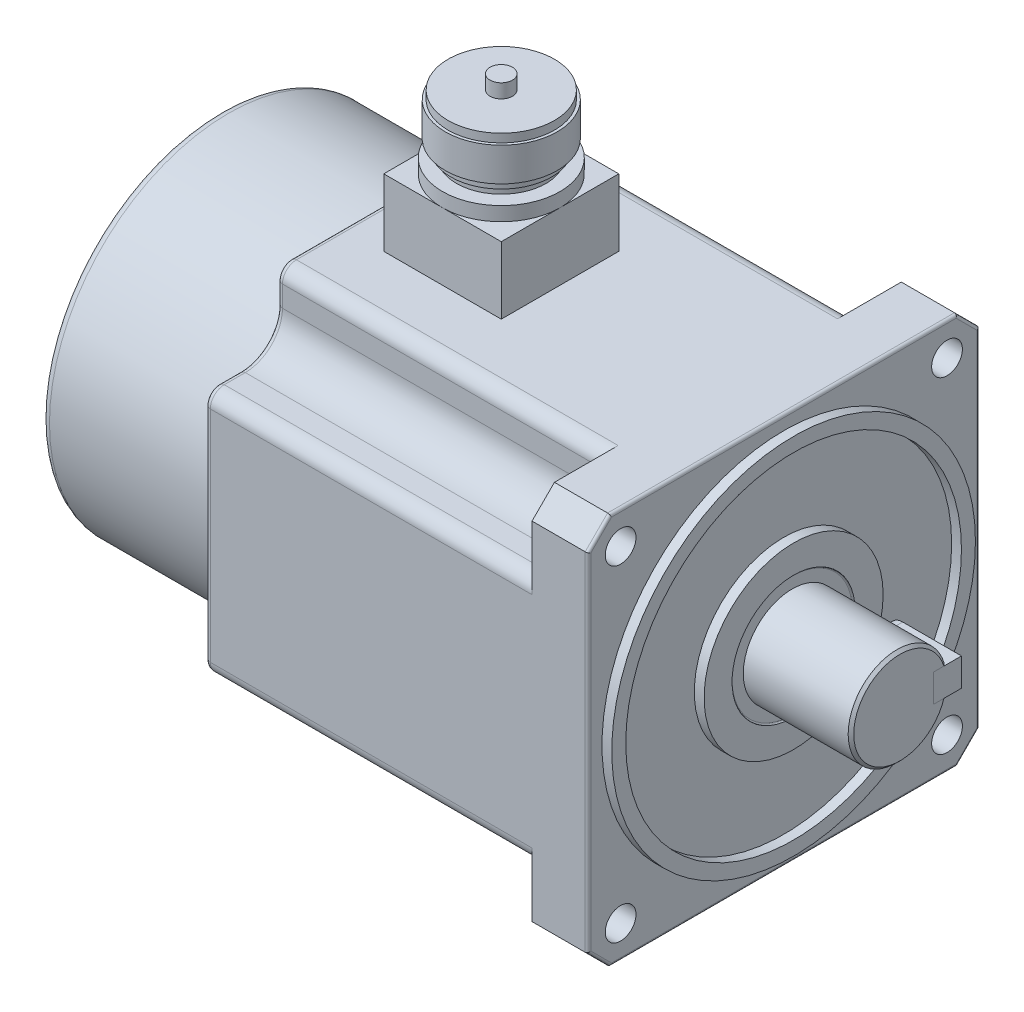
ISO-10303-21;
HEADER;
FILE_DESCRIPTION(('STEP AP214'),'2;1');
FILE_NAME('part.step','',(''),(''),'','','');
FILE_SCHEMA(('AUTOMOTIVE_DESIGN { 1 0 10303 214 1 1 1 1 }'));
ENDSEC;
DATA;
#1=APPLICATION_CONTEXT('core data for automotive mechanical design processes');
#2=APPLICATION_PROTOCOL_DEFINITION('international standard','automotive_design',2000,#1);
#3=PRODUCT_CONTEXT('',#1,'mechanical');
#4=PRODUCT('Part','Part','',(#3));
#5=PRODUCT_RELATED_PRODUCT_CATEGORY('part','',(#4));
#6=PRODUCT_DEFINITION_FORMATION('','',#4);
#7=PRODUCT_DEFINITION_CONTEXT('part definition',#1,'design');
#8=PRODUCT_DEFINITION('design','',#6,#7);
#9=PRODUCT_DEFINITION_SHAPE('','',#8);
#10=(LENGTH_UNIT() NAMED_UNIT(*) SI_UNIT(.MILLI.,.METRE.));
#11=(NAMED_UNIT(*) PLANE_ANGLE_UNIT() SI_UNIT($,.RADIAN.));
#12=(NAMED_UNIT(*) SI_UNIT($,.STERADIAN.) SOLID_ANGLE_UNIT());
#13=UNCERTAINTY_MEASURE_WITH_UNIT(LENGTH_MEASURE(1.E-05),#10,'distance_accuracy_value','');
#14=(GEOMETRIC_REPRESENTATION_CONTEXT(3) GLOBAL_UNCERTAINTY_ASSIGNED_CONTEXT((#13)) GLOBAL_UNIT_ASSIGNED_CONTEXT((#10,
#11,#12)) REPRESENTATION_CONTEXT('',''));
#15=CARTESIAN_POINT('',(0.,0.,0.));
#16=DIRECTION('',(0.,0.,1.));
#17=DIRECTION('',(1.,0.,0.));
#18=AXIS2_PLACEMENT_3D('',#15,#16,#17);
#19=CARTESIAN_POINT('',(20.5,0.,-22.));
#20=DIRECTION('',(0.,0.,1.));
#21=DIRECTION('',(1.,0.,0.));
#22=AXIS2_PLACEMENT_3D('',#19,#20,#21);
#23=CYLINDRICAL_SURFACE('',#22,5.);
#24=CARTESIAN_POINT('',(20.5,0.,-12.));
#25=DIRECTION('',(0.,0.,-1.));
#26=DIRECTION('',(-1.,0.,0.));
#27=AXIS2_PLACEMENT_3D('',#24,#25,#26);
#28=CIRCLE('',#27,5.);
#29=CARTESIAN_POINT('',(20.5,-5.,-12.));
#30=VERTEX_POINT('',#29);
#31=CARTESIAN_POINT('',(20.5,5.,-12.));
#32=VERTEX_POINT('',#31);
#33=EDGE_CURVE('E108',#30,#32,#28,.T.);
#34=ORIENTED_EDGE('',*,*,#33,.T.);
#35=DIRECTION('',(0.,0.,1.));
#36=VECTOR('',#35,1.);
#37=CARTESIAN_POINT('',(20.5,5.,-22.));
#38=LINE('',#37,#36);
#39=CARTESIAN_POINT('',(20.5,5.,-22.));
#40=VERTEX_POINT('',#39);
#41=EDGE_CURVE('E12',#40,#32,#38,.T.);
#42=ORIENTED_EDGE('',*,*,#41,.F.);
#43=CARTESIAN_POINT('',(20.5,0.,-22.));
#44=DIRECTION('',(0.,0.,-1.));
#45=DIRECTION('',(-1.,0.,0.));
#46=AXIS2_PLACEMENT_3D('',#43,#44,#45);
#47=CIRCLE('',#46,5.);
#48=CARTESIAN_POINT('',(20.5,-5.,-22.));
#49=VERTEX_POINT('',#48);
#50=EDGE_CURVE('E96',#49,#40,#47,.T.);
#51=ORIENTED_EDGE('',*,*,#50,.F.);
#52=DIRECTION('',(0.,0.,1.));
#53=VECTOR('',#52,1.);
#54=CARTESIAN_POINT('',(20.5,-5.,-22.));
#55=LINE('',#54,#53);
#56=EDGE_CURVE('E104',#49,#30,#55,.T.);
#57=ORIENTED_EDGE('',*,*,#56,.T.);
#58=EDGE_LOOP('',(#34,#42,#51,#57));
#59=FACE_BOUND('',#58,.T.);
#60=ADVANCED_FACE('F45',(#59),#23,.T.);
#61=CARTESIAN_POINT('',(20.5,5.,-22.));
#62=DIRECTION('',(0.,-1.,0.));
#63=DIRECTION('',(0.,0.,-1.));
#64=AXIS2_PLACEMENT_3D('',#61,#62,#63);
#65=PLANE('',#64);
#66=DIRECTION('',(1.,0.,0.));
#67=VECTOR('',#66,1.);
#68=CARTESIAN_POINT('',(20.5,5.,-12.));
#69=LINE('',#68,#67);
#70=CARTESIAN_POINT('',(41.5,5.,-12.));
#71=VERTEX_POINT('',#70);
#72=EDGE_CURVE('E100',#32,#71,#69,.T.);
#73=ORIENTED_EDGE('',*,*,#72,.T.);
#74=DIRECTION('',(0.,0.,1.));
#75=VECTOR('',#74,1.);
#76=CARTESIAN_POINT('',(41.5,5.,-22.));
#77=LINE('',#76,#75);
#78=CARTESIAN_POINT('',(41.5,5.,-22.));
#79=VERTEX_POINT('',#78);
#80=EDGE_CURVE('E53',#79,#71,#77,.T.);
#81=ORIENTED_EDGE('',*,*,#80,.F.);
#82=DIRECTION('',(1.,0.,0.));
#83=VECTOR('',#82,1.);
#84=CARTESIAN_POINT('',(20.5,5.,-22.));
#85=LINE('',#84,#83);
#86=EDGE_CURVE('E91',#40,#79,#85,.T.);
#87=ORIENTED_EDGE('',*,*,#86,.F.);
#88=ORIENTED_EDGE('',*,*,#41,.T.);
#89=EDGE_LOOP('',(#73,#81,#87,#88));
#90=FACE_BOUND('',#89,.T.);
#91=ADVANCED_FACE('F99',(#90),#65,.F.);
#92=CARTESIAN_POINT('',(41.5,5.,-22.));
#93=DIRECTION('',(-1.,0.,0.));
#94=DIRECTION('',(0.,0.,1.));
#95=AXIS2_PLACEMENT_3D('',#92,#93,#94);
#96=PLANE('',#95);
#97=DIRECTION('',(0.,-1.,0.));
#98=VECTOR('',#97,1.);
#99=CARTESIAN_POINT('',(41.5,5.,-12.));
#100=LINE('',#99,#98);
#101=CARTESIAN_POINT('',(41.5,-5.,-12.));
#102=VERTEX_POINT('',#101);
#103=EDGE_CURVE('E78',#71,#102,#100,.T.);
#104=ORIENTED_EDGE('',*,*,#103,.T.);
#105=DIRECTION('',(0.,0.,1.));
#106=VECTOR('',#105,1.);
#107=CARTESIAN_POINT('',(41.5,-5.,-22.));
#108=LINE('',#107,#106);
#109=CARTESIAN_POINT('',(41.5,-5.,-22.));
#110=VERTEX_POINT('',#109);
#111=EDGE_CURVE('E101',#110,#102,#108,.T.);
#112=ORIENTED_EDGE('',*,*,#111,.F.);
#113=DIRECTION('',(0.,-1.,0.));
#114=VECTOR('',#113,1.);
#115=CARTESIAN_POINT('',(41.5,5.,-22.));
#116=LINE('',#115,#114);
#117=EDGE_CURVE('E94',#79,#110,#116,.T.);
#118=ORIENTED_EDGE('',*,*,#117,.F.);
#119=ORIENTED_EDGE('',*,*,#80,.T.);
#120=EDGE_LOOP('',(#104,#112,#118,#119));
#121=FACE_BOUND('',#120,.T.);
#122=ADVANCED_FACE('F102',(#121),#96,.F.);
#123=CARTESIAN_POINT('',(41.5,-5.,-22.));
#124=DIRECTION('',(0.,1.,0.));
#125=DIRECTION('',(0.,0.,1.));
#126=AXIS2_PLACEMENT_3D('',#123,#124,#125);
#127=PLANE('',#126);
#128=DIRECTION('',(-1.,0.,0.));
#129=VECTOR('',#128,1.);
#130=CARTESIAN_POINT('',(41.5,-5.,-12.));
#131=LINE('',#130,#129);
#132=EDGE_CURVE('E84',#102,#30,#131,.T.);
#133=ORIENTED_EDGE('',*,*,#132,.T.);
#134=ORIENTED_EDGE('',*,*,#56,.F.);
#135=DIRECTION('',(-1.,0.,0.));
#136=VECTOR('',#135,1.);
#137=CARTESIAN_POINT('',(41.5,-5.,-22.));
#138=LINE('',#137,#136);
#139=EDGE_CURVE('E61',#110,#49,#138,.T.);
#140=ORIENTED_EDGE('',*,*,#139,.F.);
#141=ORIENTED_EDGE('',*,*,#111,.T.);
#142=EDGE_LOOP('',(#133,#134,#140,#141));
#143=FACE_BOUND('',#142,.T.);
#144=ADVANCED_FACE('F115',(#143),#127,.F.);
#145=CARTESIAN_POINT('',(20.5,0.,-22.));
#146=DIRECTION('',(0.,0.,-1.));
#147=DIRECTION('',(-1.,0.,0.));
#148=AXIS2_PLACEMENT_3D('',#145,#146,#147);
#149=PLANE('',#148);
#150=ORIENTED_EDGE('',*,*,#50,.T.);
#151=ORIENTED_EDGE('',*,*,#86,.T.);
#152=ORIENTED_EDGE('',*,*,#117,.T.);
#153=ORIENTED_EDGE('',*,*,#139,.T.);
#154=EDGE_LOOP('',(#150,#151,#152,#153));
#155=FACE_BOUND('',#154,.T.);
#156=ADVANCED_FACE('F92',(#155),#149,.T.);
#157=CARTESIAN_POINT('',(20.5,0.,-12.));
#158=DIRECTION('',(0.,0.,-1.));
#159=DIRECTION('',(-1.,0.,0.));
#160=AXIS2_PLACEMENT_3D('',#157,#158,#159);
#161=PLANE('',#160);
#162=ORIENTED_EDGE('',*,*,#33,.F.);
#163=ORIENTED_EDGE('',*,*,#132,.F.);
#164=ORIENTED_EDGE('',*,*,#103,.F.);
#165=ORIENTED_EDGE('',*,*,#72,.F.);
#166=EDGE_LOOP('',(#162,#163,#164,#165));
#167=FACE_BOUND('',#166,.T.);
#168=ADVANCED_FACE('F118',(#167),#161,.F.);
#169=CLOSED_SHELL('',(#60,#91,#122,#144,#156,#168));
#170=MANIFOLD_SOLID_BREP('B2',#169);
#171=CARTESIAN_POINT('',(-101.,120.,0.));
#172=DIRECTION('',(0.,1.,0.));
#173=DIRECTION('',(0.,0.,1.));
#174=AXIS2_PLACEMENT_3D('',#171,#172,#173);
#175=PLANE('',#174);
#176=CARTESIAN_POINT('',(-101.,120.,0.));
#177=DIRECTION('',(0.,1.,0.));
#178=DIRECTION('',(0.,0.,1.));
#179=AXIS2_PLACEMENT_3D('',#176,#177,#178);
#180=CIRCLE('',#179,19.);
#181=CARTESIAN_POINT('',(-101.,120.,19.));
#182=VERTEX_POINT('',#181);
#183=EDGE_CURVE('E2385',#182,#182,#180,.T.);
#184=ORIENTED_EDGE('',*,*,#183,.T.);
#185=EDGE_LOOP('',(#184));
#186=FACE_BOUND('',#185,.T.);
#187=CARTESIAN_POINT('',(-101.,120.,0.));
#188=DIRECTION('',(0.,1.,0.));
#189=DIRECTION('',(0.,0.,1.));
#190=AXIS2_PLACEMENT_3D('',#187,#188,#189);
#191=CIRCLE('',#190,4.00000000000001);
#192=CARTESIAN_POINT('',(-101.,120.,4.00000000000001));
#193=VERTEX_POINT('',#192);
#194=EDGE_CURVE('E2382',#193,#193,#191,.T.);
#195=ORIENTED_EDGE('',*,*,#194,.F.);
#196=EDGE_LOOP('',(#195));
#197=FACE_BOUND('',#196,.T.);
#198=ADVANCED_FACE('F169',(#186,#197),#175,.T.);
#199=CARTESIAN_POINT('',(-101.,117.,0.));
#200=DIRECTION('',(0.,1.,0.));
#201=DIRECTION('',(0.,0.,1.));
#202=AXIS2_PLACEMENT_3D('',#199,#200,#201);
#203=PLANE('',#202);
#204=CARTESIAN_POINT('',(-101.,117.,0.));
#205=DIRECTION('',(0.,1.,0.));
#206=DIRECTION('',(0.,0.,1.));
#207=AXIS2_PLACEMENT_3D('',#204,#205,#206);
#208=CIRCLE('',#207,20.);
#209=CARTESIAN_POINT('',(-101.,117.,20.));
#210=VERTEX_POINT('',#209);
#211=EDGE_CURVE('E2392',#210,#210,#208,.T.);
#212=ORIENTED_EDGE('',*,*,#211,.T.);
#213=EDGE_LOOP('',(#212));
#214=FACE_BOUND('',#213,.T.);
#215=CARTESIAN_POINT('',(-101.,117.,0.));
#216=DIRECTION('',(0.,1.,0.));
#217=DIRECTION('',(0.,0.,1.));
#218=AXIS2_PLACEMENT_3D('',#215,#216,#217);
#219=CIRCLE('',#218,19.);
#220=CARTESIAN_POINT('',(-101.,117.,19.));
#221=VERTEX_POINT('',#220);
#222=EDGE_CURVE('E2381',#221,#221,#219,.T.);
#223=ORIENTED_EDGE('',*,*,#222,.F.);
#224=EDGE_LOOP('',(#223));
#225=FACE_BOUND('',#224,.T.);
#226=ADVANCED_FACE('F1119',(#214,#225),#203,.T.);
#227=CARTESIAN_POINT('',(-101.,99.,0.));
#228=DIRECTION('',(0.,1.,0.));
#229=DIRECTION('',(0.,0.,1.));
#230=AXIS2_PLACEMENT_3D('',#227,#228,#229);
#231=PLANE('',#230);
#232=CARTESIAN_POINT('',(-101.,99.,0.));
#233=DIRECTION('',(0.,1.,0.));
#234=DIRECTION('',(0.,0.,1.));
#235=AXIS2_PLACEMENT_3D('',#232,#233,#234);
#236=CIRCLE('',#235,21.);
#237=CARTESIAN_POINT('',(-101.,99.,21.));
#238=VERTEX_POINT('',#237);
#239=EDGE_CURVE('E567',#238,#238,#236,.T.);
#240=ORIENTED_EDGE('',*,*,#239,.T.);
#241=EDGE_LOOP('',(#240));
#242=FACE_BOUND('',#241,.T.);
#243=CARTESIAN_POINT('',(-101.,99.,0.));
#244=DIRECTION('',(0.,1.,0.));
#245=DIRECTION('',(0.,0.,1.));
#246=AXIS2_PLACEMENT_3D('',#243,#244,#245);
#247=CIRCLE('',#246,16.);
#248=CARTESIAN_POINT('',(-101.,99.,16.));
#249=VERTEX_POINT('',#248);
#250=EDGE_CURVE('E2401',#249,#249,#247,.T.);
#251=ORIENTED_EDGE('',*,*,#250,.F.);
#252=EDGE_LOOP('',(#251));
#253=FACE_BOUND('',#252,.T.);
#254=ADVANCED_FACE('F1125',(#242,#253),#231,.T.);
#255=CARTESIAN_POINT('',(0.,94.,0.));
#256=DIRECTION('',(0.,-1.,0.));
#257=DIRECTION('',(0.,0.,-1.));
#258=AXIS2_PLACEMENT_3D('',#255,#256,#257);
#259=PLANE('',#258);
#260=CARTESIAN_POINT('',(-101.,94.,0.));
#261=DIRECTION('',(0.,1.,0.));
#262=DIRECTION('',(0.,0.,1.));
#263=AXIS2_PLACEMENT_3D('',#260,#261,#262);
#264=CIRCLE('',#263,21.);
#265=CARTESIAN_POINT('',(-101.,94.,21.));
#266=VERTEX_POINT('',#265);
#267=CARTESIAN_POINT('',(-80.,94.,0.));
#268=VERTEX_POINT('',#267);
#269=EDGE_CURVE('E185',#266,#268,#264,.T.);
#270=ORIENTED_EDGE('',*,*,#269,.F.);
#271=DIRECTION('',(1.,0.,0.));
#272=VECTOR('',#271,1.);
#273=CARTESIAN_POINT('',(-122.,94.,21.));
#274=LINE('',#273,#272);
#275=CARTESIAN_POINT('',(-80.,94.,21.));
#276=VERTEX_POINT('',#275);
#277=EDGE_CURVE('E553',#266,#276,#274,.T.);
#278=ORIENTED_EDGE('',*,*,#277,.T.);
#279=DIRECTION('',(0.,0.,-1.));
#280=VECTOR('',#279,1.);
#281=CARTESIAN_POINT('',(-80.,94.,21.));
#282=LINE('',#281,#280);
#283=EDGE_CURVE('E565',#276,#268,#282,.T.);
#284=ORIENTED_EDGE('',*,*,#283,.T.);
#285=EDGE_LOOP('',(#270,#278,#284));
#286=FACE_BOUND('',#285,.T.);
#287=ADVANCED_FACE('F564',(#286),#259,.F.);
#288=CARTESIAN_POINT('',(-101.,94.,-21.));
#289=VERTEX_POINT('',#288);
#290=EDGE_CURVE('E43',#268,#289,#264,.T.);
#291=ORIENTED_EDGE('',*,*,#290,.F.);
#292=CARTESIAN_POINT('',(-80.,94.,-21.));
#293=VERTEX_POINT('',#292);
#294=EDGE_CURVE('E576',#268,#293,#282,.T.);
#295=ORIENTED_EDGE('',*,*,#294,.T.);
#296=DIRECTION('',(-1.,0.,0.));
#297=VECTOR('',#296,1.);
#298=CARTESIAN_POINT('',(-122.,94.,-21.));
#299=LINE('',#298,#297);
#300=EDGE_CURVE('E577',#293,#289,#299,.T.);
#301=ORIENTED_EDGE('',*,*,#300,.T.);
#302=EDGE_LOOP('',(#291,#295,#301));
#303=FACE_BOUND('',#302,.T.);
#304=ADVANCED_FACE('F1166',(#303),#259,.F.);
#305=CARTESIAN_POINT('',(-122.,94.,0.));
#306=VERTEX_POINT('',#305);
#307=EDGE_CURVE('E183',#289,#306,#264,.T.);
#308=ORIENTED_EDGE('',*,*,#307,.F.);
#309=CARTESIAN_POINT('',(-122.,94.,-21.));
#310=VERTEX_POINT('',#309);
#311=EDGE_CURVE('E575',#289,#310,#299,.T.);
#312=ORIENTED_EDGE('',*,*,#311,.T.);
#313=DIRECTION('',(0.,0.,1.));
#314=VECTOR('',#313,1.);
#315=CARTESIAN_POINT('',(-122.,94.,21.));
#316=LINE('',#315,#314);
#317=EDGE_CURVE('E562',#310,#306,#316,.T.);
#318=ORIENTED_EDGE('',*,*,#317,.T.);
#319=EDGE_LOOP('',(#308,#312,#318));
#320=FACE_BOUND('',#319,.T.);
#321=ADVANCED_FACE('F1524',(#320),#259,.F.);
#322=EDGE_CURVE('E192',#306,#266,#264,.T.);
#323=ORIENTED_EDGE('',*,*,#322,.F.);
#324=CARTESIAN_POINT('',(-122.,94.,21.));
#325=VERTEX_POINT('',#324);
#326=EDGE_CURVE('E549',#306,#325,#316,.T.);
#327=ORIENTED_EDGE('',*,*,#326,.T.);
#328=EDGE_CURVE('E546',#325,#266,#274,.T.);
#329=ORIENTED_EDGE('',*,*,#328,.T.);
#330=EDGE_LOOP('',(#323,#327,#329));
#331=FACE_BOUND('',#330,.T.);
#332=ADVANCED_FACE('F548',(#331),#259,.F.);
#333=CARTESIAN_POINT('',(-137.,70.,62.));
#334=DIRECTION('',(0.,1.,0.));
#335=DIRECTION('',(0.,0.,1.));
#336=AXIS2_PLACEMENT_3D('',#333,#334,#335);
#337=PLANE('',#336);
#338=DIRECTION('',(1.,0.,0.));
#339=VECTOR('',#338,1.);
#340=CARTESIAN_POINT('',(-137.,70.,62.));
#341=LINE('',#340,#339);
#342=CARTESIAN_POINT('',(-20.,70.,62.));
#343=VERTEX_POINT('',#342);
#344=CARTESIAN_POINT('',(-1.,70.,62.));
#345=VERTEX_POINT('',#344);
#346=EDGE_CURVE('E819',#343,#345,#341,.T.);
#347=ORIENTED_EDGE('',*,*,#346,.T.);
#348=DIRECTION('',(0.,0.,1.));
#349=VECTOR('',#348,1.);
#350=CARTESIAN_POINT('',(-1.,70.,62.));
#351=LINE('',#350,#349);
#352=CARTESIAN_POINT('',(-1.,70.,-62.));
#353=VERTEX_POINT('',#352);
#354=EDGE_CURVE('E1057',#345,#353,#351,.F.);
#355=ORIENTED_EDGE('',*,*,#354,.T.);
#356=DIRECTION('',(1.,0.,0.));
#357=VECTOR('',#356,1.);
#358=CARTESIAN_POINT('',(-137.,70.,-62.));
#359=LINE('',#358,#357);
#360=CARTESIAN_POINT('',(-20.,70.,-62.));
#361=VERTEX_POINT('',#360);
#362=EDGE_CURVE('E834',#361,#353,#359,.T.);
#363=ORIENTED_EDGE('',*,*,#362,.F.);
#364=DIRECTION('',(0.,0.,-1.));
#365=VECTOR('',#364,1.);
#366=CARTESIAN_POINT('',(-20.,70.,-62.));
#367=LINE('',#366,#365);
#368=CARTESIAN_POINT('',(-20.,70.,-39.2146697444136));
#369=VERTEX_POINT('',#368);
#370=EDGE_CURVE('E808',#369,#361,#367,.T.);
#371=ORIENTED_EDGE('',*,*,#370,.F.);
#372=DIRECTION('',(-1.,0.,0.));
#373=VECTOR('',#372,1.);
#374=CARTESIAN_POINT('',(-20.,70.,-39.2146697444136));
#375=LINE('',#374,#373);
#376=CARTESIAN_POINT('',(-135.,70.,-39.2146697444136));
#377=VERTEX_POINT('',#376);
#378=EDGE_CURVE('E820',#369,#377,#375,.T.);
#379=ORIENTED_EDGE('',*,*,#378,.T.);
#380=DIRECTION('',(0.,0.,1.));
#381=VECTOR('',#380,1.);
#382=CARTESIAN_POINT('',(-135.,70.,39.2146697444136));
#383=LINE('',#382,#381);
#384=CARTESIAN_POINT('',(-135.,70.,39.2146697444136));
#385=VERTEX_POINT('',#384);
#386=EDGE_CURVE('E949',#377,#385,#383,.T.);
#387=ORIENTED_EDGE('',*,*,#386,.T.);
#388=DIRECTION('',(-1.,0.,0.));
#389=VECTOR('',#388,1.);
#390=CARTESIAN_POINT('',(-20.,70.,39.2146697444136));
#391=LINE('',#390,#389);
#392=CARTESIAN_POINT('',(-20.,70.,39.2146697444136));
#393=VERTEX_POINT('',#392);
#394=EDGE_CURVE('E703',#393,#385,#391,.T.);
#395=ORIENTED_EDGE('',*,*,#394,.F.);
#396=DIRECTION('',(0.,0.,-1.));
#397=VECTOR('',#396,1.);
#398=CARTESIAN_POINT('',(-20.,70.,39.2146697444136));
#399=LINE('',#398,#397);
#400=EDGE_CURVE('E686',#343,#393,#399,.T.);
#401=ORIENTED_EDGE('',*,*,#400,.F.);
#402=EDGE_LOOP('',(#347,#355,#363,#371,#379,#387,#395,#401));
#403=FACE_BOUND('',#402,.T.);
#404=DIRECTION('',(-1.,0.,0.));
#405=VECTOR('',#404,1.);
#406=CARTESIAN_POINT('',(-122.,70.,-21.));
#407=LINE('',#406,#405);
#408=CARTESIAN_POINT('',(-80.,70.,-21.));
#409=VERTEX_POINT('',#408);
#410=CARTESIAN_POINT('',(-122.,70.,-21.));
#411=VERTEX_POINT('',#410);
#412=EDGE_CURVE('E584',#409,#411,#407,.T.);
#413=ORIENTED_EDGE('',*,*,#412,.F.);
#414=DIRECTION('',(0.,0.,-1.));
#415=VECTOR('',#414,1.);
#416=CARTESIAN_POINT('',(-80.,70.,21.));
#417=LINE('',#416,#415);
#418=CARTESIAN_POINT('',(-80.,70.,21.));
#419=VERTEX_POINT('',#418);
#420=EDGE_CURVE('E581',#419,#409,#417,.T.);
#421=ORIENTED_EDGE('',*,*,#420,.F.);
#422=DIRECTION('',(1.,0.,0.));
#423=VECTOR('',#422,1.);
#424=CARTESIAN_POINT('',(-122.,70.,21.));
#425=LINE('',#424,#423);
#426=CARTESIAN_POINT('',(-122.,70.,21.));
#427=VERTEX_POINT('',#426);
#428=EDGE_CURVE('E589',#427,#419,#425,.T.);
#429=ORIENTED_EDGE('',*,*,#428,.F.);
#430=DIRECTION('',(0.,0.,1.));
#431=VECTOR('',#430,1.);
#432=CARTESIAN_POINT('',(-122.,70.,21.));
#433=LINE('',#432,#431);
#434=EDGE_CURVE('E586',#411,#427,#433,.T.);
#435=ORIENTED_EDGE('',*,*,#434,.F.);
#436=EDGE_LOOP('',(#413,#421,#429,#435));
#437=FACE_BOUND('',#436,.T.);
#438=ADVANCED_FACE('F1234',(#403,#437),#337,.T.);
#439=CARTESIAN_POINT('',(-137.,0.,0.));
#440=DIRECTION('',(1.,0.,0.));
#441=DIRECTION('',(0.,0.,-1.));
#442=AXIS2_PLACEMENT_3D('',#439,#440,#441);
#443=PLANE('',#442);
#444=DIRECTION('',(0.,0.,1.));
#445=VECTOR('',#444,1.);
#446=CARTESIAN_POINT('',(-137.,42.2146697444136,0.));
#447=LINE('',#446,#445);
#448=CARTESIAN_POINT('',(-137.,42.2146697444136,65.));
#449=VERTEX_POINT('',#448);
#450=CARTESIAN_POINT('',(-137.,42.2146697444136,57.5));
#451=VERTEX_POINT('',#450);
#452=EDGE_CURVE('E904',#449,#451,#447,.F.);
#453=ORIENTED_EDGE('',*,*,#452,.T.);
#454=CARTESIAN_POINT('',(-137.,57.5,57.5));
#455=DIRECTION('',(1.,0.,0.));
#456=DIRECTION('',(0.,0.,-1.));
#457=AXIS2_PLACEMENT_3D('',#454,#455,#456);
#458=CIRCLE('',#457,15.2853302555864);
#459=CARTESIAN_POINT('',(-137.,57.5,42.2146697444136));
#460=VERTEX_POINT('',#459);
#461=EDGE_CURVE('E906',#451,#460,#458,.T.);
#462=ORIENTED_EDGE('',*,*,#461,.T.);
#463=DIRECTION('',(0.,-1.,0.));
#464=VECTOR('',#463,1.);
#465=CARTESIAN_POINT('',(-137.,0.,42.2146697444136));
#466=LINE('',#465,#464);
#467=CARTESIAN_POINT('',(-137.,65.,42.2146697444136));
#468=VERTEX_POINT('',#467);
#469=EDGE_CURVE('E860',#460,#468,#466,.F.);
#470=ORIENTED_EDGE('',*,*,#469,.T.);
#471=CARTESIAN_POINT('',(-137.,65.,39.2146697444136));
#472=DIRECTION('',(1.,0.,0.));
#473=DIRECTION('',(0.,0.,-1.));
#474=AXIS2_PLACEMENT_3D('',#471,#472,#473);
#475=CIRCLE('',#474,3.);
#476=CARTESIAN_POINT('',(-137.,68.,39.2146697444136));
#477=VERTEX_POINT('',#476);
#478=EDGE_CURVE('E862',#468,#477,#475,.F.);
#479=ORIENTED_EDGE('',*,*,#478,.T.);
#480=DIRECTION('',(0.,0.,1.));
#481=VECTOR('',#480,1.);
#482=CARTESIAN_POINT('',(-137.,68.,-39.2146697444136));
#483=LINE('',#482,#481);
#484=CARTESIAN_POINT('',(-137.,68.,-39.2146697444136));
#485=VERTEX_POINT('',#484);
#486=EDGE_CURVE('E864',#477,#485,#483,.F.);
#487=ORIENTED_EDGE('',*,*,#486,.T.);
#488=CARTESIAN_POINT('',(-137.,65.,-39.2146697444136));
#489=DIRECTION('',(1.,0.,0.));
#490=DIRECTION('',(0.,0.,-1.));
#491=AXIS2_PLACEMENT_3D('',#488,#489,#490);
#492=CIRCLE('',#491,3.);
#493=CARTESIAN_POINT('',(-137.,64.9999999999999,-42.2146697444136));
#494=VERTEX_POINT('',#493);
#495=EDGE_CURVE('E866',#485,#494,#492,.F.);
#496=ORIENTED_EDGE('',*,*,#495,.T.);
#497=DIRECTION('',(0.,1.,0.));
#498=VECTOR('',#497,1.);
#499=CARTESIAN_POINT('',(-137.,0.,-42.2146697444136));
#500=LINE('',#499,#498);
#501=CARTESIAN_POINT('',(-137.,57.5,-42.2146697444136));
#502=VERTEX_POINT('',#501);
#503=EDGE_CURVE('E868',#494,#502,#500,.F.);
#504=ORIENTED_EDGE('',*,*,#503,.T.);
#505=CARTESIAN_POINT('',(-137.,57.5,-57.5));
#506=DIRECTION('',(1.,0.,0.));
#507=DIRECTION('',(0.,0.,-1.));
#508=AXIS2_PLACEMENT_3D('',#505,#506,#507);
#509=CIRCLE('',#508,15.2853302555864);
#510=CARTESIAN_POINT('',(-137.,42.2146697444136,-57.5));
#511=VERTEX_POINT('',#510);
#512=EDGE_CURVE('E870',#502,#511,#509,.T.);
#513=ORIENTED_EDGE('',*,*,#512,.T.);
#514=DIRECTION('',(0.,0.,1.));
#515=VECTOR('',#514,1.);
#516=CARTESIAN_POINT('',(-137.,42.2146697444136,0.));
#517=LINE('',#516,#515);
#518=CARTESIAN_POINT('',(-137.,42.2146697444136,-65.));
#519=VERTEX_POINT('',#518);
#520=EDGE_CURVE('E872',#511,#519,#517,.F.);
#521=ORIENTED_EDGE('',*,*,#520,.T.);
#522=CARTESIAN_POINT('',(-137.,39.2146697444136,-65.));
#523=DIRECTION('',(1.,0.,0.));
#524=DIRECTION('',(0.,0.,-1.));
#525=AXIS2_PLACEMENT_3D('',#522,#523,#524);
#526=CIRCLE('',#525,3.);
#527=CARTESIAN_POINT('',(-137.,39.2146697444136,-68.));
#528=VERTEX_POINT('',#527);
#529=EDGE_CURVE('E874',#519,#528,#526,.F.);
#530=ORIENTED_EDGE('',*,*,#529,.T.);
#531=DIRECTION('',(0.,1.,0.));
#532=VECTOR('',#531,1.);
#533=CARTESIAN_POINT('',(-137.,-39.2146697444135,-68.));
#534=LINE('',#533,#532);
#535=CARTESIAN_POINT('',(-137.,-39.2146697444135,-68.));
#536=VERTEX_POINT('',#535);
#537=EDGE_CURVE('E876',#528,#536,#534,.F.);
#538=ORIENTED_EDGE('',*,*,#537,.T.);
#539=CARTESIAN_POINT('',(-137.,-39.2146697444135,-65.));
#540=DIRECTION('',(1.,0.,0.));
#541=DIRECTION('',(0.,0.,-1.));
#542=AXIS2_PLACEMENT_3D('',#539,#540,#541);
#543=CIRCLE('',#542,3.);
#544=CARTESIAN_POINT('',(-137.,-42.2146697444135,-65.));
#545=VERTEX_POINT('',#544);
#546=EDGE_CURVE('E878',#536,#545,#543,.F.);
#547=ORIENTED_EDGE('',*,*,#546,.T.);
#548=DIRECTION('',(0.,0.,-1.));
#549=VECTOR('',#548,1.);
#550=CARTESIAN_POINT('',(-137.,-42.2146697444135,0.));
#551=LINE('',#550,#549);
#552=CARTESIAN_POINT('',(-137.,-42.2146697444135,-57.5));
#553=VERTEX_POINT('',#552);
#554=EDGE_CURVE('E880',#545,#553,#551,.F.);
#555=ORIENTED_EDGE('',*,*,#554,.T.);
#556=CARTESIAN_POINT('',(-137.,-57.5,-57.5));
#557=DIRECTION('',(1.,0.,0.));
#558=DIRECTION('',(0.,0.,-1.));
#559=AXIS2_PLACEMENT_3D('',#556,#557,#558);
#560=CIRCLE('',#559,15.2853302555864);
#561=CARTESIAN_POINT('',(-137.,-57.5,-42.2146697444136));
#562=VERTEX_POINT('',#561);
#563=EDGE_CURVE('E882',#553,#562,#560,.T.);
#564=ORIENTED_EDGE('',*,*,#563,.T.);
#565=DIRECTION('',(0.,1.,0.));
#566=VECTOR('',#565,1.);
#567=CARTESIAN_POINT('',(-137.,0.,-42.2146697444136));
#568=LINE('',#567,#566);
#569=CARTESIAN_POINT('',(-137.,-65.,-42.2146697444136));
#570=VERTEX_POINT('',#569);
#571=EDGE_CURVE('E884',#562,#570,#568,.F.);
#572=ORIENTED_EDGE('',*,*,#571,.T.);
#573=CARTESIAN_POINT('',(-137.,-65.,-39.2146697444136));
#574=DIRECTION('',(1.,0.,0.));
#575=DIRECTION('',(0.,0.,-1.));
#576=AXIS2_PLACEMENT_3D('',#573,#574,#575);
#577=CIRCLE('',#576,3.);
#578=CARTESIAN_POINT('',(-137.,-68.,-39.2146697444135));
#579=VERTEX_POINT('',#578);
#580=EDGE_CURVE('E886',#570,#579,#577,.F.);
#581=ORIENTED_EDGE('',*,*,#580,.T.);
#582=DIRECTION('',(0.,0.,-1.));
#583=VECTOR('',#582,1.);
#584=CARTESIAN_POINT('',(-137.,-68.,39.2146697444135));
#585=LINE('',#584,#583);
#586=CARTESIAN_POINT('',(-137.,-68.,39.2146697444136));
#587=VERTEX_POINT('',#586);
#588=EDGE_CURVE('E888',#579,#587,#585,.F.);
#589=ORIENTED_EDGE('',*,*,#588,.T.);
#590=CARTESIAN_POINT('',(-137.,-65.,39.2146697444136));
#591=DIRECTION('',(1.,0.,0.));
#592=DIRECTION('',(0.,0.,-1.));
#593=AXIS2_PLACEMENT_3D('',#590,#591,#592);
#594=CIRCLE('',#593,3.);
#595=CARTESIAN_POINT('',(-137.,-65.,42.2146697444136));
#596=VERTEX_POINT('',#595);
#597=EDGE_CURVE('E890',#587,#596,#594,.F.);
#598=ORIENTED_EDGE('',*,*,#597,.T.);
#599=DIRECTION('',(0.,-1.,0.));
#600=VECTOR('',#599,1.);
#601=CARTESIAN_POINT('',(-137.,0.,42.2146697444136));
#602=LINE('',#601,#600);
#603=CARTESIAN_POINT('',(-137.,-57.5,42.2146697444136));
#604=VERTEX_POINT('',#603);
#605=EDGE_CURVE('E892',#596,#604,#602,.F.);
#606=ORIENTED_EDGE('',*,*,#605,.T.);
#607=CARTESIAN_POINT('',(-137.,-57.5,57.5));
#608=DIRECTION('',(1.,0.,0.));
#609=DIRECTION('',(0.,0.,-1.));
#610=AXIS2_PLACEMENT_3D('',#607,#608,#609);
#611=CIRCLE('',#610,15.2853302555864);
#612=CARTESIAN_POINT('',(-137.,-42.2146697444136,57.5));
#613=VERTEX_POINT('',#612);
#614=EDGE_CURVE('E894',#604,#613,#611,.T.);
#615=ORIENTED_EDGE('',*,*,#614,.T.);
#616=DIRECTION('',(0.,0.,-1.));
#617=VECTOR('',#616,1.);
#618=CARTESIAN_POINT('',(-137.,-42.2146697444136,0.));
#619=LINE('',#618,#617);
#620=CARTESIAN_POINT('',(-137.,-42.2146697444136,65.));
#621=VERTEX_POINT('',#620);
#622=EDGE_CURVE('E896',#613,#621,#619,.F.);
#623=ORIENTED_EDGE('',*,*,#622,.T.);
#624=CARTESIAN_POINT('',(-137.,-39.2146697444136,65.));
#625=DIRECTION('',(1.,0.,0.));
#626=DIRECTION('',(0.,0.,-1.));
#627=AXIS2_PLACEMENT_3D('',#624,#625,#626);
#628=CIRCLE('',#627,3.);
#629=CARTESIAN_POINT('',(-137.,-39.2146697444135,68.));
#630=VERTEX_POINT('',#629);
#631=EDGE_CURVE('E898',#621,#630,#628,.F.);
#632=ORIENTED_EDGE('',*,*,#631,.T.);
#633=DIRECTION('',(0.,-1.,0.));
#634=VECTOR('',#633,1.);
#635=CARTESIAN_POINT('',(-137.,39.2146697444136,68.));
#636=LINE('',#635,#634);
#637=CARTESIAN_POINT('',(-137.,39.2146697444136,68.));
#638=VERTEX_POINT('',#637);
#639=EDGE_CURVE('E900',#630,#638,#636,.F.);
#640=ORIENTED_EDGE('',*,*,#639,.T.);
#641=CARTESIAN_POINT('',(-137.,39.2146697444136,65.));
#642=DIRECTION('',(1.,0.,0.));
#643=DIRECTION('',(0.,0.,-1.));
#644=AXIS2_PLACEMENT_3D('',#641,#642,#643);
#645=CIRCLE('',#644,3.);
#646=EDGE_CURVE('E902',#638,#449,#645,.F.);
#647=ORIENTED_EDGE('',*,*,#646,.T.);
#648=EDGE_LOOP('',(#453,#462,#470,#479,#487,#496,#504,#513,#521,#530,#538,#547,#555,#564,#572,
#581,#589,#598,#606,#615,#623,#632,#640,#647));
#649=FACE_BOUND('',#648,.T.);
#650=CARTESIAN_POINT('',(-137.,0.,0.));
#651=DIRECTION('',(1.,0.,0.));
#652=DIRECTION('',(0.,0.,-1.));
#653=AXIS2_PLACEMENT_3D('',#650,#651,#652);
#654=CIRCLE('',#653,64.);
#655=CARTESIAN_POINT('',(-137.,0.,-64.));
#656=VERTEX_POINT('',#655);
#657=EDGE_CURVE('E1092',#656,#656,#654,.F.);
#658=ORIENTED_EDGE('',*,*,#657,.F.);
#659=EDGE_LOOP('',(#658));
#660=FACE_BOUND('',#659,.T.);
#661=ADVANCED_FACE('F1116',(#649,#660),#443,.F.);
#662=CARTESIAN_POINT('',(41.5,0.,0.));
#663=DIRECTION('',(-1.,0.,0.));
#664=DIRECTION('',(0.,0.,1.));
#665=AXIS2_PLACEMENT_3D('',#662,#663,#664);
#666=CYLINDRICAL_SURFACE('',#665,17.5);
#667=CARTESIAN_POINT('',(3.,0.,0.));
#668=DIRECTION('',(1.,0.,0.));
#669=DIRECTION('',(0.,0.,-1.));
#670=AXIS2_PLACEMENT_3D('',#667,#668,#669);
#671=CIRCLE('',#670,17.5);
#672=CARTESIAN_POINT('',(3.,0.,-17.5));
#673=VERTEX_POINT('',#672);
#674=EDGE_CURVE('E626',#673,#673,#671,.T.);
#675=ORIENTED_EDGE('',*,*,#674,.T.);
#676=EDGE_LOOP('',(#675));
#677=FACE_BOUND('',#676,.T.);
#678=DIRECTION('',(-1.,0.,0.));
#679=VECTOR('',#678,1.);
#680=CARTESIAN_POINT('',(41.5,-5.,-16.7705098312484));
#681=LINE('',#680,#679);
#682=CARTESIAN_POINT('',(40.5,-5.,-16.7705098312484));
#683=VERTEX_POINT('',#682);
#684=CARTESIAN_POINT('',(20.5,-5.,-16.7705098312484));
#685=VERTEX_POINT('',#684);
#686=EDGE_CURVE('E624',#683,#685,#681,.T.);
#687=ORIENTED_EDGE('',*,*,#686,.F.);
#688=CARTESIAN_POINT('',(40.5,0.,0.));
#689=DIRECTION('',(1.,0.,0.));
#690=DIRECTION('',(0.,0.,-1.));
#691=AXIS2_PLACEMENT_3D('',#688,#689,#690);
#692=CIRCLE('',#691,17.5);
#693=CARTESIAN_POINT('',(40.5,5.,-16.7705098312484));
#694=VERTEX_POINT('',#693);
#695=EDGE_CURVE('E570',#683,#694,#692,.F.);
#696=ORIENTED_EDGE('',*,*,#695,.T.);
#697=DIRECTION('',(-1.,0.,0.));
#698=VECTOR('',#697,1.);
#699=CARTESIAN_POINT('',(41.5,5.,-16.7705098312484));
#700=LINE('',#699,#698);
#701=CARTESIAN_POINT('',(20.5,5.,-16.7705098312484));
#702=VERTEX_POINT('',#701);
#703=EDGE_CURVE('E621',#702,#694,#700,.F.);
#704=ORIENTED_EDGE('',*,*,#703,.F.);
#705=CARTESIAN_POINT('',(20.5,-5.,-16.7705098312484));
#706=CARTESIAN_POINT('',(20.3624562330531,-5.00001814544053,-16.7704912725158));
#707=CARTESIAN_POINT('',(20.2249193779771,-4.99432529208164,-16.7722013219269));
#708=CARTESIAN_POINT('',(19.9508888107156,-4.97165222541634,-16.7789431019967));
#709=CARTESIAN_POINT('',(19.8143948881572,-4.95467435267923,-16.7839741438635));
#710=CARTESIAN_POINT('',(19.5437415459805,-4.90961903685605,-16.7972068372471));
#711=CARTESIAN_POINT('',(19.4095773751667,-4.88156789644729,-16.8054009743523));
#712=CARTESIAN_POINT('',(19.1442003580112,-4.81461674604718,-16.8247046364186));
#713=CARTESIAN_POINT('',(19.012987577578,-4.77571649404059,-16.8358142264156));
#714=CARTESIAN_POINT('',(18.7544683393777,-4.68740449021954,-16.8606149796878));
#715=CARTESIAN_POINT('',(18.6271599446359,-4.63799805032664,-16.874304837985));
#716=CARTESIAN_POINT('',(18.3772006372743,-4.52905522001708,-16.9038705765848));
#717=CARTESIAN_POINT('',(18.2545514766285,-4.46951506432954,-16.9197472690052));
#718=CARTESIAN_POINT('',(17.894791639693,-4.27631278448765,-16.9699997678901));
#719=CARTESIAN_POINT('',(17.6657016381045,-4.12801150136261,-17.007014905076));
#720=CARTESIAN_POINT('',(17.2294860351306,-3.79229915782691,-17.0850471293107));
#721=CARTESIAN_POINT('',(17.023079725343,-3.60397767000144,-17.1261428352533));
#722=CARTESIAN_POINT('',(16.6442623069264,-3.19544341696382,-17.2070462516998));
#723=CARTESIAN_POINT('',(16.471856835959,-2.97522537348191,-17.2468537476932));
#724=CARTESIAN_POINT('',(16.1629219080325,-2.5041085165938,-17.3215844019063));
#725=CARTESIAN_POINT('',(16.0271190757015,-2.25271539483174,-17.3564029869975));
#726=CARTESIAN_POINT('',(15.7999922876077,-1.72950937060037,-17.4163145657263));
#727=CARTESIAN_POINT('',(15.7086576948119,-1.45770136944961,-17.4414098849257));
#728=CARTESIAN_POINT('',(15.5754142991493,-0.908899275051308,-17.4784878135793));
#729=CARTESIAN_POINT('',(15.5322781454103,-0.632225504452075,-17.4907954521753));
#730=CARTESIAN_POINT('',(15.4927833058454,-0.0753060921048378,-17.5020523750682));
#731=CARTESIAN_POINT('',(15.4964166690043,0.204938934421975,-17.5010039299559));
#732=CARTESIAN_POINT('',(15.5495154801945,0.752451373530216,-17.4859002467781));
#733=CARTESIAN_POINT('',(15.5976523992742,1.0198597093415,-17.4722220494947));
#734=CARTESIAN_POINT('',(15.7362408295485,1.54263514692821,-17.4338464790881));
#735=CARTESIAN_POINT('',(15.8266944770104,1.79800164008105,-17.4091485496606));
#736=CARTESIAN_POINT('',(16.0482663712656,2.29267928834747,-17.3509771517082));
#737=CARTESIAN_POINT('',(16.1798189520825,2.53178407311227,-17.3174105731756));
#738=CARTESIAN_POINT('',(16.4796443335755,2.98504901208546,-17.2450626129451));
#739=CARTESIAN_POINT('',(16.6479245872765,3.19920408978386,-17.2062801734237));
#740=CARTESIAN_POINT('',(16.9276273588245,3.50113424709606,-17.1465202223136));
#741=CARTESIAN_POINT('',(17.0273638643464,3.60007423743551,-17.1259700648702));
#742=CARTESIAN_POINT('',(17.2348202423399,3.78923134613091,-17.0851123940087));
#743=CARTESIAN_POINT('',(17.3425373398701,3.87945147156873,-17.0648047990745));
#744=CARTESIAN_POINT('',(17.5653450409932,4.05062437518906,-17.0249868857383));
#745=CARTESIAN_POINT('',(17.6804405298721,4.13157091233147,-17.005477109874));
#746=CARTESIAN_POINT('',(17.917160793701,4.28353981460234,-16.9678346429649));
#747=CARTESIAN_POINT('',(18.0387830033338,4.35456603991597,-16.9497014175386));
#748=CARTESIAN_POINT('',(18.2889159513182,4.48679157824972,-16.9151829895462));
#749=CARTESIAN_POINT('',(18.4174786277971,4.54789718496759,-16.898814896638));
#750=CARTESIAN_POINT('',(18.67954149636,4.65898872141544,-16.8685251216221));
#751=CARTESIAN_POINT('',(18.8130396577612,4.70897916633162,-16.8546024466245));
#752=CARTESIAN_POINT('',(19.0839210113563,4.79739484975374,-16.829649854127));
#753=CARTESIAN_POINT('',(19.2212999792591,4.83583217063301,-16.8186169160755));
#754=CARTESIAN_POINT('',(19.4989955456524,4.90084834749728,-16.7997865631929));
#755=CARTESIAN_POINT('',(19.6393107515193,4.92743269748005,-16.7919876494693));
#756=CARTESIAN_POINT('',(19.8996651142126,4.96528740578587,-16.7808301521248));
#757=CARTESIAN_POINT('',(20.0194316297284,4.97830600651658,-16.776966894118));
#758=CARTESIAN_POINT('',(20.2594622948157,4.99566040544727,-16.7718034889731));
#759=CARTESIAN_POINT('',(20.379725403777,5.00000944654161,-16.7704994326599));
#760=CARTESIAN_POINT('',(20.5,5.,-16.7705098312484));
#761=B_SPLINE_CURVE_WITH_KNOTS('',3,(#705,#706,#707,#708,#709,#710,#711,#712,#713,#714,#715,
#716,#717,#718,#719,#720,#721,#722,#723,#724,#725,#726,#727,#728,#729,#730,#731,#732,#733,#734,
#735,#736,#737,#738,#739,#740,#741,#742,#743,#744,#745,#746,#747,#748,#749,#750,#751,#752,#753,
#754,#755,#756,#757,#758,#759,#760),.UNSPECIFIED.,.F.,.F.,(4,2,2,2,2,2,2,2,2,2,2,2,2,2,2,2,2,2,
2,2,2,2,2,2,2,2,2,4),(0.,0.41249217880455,0.824898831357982,1.23633171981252,1.64777378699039,
2.05900832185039,2.47039598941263,3.29264569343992,4.13611232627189,4.9797186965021,
5.83900986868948,6.69809539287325,7.53476732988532,8.3712970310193,9.18363381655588,
9.99601161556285,10.8172828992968,11.6387209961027,12.0642579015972,12.489647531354,
12.9153217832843,13.3408299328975,13.7701489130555,14.1992931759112,14.6279870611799,
15.056482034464,15.4177510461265,15.7784677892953),.UNSPECIFIED.);
#762=EDGE_CURVE('E1085',#685,#702,#761,.T.);
#763=ORIENTED_EDGE('',*,*,#762,.F.);
#764=EDGE_LOOP('',(#687,#696,#704,#763));
#765=FACE_BOUND('',#764,.T.);
#766=ADVANCED_FACE('F1094',(#677,#765),#666,.T.);
#767=CARTESIAN_POINT('',(41.5,0.,0.));
#768=DIRECTION('',(1.,0.,0.));
#769=DIRECTION('',(0.,0.,-1.));
#770=AXIS2_PLACEMENT_3D('',#767,#768,#769);
#771=PLANE('',#770);
#772=DIRECTION('',(0.,0.,-1.));
#773=VECTOR('',#772,1.);
#774=CARTESIAN_POINT('',(41.5,5.,-12.));
#775=LINE('',#774,#773);
#776=CARTESIAN_POINT('',(41.5,5.,-12.));
#777=VERTEX_POINT('',#776);
#778=CARTESIAN_POINT('',(41.5,5.,-15.7241851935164));
#779=VERTEX_POINT('',#778);
#780=EDGE_CURVE('E612',#777,#779,#775,.T.);
#781=ORIENTED_EDGE('',*,*,#780,.T.);
#782=CARTESIAN_POINT('',(41.5,0.,0.));
#783=DIRECTION('',(1.,0.,0.));
#784=DIRECTION('',(0.,0.,-1.));
#785=AXIS2_PLACEMENT_3D('',#782,#783,#784);
#786=CIRCLE('',#785,16.5);
#787=CARTESIAN_POINT('',(41.5,-5.,-15.7241851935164));
#788=VERTEX_POINT('',#787);
#789=EDGE_CURVE('E1211',#779,#788,#786,.T.);
#790=ORIENTED_EDGE('',*,*,#789,.T.);
#791=DIRECTION('',(0.,0.,-1.));
#792=VECTOR('',#791,1.);
#793=CARTESIAN_POINT('',(41.5,-5.,-12.));
#794=LINE('',#793,#792);
#795=CARTESIAN_POINT('',(41.5,-5.,-12.));
#796=VERTEX_POINT('',#795);
#797=EDGE_CURVE('E615',#796,#788,#794,.T.);
#798=ORIENTED_EDGE('',*,*,#797,.F.);
#799=DIRECTION('',(0.,1.,0.));
#800=VECTOR('',#799,1.);
#801=CARTESIAN_POINT('',(41.5,5.,-12.));
#802=LINE('',#801,#800);
#803=EDGE_CURVE('E604',#796,#777,#802,.T.);
#804=ORIENTED_EDGE('',*,*,#803,.T.);
#805=EDGE_LOOP('',(#781,#790,#798,#804));
#806=FACE_BOUND('',#805,.T.);
#807=ADVANCED_FACE('F1106',(#806),#771,.T.);
#808=CARTESIAN_POINT('',(3.,0.,0.));
#809=DIRECTION('',(1.,0.,0.));
#810=DIRECTION('',(0.,0.,-1.));
#811=AXIS2_PLACEMENT_3D('',#808,#809,#810);
#812=PLANE('',#811);
#813=CARTESIAN_POINT('',(3.,0.,0.));
#814=DIRECTION('',(1.,0.,0.));
#815=DIRECTION('',(0.,0.,-1.));
#816=AXIS2_PLACEMENT_3D('',#813,#814,#815);
#817=CIRCLE('',#816,21.5);
#818=CARTESIAN_POINT('',(3.,0.,-21.5));
#819=VERTEX_POINT('',#818);
#820=EDGE_CURVE('E1082',#819,#819,#817,.T.);
#821=ORIENTED_EDGE('',*,*,#820,.T.);
#822=EDGE_LOOP('',(#821));
#823=FACE_BOUND('',#822,.T.);
#824=ORIENTED_EDGE('',*,*,#674,.F.);
#825=EDGE_LOOP('',(#824));
#826=FACE_BOUND('',#825,.T.);
#827=ADVANCED_FACE('F1108',(#823,#826),#812,.T.);
#828=CARTESIAN_POINT('',(0.,0.,0.));
#829=DIRECTION('',(1.,0.,0.));
#830=DIRECTION('',(0.,0.,-1.));
#831=AXIS2_PLACEMENT_3D('',#828,#829,#830);
#832=PLANE('',#831);
#833=CARTESIAN_POINT('',(0.,0.,0.));
#834=DIRECTION('',(1.,0.,0.));
#835=DIRECTION('',(0.,0.,-1.));
#836=AXIS2_PLACEMENT_3D('',#833,#834,#835);
#837=CIRCLE('',#836,60.);
#838=CARTESIAN_POINT('',(0.,0.,-60.));
#839=VERTEX_POINT('',#838);
#840=EDGE_CURVE('E1059',#839,#839,#837,.F.);
#841=ORIENTED_EDGE('',*,*,#840,.F.);
#842=EDGE_LOOP('',(#841));
#843=FACE_BOUND('',#842,.T.);
#844=CARTESIAN_POINT('',(0.,0.,0.));
#845=DIRECTION('',(1.,0.,0.));
#846=DIRECTION('',(0.,0.,-1.));
#847=AXIS2_PLACEMENT_3D('',#844,#845,#846);
#848=CIRCLE('',#847,32.);
#849=CARTESIAN_POINT('',(0.,0.,-32.));
#850=VERTEX_POINT('',#849);
#851=EDGE_CURVE('E632',#850,#850,#848,.T.);
#852=ORIENTED_EDGE('',*,*,#851,.F.);
#853=EDGE_LOOP('',(#852));
#854=FACE_BOUND('',#853,.T.);
#855=ADVANCED_FACE('F1114',(#843,#854),#832,.T.);
#856=CARTESIAN_POINT('',(0.,-58.3363094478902,58.3363094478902));
#857=DIRECTION('',(1.,0.,0.));
#858=DIRECTION('',(0.,0.,-1.));
#859=AXIS2_PLACEMENT_3D('',#856,#857,#858);
#860=CIRCLE('',#859,5.5);
#861=CARTESIAN_POINT('',(0.,-58.3363094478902,52.8363094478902));
#862=VERTEX_POINT('',#861);
#863=EDGE_CURVE('E645',#862,#862,#860,.T.);
#864=ORIENTED_EDGE('',*,*,#863,.F.);
#865=EDGE_LOOP('',(#864));
#866=FACE_BOUND('',#865,.T.);
#867=CARTESIAN_POINT('',(0.,-58.3363094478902,-58.3363094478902));
#868=DIRECTION('',(1.,0.,0.));
#869=DIRECTION('',(0.,0.,-1.));
#870=AXIS2_PLACEMENT_3D('',#867,#868,#869);
#871=CIRCLE('',#870,5.5);
#872=CARTESIAN_POINT('',(0.,-58.3363094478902,-63.8363094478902));
#873=VERTEX_POINT('',#872);
#874=EDGE_CURVE('E651',#873,#873,#871,.T.);
#875=ORIENTED_EDGE('',*,*,#874,.F.);
#876=EDGE_LOOP('',(#875));
#877=FACE_BOUND('',#876,.T.);
#878=CARTESIAN_POINT('',(0.,58.3363094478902,-58.3363094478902));
#879=DIRECTION('',(1.,0.,0.));
#880=DIRECTION('',(0.,0.,-1.));
#881=AXIS2_PLACEMENT_3D('',#878,#879,#880);
#882=CIRCLE('',#881,5.5);
#883=CARTESIAN_POINT('',(0.,58.3363094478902,-63.8363094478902));
#884=VERTEX_POINT('',#883);
#885=EDGE_CURVE('E657',#884,#884,#882,.T.);
#886=ORIENTED_EDGE('',*,*,#885,.F.);
#887=EDGE_LOOP('',(#886));
#888=FACE_BOUND('',#887,.T.);
#889=CARTESIAN_POINT('',(0.,58.3363094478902,58.3363094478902));
#890=DIRECTION('',(1.,0.,0.));
#891=DIRECTION('',(0.,0.,-1.));
#892=AXIS2_PLACEMENT_3D('',#889,#890,#891);
#893=CIRCLE('',#892,5.5);
#894=CARTESIAN_POINT('',(0.,58.3363094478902,52.8363094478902));
#895=VERTEX_POINT('',#894);
#896=EDGE_CURVE('E663',#895,#895,#893,.T.);
#897=ORIENTED_EDGE('',*,*,#896,.F.);
#898=EDGE_LOOP('',(#897));
#899=FACE_BOUND('',#898,.T.);
#900=DIRECTION('',(0.,1.,0.));
#901=VECTOR('',#900,1.);
#902=CARTESIAN_POINT('',(0.,0.,-69.));
#903=LINE('',#902,#901);
#904=CARTESIAN_POINT('',(0.,-61.5857864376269,-69.));
#905=VERTEX_POINT('',#904);
#906=CARTESIAN_POINT('',(0.,61.5857864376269,-69.));
#907=VERTEX_POINT('',#906);
#908=EDGE_CURVE('E1037',#905,#907,#903,.T.);
#909=ORIENTED_EDGE('',*,*,#908,.T.);
#910=DIRECTION('',(0.,0.707106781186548,0.707106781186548));
#911=VECTOR('',#910,1.);
#912=CARTESIAN_POINT('',(0.,65.2928932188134,-65.2928932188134));
#913=LINE('',#912,#911);
#914=CARTESIAN_POINT('',(0.,69.,-61.5857864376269));
#915=VERTEX_POINT('',#914);
#916=EDGE_CURVE('E1039',#907,#915,#913,.T.);
#917=ORIENTED_EDGE('',*,*,#916,.T.);
#918=DIRECTION('',(0.,0.,1.));
#919=VECTOR('',#918,1.);
#920=CARTESIAN_POINT('',(0.,69.,0.));
#921=LINE('',#920,#919);
#922=CARTESIAN_POINT('',(0.,69.,61.5857864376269));
#923=VERTEX_POINT('',#922);
#924=EDGE_CURVE('E955',#915,#923,#921,.T.);
#925=ORIENTED_EDGE('',*,*,#924,.T.);
#926=DIRECTION('',(0.,-0.707106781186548,0.707106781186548));
#927=VECTOR('',#926,1.);
#928=CARTESIAN_POINT('',(0.,65.2928932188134,65.2928932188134));
#929=LINE('',#928,#927);
#930=CARTESIAN_POINT('',(0.,61.5857864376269,69.));
#931=VERTEX_POINT('',#930);
#932=EDGE_CURVE('E1027',#923,#931,#929,.T.);
#933=ORIENTED_EDGE('',*,*,#932,.T.);
#934=DIRECTION('',(0.,-1.,0.));
#935=VECTOR('',#934,1.);
#936=CARTESIAN_POINT('',(0.,0.,69.));
#937=LINE('',#936,#935);
#938=CARTESIAN_POINT('',(0.,-61.5857864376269,69.));
#939=VERTEX_POINT('',#938);
#940=EDGE_CURVE('E1029',#931,#939,#937,.T.);
#941=ORIENTED_EDGE('',*,*,#940,.T.);
#942=DIRECTION('',(0.,-0.707106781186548,-0.707106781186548));
#943=VECTOR('',#942,1.);
#944=CARTESIAN_POINT('',(0.,-65.2928932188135,65.2928932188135));
#945=LINE('',#944,#943);
#946=CARTESIAN_POINT('',(0.,-69.,61.5857864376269));
#947=VERTEX_POINT('',#946);
#948=EDGE_CURVE('E1031',#939,#947,#945,.T.);
#949=ORIENTED_EDGE('',*,*,#948,.T.);
#950=DIRECTION('',(0.,0.,-1.));
#951=VECTOR('',#950,1.);
#952=CARTESIAN_POINT('',(0.,-69.,0.));
#953=LINE('',#952,#951);
#954=CARTESIAN_POINT('',(0.,-69.,-61.5857864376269));
#955=VERTEX_POINT('',#954);
#956=EDGE_CURVE('E1033',#947,#955,#953,.T.);
#957=ORIENTED_EDGE('',*,*,#956,.T.);
#958=DIRECTION('',(0.,0.707106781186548,-0.707106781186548));
#959=VECTOR('',#958,1.);
#960=CARTESIAN_POINT('',(0.,-65.2928932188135,-65.2928932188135));
#961=LINE('',#960,#959);
#962=EDGE_CURVE('E1035',#955,#905,#961,.T.);
#963=ORIENTED_EDGE('',*,*,#962,.T.);
#964=EDGE_LOOP('',(#909,#917,#925,#933,#941,#949,#957,#963));
#965=FACE_BOUND('',#964,.T.);
#966=CARTESIAN_POINT('',(0.,0.,0.));
#967=DIRECTION('',(1.,0.,0.));
#968=DIRECTION('',(0.,0.,-1.));
#969=AXIS2_PLACEMENT_3D('',#966,#967,#968);
#970=CIRCLE('',#969,65.);
#971=CARTESIAN_POINT('',(0.,0.,-65.));
#972=VERTEX_POINT('',#971);
#973=EDGE_CURVE('E641',#972,#972,#970,.T.);
#974=ORIENTED_EDGE('',*,*,#973,.F.);
#975=EDGE_LOOP('',(#974));
#976=FACE_BOUND('',#975,.T.);
#977=ADVANCED_FACE('F1248',(#866,#877,#888,#899,#965,#976),#832,.T.);
#978=CARTESIAN_POINT('',(-137.,62.,70.));
#979=DIRECTION('',(0.,0.707106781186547,0.707106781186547));
#980=DIRECTION('',(0.,-0.707106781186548,0.707106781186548));
#981=AXIS2_PLACEMENT_3D('',#978,#979,#980);
#982=PLANE('',#981);
#983=DIRECTION('',(1.,0.,0.));
#984=VECTOR('',#983,1.);
#985=CARTESIAN_POINT('',(-137.,62.,70.));
#986=LINE('',#985,#984);
#987=CARTESIAN_POINT('',(-20.,62.,70.));
#988=VERTEX_POINT('',#987);
#989=CARTESIAN_POINT('',(-1.,62.,70.));
#990=VERTEX_POINT('',#989);
#991=EDGE_CURVE('E853',#988,#990,#986,.T.);
#992=ORIENTED_EDGE('',*,*,#991,.T.);
#993=DIRECTION('',(0.,-0.707106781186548,0.707106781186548));
#994=VECTOR('',#993,1.);
#995=CARTESIAN_POINT('',(-1.,62.,70.));
#996=LINE('',#995,#994);
#997=EDGE_CURVE('E1055',#990,#345,#996,.F.);
#998=ORIENTED_EDGE('',*,*,#997,.T.);
#999=ORIENTED_EDGE('',*,*,#346,.F.);
#1000=DIRECTION('',(0.,0.707106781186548,-0.707106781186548));
#1001=VECTOR('',#1000,1.);
#1002=CARTESIAN_POINT('',(-20.,70.,62.));
#1003=LINE('',#1002,#1001);
#1004=EDGE_CURVE('E684',#988,#343,#1003,.T.);
#1005=ORIENTED_EDGE('',*,*,#1004,.F.);
#1006=EDGE_LOOP('',(#992,#998,#999,#1005));
#1007=FACE_BOUND('',#1006,.T.);
#1008=ADVANCED_FACE('F1270',(#1007),#982,.T.);
#1009=CARTESIAN_POINT('',(-137.,-70.,62.));
#1010=DIRECTION('',(0.,-0.707106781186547,0.707106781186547));
#1011=DIRECTION('',(0.,-0.707106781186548,-0.707106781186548));
#1012=AXIS2_PLACEMENT_3D('',#1009,#1010,#1011);
#1013=PLANE('',#1012);
#1014=DIRECTION('',(1.,0.,0.));
#1015=VECTOR('',#1014,1.);
#1016=CARTESIAN_POINT('',(-137.,-70.,62.));
#1017=LINE('',#1016,#1015);
#1018=CARTESIAN_POINT('',(-20.,-70.,62.));
#1019=VERTEX_POINT('',#1018);
#1020=CARTESIAN_POINT('',(-1.,-70.,62.));
#1021=VERTEX_POINT('',#1020);
#1022=EDGE_CURVE('E847',#1019,#1021,#1017,.T.);
#1023=ORIENTED_EDGE('',*,*,#1022,.T.);
#1024=DIRECTION('',(0.,-0.707106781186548,-0.707106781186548));
#1025=VECTOR('',#1024,1.);
#1026=CARTESIAN_POINT('',(-1.,-70.,62.));
#1027=LINE('',#1026,#1025);
#1028=CARTESIAN_POINT('',(-1.,-62.,70.));
#1029=VERTEX_POINT('',#1028);
#1030=EDGE_CURVE('E1051',#1021,#1029,#1027,.F.);
#1031=ORIENTED_EDGE('',*,*,#1030,.T.);
#1032=DIRECTION('',(1.,0.,0.));
#1033=VECTOR('',#1032,1.);
#1034=CARTESIAN_POINT('',(-137.,-62.,70.));
#1035=LINE('',#1034,#1033);
#1036=CARTESIAN_POINT('',(-20.,-62.,70.));
#1037=VERTEX_POINT('',#1036);
#1038=EDGE_CURVE('E850',#1037,#1029,#1035,.T.);
#1039=ORIENTED_EDGE('',*,*,#1038,.F.);
#1040=DIRECTION('',(0.,0.707106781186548,0.707106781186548));
#1041=VECTOR('',#1040,1.);
#1042=CARTESIAN_POINT('',(-20.,-62.,70.));
#1043=LINE('',#1042,#1041);
#1044=EDGE_CURVE('E724',#1019,#1037,#1043,.T.);
#1045=ORIENTED_EDGE('',*,*,#1044,.F.);
#1046=EDGE_LOOP('',(#1023,#1031,#1039,#1045));
#1047=FACE_BOUND('',#1046,.T.);
#1048=ADVANCED_FACE('F1267',(#1047),#1013,.T.);
#1049=CARTESIAN_POINT('',(-137.,-62.,70.));
#1050=DIRECTION('',(0.,0.,1.));
#1051=DIRECTION('',(1.,0.,0.));
#1052=AXIS2_PLACEMENT_3D('',#1049,#1050,#1051);
#1053=PLANE('',#1052);
#1054=ORIENTED_EDGE('',*,*,#1038,.T.);
#1055=DIRECTION('',(0.,-1.,0.));
#1056=VECTOR('',#1055,1.);
#1057=CARTESIAN_POINT('',(-1.,-62.,70.));
#1058=LINE('',#1057,#1056);
#1059=EDGE_CURVE('E1053',#1029,#990,#1058,.F.);
#1060=ORIENTED_EDGE('',*,*,#1059,.T.);
#1061=ORIENTED_EDGE('',*,*,#991,.F.);
#1062=DIRECTION('',(0.,1.,0.));
#1063=VECTOR('',#1062,1.);
#1064=CARTESIAN_POINT('',(-20.,62.,70.));
#1065=LINE('',#1064,#1063);
#1066=CARTESIAN_POINT('',(-20.,39.2146697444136,70.));
#1067=VERTEX_POINT('',#1066);
#1068=EDGE_CURVE('E682',#1067,#988,#1065,.T.);
#1069=ORIENTED_EDGE('',*,*,#1068,.F.);
#1070=DIRECTION('',(-1.,0.,0.));
#1071=VECTOR('',#1070,1.);
#1072=CARTESIAN_POINT('',(-20.,39.2146697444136,70.));
#1073=LINE('',#1072,#1071);
#1074=CARTESIAN_POINT('',(-135.,39.2146697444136,70.));
#1075=VERTEX_POINT('',#1074);
#1076=EDGE_CURVE('E706',#1067,#1075,#1073,.T.);
#1077=ORIENTED_EDGE('',*,*,#1076,.T.);
#1078=DIRECTION('',(0.,-1.,0.));
#1079=VECTOR('',#1078,1.);
#1080=CARTESIAN_POINT('',(-135.,-39.2146697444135,70.));
#1081=LINE('',#1080,#1079);
#1082=CARTESIAN_POINT('',(-135.,-39.2146697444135,70.));
#1083=VERTEX_POINT('',#1082);
#1084=EDGE_CURVE('E913',#1075,#1083,#1081,.T.);
#1085=ORIENTED_EDGE('',*,*,#1084,.T.);
#1086=DIRECTION('',(-1.,0.,0.));
#1087=VECTOR('',#1086,1.);
#1088=CARTESIAN_POINT('',(-20.,-39.2146697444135,70.));
#1089=LINE('',#1088,#1087);
#1090=CARTESIAN_POINT('',(-20.,-39.2146697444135,70.));
#1091=VERTEX_POINT('',#1090);
#1092=EDGE_CURVE('E743',#1091,#1083,#1089,.T.);
#1093=ORIENTED_EDGE('',*,*,#1092,.F.);
#1094=DIRECTION('',(0.,1.,0.));
#1095=VECTOR('',#1094,1.);
#1096=CARTESIAN_POINT('',(-20.,-39.2146697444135,70.));
#1097=LINE('',#1096,#1095);
#1098=EDGE_CURVE('E726',#1037,#1091,#1097,.T.);
#1099=ORIENTED_EDGE('',*,*,#1098,.F.);
#1100=EDGE_LOOP('',(#1054,#1060,#1061,#1069,#1077,#1085,#1093,#1099));
#1101=FACE_BOUND('',#1100,.T.);
#1102=ADVANCED_FACE('F1262',(#1101),#1053,.T.);
#1103=CARTESIAN_POINT('',(-137.,-70.,-62.));
#1104=DIRECTION('',(0.,-0.707106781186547,-0.707106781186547));
#1105=DIRECTION('',(0.,0.707106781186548,-0.707106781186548));
#1106=AXIS2_PLACEMENT_3D('',#1103,#1104,#1105);
#1107=PLANE('',#1106);
#1108=DIRECTION('',(1.,0.,0.));
#1109=VECTOR('',#1108,1.);
#1110=CARTESIAN_POINT('',(-137.,-62.,-70.));
#1111=LINE('',#1110,#1109);
#1112=CARTESIAN_POINT('',(-20.,-62.,-70.));
#1113=VERTEX_POINT('',#1112);
#1114=CARTESIAN_POINT('',(-1.,-62.,-70.));
#1115=VERTEX_POINT('',#1114);
#1116=EDGE_CURVE('E841',#1113,#1115,#1111,.T.);
#1117=ORIENTED_EDGE('',*,*,#1116,.T.);
#1118=DIRECTION('',(0.,0.707106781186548,-0.707106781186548));
#1119=VECTOR('',#1118,1.);
#1120=CARTESIAN_POINT('',(-1.,-70.,-62.));
#1121=LINE('',#1120,#1119);
#1122=CARTESIAN_POINT('',(-1.,-70.,-62.));
#1123=VERTEX_POINT('',#1122);
#1124=EDGE_CURVE('E1047',#1115,#1123,#1121,.F.);
#1125=ORIENTED_EDGE('',*,*,#1124,.T.);
#1126=DIRECTION('',(1.,0.,0.));
#1127=VECTOR('',#1126,1.);
#1128=CARTESIAN_POINT('',(-137.,-70.,-62.));
#1129=LINE('',#1128,#1127);
#1130=CARTESIAN_POINT('',(-20.,-70.,-62.));
#1131=VERTEX_POINT('',#1130);
#1132=EDGE_CURVE('E844',#1131,#1123,#1129,.T.);
#1133=ORIENTED_EDGE('',*,*,#1132,.F.);
#1134=DIRECTION('',(0.,-0.707106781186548,0.707106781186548));
#1135=VECTOR('',#1134,1.);
#1136=CARTESIAN_POINT('',(-20.,-70.,-62.));
#1137=LINE('',#1136,#1135);
#1138=EDGE_CURVE('E758',#1113,#1131,#1137,.T.);
#1139=ORIENTED_EDGE('',*,*,#1138,.F.);
#1140=EDGE_LOOP('',(#1117,#1125,#1133,#1139));
#1141=FACE_BOUND('',#1140,.T.);
#1142=ADVANCED_FACE('F1259',(#1141),#1107,.T.);
#1143=CARTESIAN_POINT('',(-137.,-70.,62.));
#1144=DIRECTION('',(0.,-1.,0.));
#1145=DIRECTION('',(0.,0.,-1.));
#1146=AXIS2_PLACEMENT_3D('',#1143,#1144,#1145);
#1147=PLANE('',#1146);
#1148=ORIENTED_EDGE('',*,*,#1132,.T.);
#1149=DIRECTION('',(0.,0.,-1.));
#1150=VECTOR('',#1149,1.);
#1151=CARTESIAN_POINT('',(-1.,-70.,62.));
#1152=LINE('',#1151,#1150);
#1153=EDGE_CURVE('E1049',#1123,#1021,#1152,.F.);
#1154=ORIENTED_EDGE('',*,*,#1153,.T.);
#1155=ORIENTED_EDGE('',*,*,#1022,.F.);
#1156=DIRECTION('',(0.,0.,1.));
#1157=VECTOR('',#1156,1.);
#1158=CARTESIAN_POINT('',(-20.,-70.,62.));
#1159=LINE('',#1158,#1157);
#1160=CARTESIAN_POINT('',(-20.,-70.,39.2146697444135));
#1161=VERTEX_POINT('',#1160);
#1162=EDGE_CURVE('E722',#1161,#1019,#1159,.T.);
#1163=ORIENTED_EDGE('',*,*,#1162,.F.);
#1164=DIRECTION('',(-1.,0.,0.));
#1165=VECTOR('',#1164,1.);
#1166=CARTESIAN_POINT('',(-20.,-70.,39.2146697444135));
#1167=LINE('',#1166,#1165);
#1168=CARTESIAN_POINT('',(-135.,-70.,39.2146697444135));
#1169=VERTEX_POINT('',#1168);
#1170=EDGE_CURVE('E746',#1161,#1169,#1167,.T.);
#1171=ORIENTED_EDGE('',*,*,#1170,.T.);
#1172=DIRECTION('',(0.,0.,-1.));
#1173=VECTOR('',#1172,1.);
#1174=CARTESIAN_POINT('',(-135.,-70.,-39.2146697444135));
#1175=LINE('',#1174,#1173);
#1176=CARTESIAN_POINT('',(-135.,-70.,-39.2146697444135));
#1177=VERTEX_POINT('',#1176);
#1178=EDGE_CURVE('E925',#1169,#1177,#1175,.T.);
#1179=ORIENTED_EDGE('',*,*,#1178,.T.);
#1180=DIRECTION('',(-1.,0.,0.));
#1181=VECTOR('',#1180,1.);
#1182=CARTESIAN_POINT('',(-20.,-70.,-39.2146697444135));
#1183=LINE('',#1182,#1181);
#1184=CARTESIAN_POINT('',(-20.,-70.,-39.2146697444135));
#1185=VERTEX_POINT('',#1184);
#1186=EDGE_CURVE('E789',#1185,#1177,#1183,.T.);
#1187=ORIENTED_EDGE('',*,*,#1186,.F.);
#1188=DIRECTION('',(0.,0.,1.));
#1189=VECTOR('',#1188,1.);
#1190=CARTESIAN_POINT('',(-20.,-70.,-39.2146697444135));
#1191=LINE('',#1190,#1189);
#1192=EDGE_CURVE('E760',#1131,#1185,#1191,.T.);
#1193=ORIENTED_EDGE('',*,*,#1192,.F.);
#1194=EDGE_LOOP('',(#1148,#1154,#1155,#1163,#1171,#1179,#1187,#1193));
#1195=FACE_BOUND('',#1194,.T.);
#1196=ADVANCED_FACE('F1254',(#1195),#1147,.T.);
#1197=CARTESIAN_POINT('',(-137.,62.,-70.));
#1198=DIRECTION('',(0.,0.707106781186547,-0.707106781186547));
#1199=DIRECTION('',(0.,0.707106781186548,0.707106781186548));
#1200=AXIS2_PLACEMENT_3D('',#1197,#1198,#1199);
#1201=PLANE('',#1200);
#1202=ORIENTED_EDGE('',*,*,#362,.T.);
#1203=DIRECTION('',(0.,0.707106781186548,0.707106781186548));
#1204=VECTOR('',#1203,1.);
#1205=CARTESIAN_POINT('',(-1.,62.,-70.));
#1206=LINE('',#1205,#1204);
#1207=CARTESIAN_POINT('',(-1.,62.,-70.));
#1208=VERTEX_POINT('',#1207);
#1209=EDGE_CURVE('E1042',#353,#1208,#1206,.F.);
#1210=ORIENTED_EDGE('',*,*,#1209,.T.);
#1211=DIRECTION('',(1.,0.,0.));
#1212=VECTOR('',#1211,1.);
#1213=CARTESIAN_POINT('',(-137.,62.,-70.));
#1214=LINE('',#1213,#1212);
#1215=CARTESIAN_POINT('',(-20.,62.,-70.));
#1216=VERTEX_POINT('',#1215);
#1217=EDGE_CURVE('E838',#1216,#1208,#1214,.T.);
#1218=ORIENTED_EDGE('',*,*,#1217,.F.);
#1219=DIRECTION('',(0.,-0.707106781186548,-0.707106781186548));
#1220=VECTOR('',#1219,1.);
#1221=CARTESIAN_POINT('',(-20.,62.,-70.));
#1222=LINE('',#1221,#1220);
#1223=EDGE_CURVE('E810',#361,#1216,#1222,.T.);
#1224=ORIENTED_EDGE('',*,*,#1223,.F.);
#1225=EDGE_LOOP('',(#1202,#1210,#1218,#1224));
#1226=FACE_BOUND('',#1225,.T.);
#1227=ADVANCED_FACE('F1250',(#1226),#1201,.T.);
#1228=CARTESIAN_POINT('',(-137.,-62.,-70.));
#1229=DIRECTION('',(0.,0.,-1.));
#1230=DIRECTION('',(-1.,0.,0.));
#1231=AXIS2_PLACEMENT_3D('',#1228,#1229,#1230);
#1232=PLANE('',#1231);
#1233=ORIENTED_EDGE('',*,*,#1217,.T.);
#1234=DIRECTION('',(0.,1.,0.));
#1235=VECTOR('',#1234,1.);
#1236=CARTESIAN_POINT('',(-1.,-62.,-70.));
#1237=LINE('',#1236,#1235);
#1238=EDGE_CURVE('E1045',#1208,#1115,#1237,.F.);
#1239=ORIENTED_EDGE('',*,*,#1238,.T.);
#1240=ORIENTED_EDGE('',*,*,#1116,.F.);
#1241=DIRECTION('',(0.,-1.,0.));
#1242=VECTOR('',#1241,1.);
#1243=CARTESIAN_POINT('',(-20.,-62.,-70.));
#1244=LINE('',#1243,#1242);
#1245=CARTESIAN_POINT('',(-20.,-39.2146697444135,-70.));
#1246=VERTEX_POINT('',#1245);
#1247=EDGE_CURVE('E756',#1246,#1113,#1244,.T.);
#1248=ORIENTED_EDGE('',*,*,#1247,.F.);
#1249=DIRECTION('',(-1.,0.,0.));
#1250=VECTOR('',#1249,1.);
#1251=CARTESIAN_POINT('',(-20.,-39.2146697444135,-70.));
#1252=LINE('',#1251,#1250);
#1253=CARTESIAN_POINT('',(-135.,-39.2146697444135,-70.));
#1254=VERTEX_POINT('',#1253);
#1255=EDGE_CURVE('E775',#1246,#1254,#1252,.T.);
#1256=ORIENTED_EDGE('',*,*,#1255,.T.);
#1257=DIRECTION('',(0.,1.,0.));
#1258=VECTOR('',#1257,1.);
#1259=CARTESIAN_POINT('',(-135.,39.2146697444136,-70.));
#1260=LINE('',#1259,#1258);
#1261=CARTESIAN_POINT('',(-135.,39.2146697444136,-70.));
#1262=VERTEX_POINT('',#1261);
#1263=EDGE_CURVE('E937',#1254,#1262,#1260,.T.);
#1264=ORIENTED_EDGE('',*,*,#1263,.T.);
#1265=DIRECTION('',(-1.,0.,0.));
#1266=VECTOR('',#1265,1.);
#1267=CARTESIAN_POINT('',(-20.,39.2146697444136,-70.));
#1268=LINE('',#1267,#1266);
#1269=CARTESIAN_POINT('',(-20.,39.2146697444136,-70.));
#1270=VERTEX_POINT('',#1269);
#1271=EDGE_CURVE('E816',#1270,#1262,#1268,.T.);
#1272=ORIENTED_EDGE('',*,*,#1271,.F.);
#1273=DIRECTION('',(0.,-1.,0.));
#1274=VECTOR('',#1273,1.);
#1275=CARTESIAN_POINT('',(-20.,39.2146697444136,-70.));
#1276=LINE('',#1275,#1274);
#1277=EDGE_CURVE('E812',#1216,#1270,#1276,.T.);
#1278=ORIENTED_EDGE('',*,*,#1277,.F.);
#1279=EDGE_LOOP('',(#1233,#1239,#1240,#1248,#1256,#1264,#1272,#1278));
#1280=FACE_BOUND('',#1279,.T.);
#1281=ADVANCED_FACE('F1253',(#1280),#1232,.T.);
#1282=CARTESIAN_POINT('',(-20.,39.2146697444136,-65.));
#1283=DIRECTION('',(-1.,0.,0.));
#1284=DIRECTION('',(0.,0.,1.));
#1285=AXIS2_PLACEMENT_3D('',#1282,#1283,#1284);
#1286=CYLINDRICAL_SURFACE('',#1285,5.);
#1287=ORIENTED_EDGE('',*,*,#1271,.T.);
#1288=CARTESIAN_POINT('',(-135.,39.2146697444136,-65.));
#1289=DIRECTION('',(1.,0.,0.));
#1290=DIRECTION('',(0.,0.,-1.));
#1291=AXIS2_PLACEMENT_3D('',#1288,#1289,#1290);
#1292=CIRCLE('',#1291,5.);
#1293=CARTESIAN_POINT('',(-135.,44.2146697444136,-65.));
#1294=VERTEX_POINT('',#1293);
#1295=EDGE_CURVE('E939',#1262,#1294,#1292,.T.);
#1296=ORIENTED_EDGE('',*,*,#1295,.T.);
#1297=DIRECTION('',(-1.,0.,0.));
#1298=VECTOR('',#1297,1.);
#1299=CARTESIAN_POINT('',(-20.,44.2146697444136,-65.));
#1300=LINE('',#1299,#1298);
#1301=CARTESIAN_POINT('',(-20.,44.2146697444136,-65.));
#1302=VERTEX_POINT('',#1301);
#1303=EDGE_CURVE('E815',#1302,#1294,#1300,.T.);
#1304=ORIENTED_EDGE('',*,*,#1303,.F.);
#1305=CARTESIAN_POINT('',(-20.,39.2146697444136,-65.));
#1306=DIRECTION('',(1.,0.,0.));
#1307=DIRECTION('',(0.,0.,1.));
#1308=AXIS2_PLACEMENT_3D('',#1305,#1306,#1307);
#1309=CIRCLE('',#1308,5.);
#1310=EDGE_CURVE('E779',#1270,#1302,#1309,.T.);
#1311=ORIENTED_EDGE('',*,*,#1310,.F.);
#1312=EDGE_LOOP('',(#1287,#1296,#1304,#1311));
#1313=FACE_BOUND('',#1312,.T.);
#1314=ADVANCED_FACE('F1244',(#1313),#1286,.T.);
#1315=CARTESIAN_POINT('',(-20.,65.,-39.2146697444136));
#1316=DIRECTION('',(-1.,0.,0.));
#1317=DIRECTION('',(0.,0.,1.));
#1318=AXIS2_PLACEMENT_3D('',#1315,#1316,#1317);
#1319=CYLINDRICAL_SURFACE('',#1318,5.);
#1320=DIRECTION('',(-1.,0.,0.));
#1321=VECTOR('',#1320,1.);
#1322=CARTESIAN_POINT('',(-20.,64.9999999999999,-44.2146697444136));
#1323=LINE('',#1322,#1321);
#1324=CARTESIAN_POINT('',(-20.,64.9999999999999,-44.2146697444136));
#1325=VERTEX_POINT('',#1324);
#1326=CARTESIAN_POINT('',(-135.,64.9999999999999,-44.2146697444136));
#1327=VERTEX_POINT('',#1326);
#1328=EDGE_CURVE('E823',#1325,#1327,#1323,.T.);
#1329=ORIENTED_EDGE('',*,*,#1328,.T.);
#1330=CARTESIAN_POINT('',(-135.,65.,-39.2146697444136));
#1331=DIRECTION('',(1.,0.,0.));
#1332=DIRECTION('',(0.,0.,-1.));
#1333=AXIS2_PLACEMENT_3D('',#1330,#1331,#1332);
#1334=CIRCLE('',#1333,5.);
#1335=EDGE_CURVE('E947',#1327,#377,#1334,.T.);
#1336=ORIENTED_EDGE('',*,*,#1335,.T.);
#1337=ORIENTED_EDGE('',*,*,#378,.F.);
#1338=CARTESIAN_POINT('',(-20.,65.,-39.2146697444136));
#1339=DIRECTION('',(1.,0.,0.));
#1340=DIRECTION('',(0.,0.,1.));
#1341=AXIS2_PLACEMENT_3D('',#1338,#1339,#1340);
#1342=CIRCLE('',#1341,5.);
#1343=EDGE_CURVE('E805',#1325,#369,#1342,.T.);
#1344=ORIENTED_EDGE('',*,*,#1343,.F.);
#1345=EDGE_LOOP('',(#1329,#1336,#1337,#1344));
#1346=FACE_BOUND('',#1345,.T.);
#1347=ADVANCED_FACE('F2054',(#1346),#1319,.T.);
#1348=CARTESIAN_POINT('',(-20.,64.9999999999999,-44.2146697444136));
#1349=DIRECTION('',(0.,0.,1.));
#1350=DIRECTION('',(1.,0.,0.));
#1351=AXIS2_PLACEMENT_3D('',#1348,#1349,#1350);
#1352=PLANE('',#1351);
#1353=DIRECTION('',(-1.,0.,0.));
#1354=VECTOR('',#1353,1.);
#1355=CARTESIAN_POINT('',(-20.,57.5,-44.2146697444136));
#1356=LINE('',#1355,#1354);
#1357=CARTESIAN_POINT('',(-20.,57.5,-44.2146697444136));
#1358=VERTEX_POINT('',#1357);
#1359=CARTESIAN_POINT('',(-135.,57.5,-44.2146697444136));
#1360=VERTEX_POINT('',#1359);
#1361=EDGE_CURVE('E826',#1358,#1360,#1356,.T.);
#1362=ORIENTED_EDGE('',*,*,#1361,.T.);
#1363=DIRECTION('',(0.,1.,0.));
#1364=VECTOR('',#1363,1.);
#1365=CARTESIAN_POINT('',(-135.,64.9999999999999,-44.2146697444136));
#1366=LINE('',#1365,#1364);
#1367=EDGE_CURVE('E945',#1360,#1327,#1366,.T.);
#1368=ORIENTED_EDGE('',*,*,#1367,.T.);
#1369=ORIENTED_EDGE('',*,*,#1328,.F.);
#1370=DIRECTION('',(0.,1.,0.));
#1371=VECTOR('',#1370,1.);
#1372=CARTESIAN_POINT('',(-20.,64.9999999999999,-44.2146697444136));
#1373=LINE('',#1372,#1371);
#1374=EDGE_CURVE('E802',#1358,#1325,#1373,.T.);
#1375=ORIENTED_EDGE('',*,*,#1374,.F.);
#1376=EDGE_LOOP('',(#1362,#1368,#1369,#1375));
#1377=FACE_BOUND('',#1376,.T.);
#1378=ADVANCED_FACE('F2045',(#1377),#1352,.F.);
#1379=CARTESIAN_POINT('',(-20.,57.5,-57.5));
#1380=DIRECTION('',(-1.,0.,0.));
#1381=DIRECTION('',(0.,0.,1.));
#1382=AXIS2_PLACEMENT_3D('',#1379,#1380,#1381);
#1383=CYLINDRICAL_SURFACE('',#1382,13.2853302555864);
#1384=DIRECTION('',(-1.,0.,0.));
#1385=VECTOR('',#1384,1.);
#1386=CARTESIAN_POINT('',(-20.,44.2146697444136,-57.5));
#1387=LINE('',#1386,#1385);
#1388=CARTESIAN_POINT('',(-20.,44.2146697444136,-57.5));
#1389=VERTEX_POINT('',#1388);
#1390=CARTESIAN_POINT('',(-135.,44.2146697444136,-57.5));
#1391=VERTEX_POINT('',#1390);
#1392=EDGE_CURVE('E829',#1389,#1391,#1387,.T.);
#1393=ORIENTED_EDGE('',*,*,#1392,.T.);
#1394=CARTESIAN_POINT('',(-135.,57.5,-57.5));
#1395=DIRECTION('',(1.,0.,0.));
#1396=DIRECTION('',(0.,0.,-1.));
#1397=AXIS2_PLACEMENT_3D('',#1394,#1395,#1396);
#1398=CIRCLE('',#1397,13.2853302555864);
#1399=EDGE_CURVE('E943',#1391,#1360,#1398,.F.);
#1400=ORIENTED_EDGE('',*,*,#1399,.T.);
#1401=ORIENTED_EDGE('',*,*,#1361,.F.);
#1402=CARTESIAN_POINT('',(-20.,57.5,-57.5));
#1403=DIRECTION('',(-1.,0.,0.));
#1404=DIRECTION('',(0.,0.,1.));
#1405=AXIS2_PLACEMENT_3D('',#1402,#1403,#1404);
#1406=CIRCLE('',#1405,13.2853302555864);
#1407=EDGE_CURVE('E799',#1389,#1358,#1406,.T.);
#1408=ORIENTED_EDGE('',*,*,#1407,.F.);
#1409=EDGE_LOOP('',(#1393,#1400,#1401,#1408));
#1410=FACE_BOUND('',#1409,.T.);
#1411=ADVANCED_FACE('F2037',(#1410),#1383,.F.);
#1412=CARTESIAN_POINT('',(-20.,44.2146697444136,-57.5));
#1413=DIRECTION('',(0.,-1.,0.));
#1414=DIRECTION('',(0.,0.,-1.));
#1415=AXIS2_PLACEMENT_3D('',#1412,#1413,#1414);
#1416=PLANE('',#1415);
#1417=ORIENTED_EDGE('',*,*,#1303,.T.);
#1418=DIRECTION('',(0.,0.,1.));
#1419=VECTOR('',#1418,1.);
#1420=CARTESIAN_POINT('',(-135.,44.2146697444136,-57.5));
#1421=LINE('',#1420,#1419);
#1422=EDGE_CURVE('E941',#1294,#1391,#1421,.T.);
#1423=ORIENTED_EDGE('',*,*,#1422,.T.);
#1424=ORIENTED_EDGE('',*,*,#1392,.F.);
#1425=DIRECTION('',(0.,0.,1.));
#1426=VECTOR('',#1425,1.);
#1427=CARTESIAN_POINT('',(-20.,44.2146697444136,-57.5));
#1428=LINE('',#1427,#1426);
#1429=EDGE_CURVE('E796',#1302,#1389,#1428,.T.);
#1430=ORIENTED_EDGE('',*,*,#1429,.F.);
#1431=EDGE_LOOP('',(#1417,#1423,#1424,#1430));
#1432=FACE_BOUND('',#1431,.T.);
#1433=ADVANCED_FACE('F2029',(#1432),#1416,.F.);
#1434=CARTESIAN_POINT('',(-20.,39.2146697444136,-65.));
#1435=DIRECTION('',(-1.,0.,0.));
#1436=DIRECTION('',(0.,0.,1.));
#1437=AXIS2_PLACEMENT_3D('',#1434,#1435,#1436);
#1438=PLANE('',#1437);
#1439=CARTESIAN_POINT('',(-20.,58.3363094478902,-58.3363094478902));
#1440=DIRECTION('',(1.,0.,0.));
#1441=DIRECTION('',(0.,0.,-1.));
#1442=AXIS2_PLACEMENT_3D('',#1439,#1440,#1441);
#1443=CIRCLE('',#1442,5.5);
#1444=CARTESIAN_POINT('',(-20.,58.3363094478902,-63.8363094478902));
#1445=VERTEX_POINT('',#1444);
#1446=EDGE_CURVE('E660',#1445,#1445,#1443,.T.);
#1447=ORIENTED_EDGE('',*,*,#1446,.T.);
#1448=EDGE_LOOP('',(#1447));
#1449=FACE_BOUND('',#1448,.T.);
#1450=ORIENTED_EDGE('',*,*,#1310,.T.);
#1451=ORIENTED_EDGE('',*,*,#1429,.T.);
#1452=ORIENTED_EDGE('',*,*,#1407,.T.);
#1453=ORIENTED_EDGE('',*,*,#1374,.T.);
#1454=ORIENTED_EDGE('',*,*,#1343,.T.);
#1455=ORIENTED_EDGE('',*,*,#370,.T.);
#1456=ORIENTED_EDGE('',*,*,#1223,.T.);
#1457=ORIENTED_EDGE('',*,*,#1277,.T.);
#1458=EDGE_LOOP('',(#1450,#1451,#1452,#1453,#1454,#1455,#1456,#1457));
#1459=FACE_BOUND('',#1458,.T.);
#1460=ADVANCED_FACE('F2020',(#1449,#1459),#1438,.T.);
#1461=CARTESIAN_POINT('',(-20.,-39.2146697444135,-65.));
#1462=DIRECTION('',(-1.,0.,0.));
#1463=DIRECTION('',(0.,0.,1.));
#1464=AXIS2_PLACEMENT_3D('',#1461,#1462,#1463);
#1465=CYLINDRICAL_SURFACE('',#1464,5.);
#1466=DIRECTION('',(-1.,0.,0.));
#1467=VECTOR('',#1466,1.);
#1468=CARTESIAN_POINT('',(-20.,-44.2146697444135,-65.));
#1469=LINE('',#1468,#1467);
#1470=CARTESIAN_POINT('',(-20.,-44.2146697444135,-65.));
#1471=VERTEX_POINT('',#1470);
#1472=CARTESIAN_POINT('',(-135.,-44.2146697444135,-65.));
#1473=VERTEX_POINT('',#1472);
#1474=EDGE_CURVE('E776',#1471,#1473,#1469,.T.);
#1475=ORIENTED_EDGE('',*,*,#1474,.T.);
#1476=CARTESIAN_POINT('',(-135.,-39.2146697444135,-65.));
#1477=DIRECTION('',(1.,0.,0.));
#1478=DIRECTION('',(0.,0.,-1.));
#1479=AXIS2_PLACEMENT_3D('',#1476,#1477,#1478);
#1480=CIRCLE('',#1479,5.);
#1481=EDGE_CURVE('E935',#1473,#1254,#1480,.T.);
#1482=ORIENTED_EDGE('',*,*,#1481,.T.);
#1483=ORIENTED_EDGE('',*,*,#1255,.F.);
#1484=CARTESIAN_POINT('',(-20.,-39.2146697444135,-65.));
#1485=DIRECTION('',(1.,0.,0.));
#1486=DIRECTION('',(0.,0.,1.));
#1487=AXIS2_PLACEMENT_3D('',#1484,#1485,#1486);
#1488=CIRCLE('',#1487,5.);
#1489=EDGE_CURVE('E739',#1471,#1246,#1488,.T.);
#1490=ORIENTED_EDGE('',*,*,#1489,.F.);
#1491=EDGE_LOOP('',(#1475,#1482,#1483,#1490));
#1492=FACE_BOUND('',#1491,.T.);
#1493=ADVANCED_FACE('F2011',(#1492),#1465,.T.);
#1494=CARTESIAN_POINT('',(-20.,-44.2146697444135,-65.));
#1495=DIRECTION('',(0.,1.,0.));
#1496=DIRECTION('',(0.,0.,1.));
#1497=AXIS2_PLACEMENT_3D('',#1494,#1495,#1496);
#1498=PLANE('',#1497);
#1499=DIRECTION('',(-1.,0.,0.));
#1500=VECTOR('',#1499,1.);
#1501=CARTESIAN_POINT('',(-20.,-44.2146697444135,-57.5));
#1502=LINE('',#1501,#1500);
#1503=CARTESIAN_POINT('',(-20.,-44.2146697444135,-57.5));
#1504=VERTEX_POINT('',#1503);
#1505=CARTESIAN_POINT('',(-135.,-44.2146697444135,-57.5));
#1506=VERTEX_POINT('',#1505);
#1507=EDGE_CURVE('E780',#1504,#1506,#1502,.T.);
#1508=ORIENTED_EDGE('',*,*,#1507,.T.);
#1509=DIRECTION('',(0.,0.,-1.));
#1510=VECTOR('',#1509,1.);
#1511=CARTESIAN_POINT('',(-135.,-44.2146697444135,-65.));
#1512=LINE('',#1511,#1510);
#1513=EDGE_CURVE('E933',#1506,#1473,#1512,.T.);
#1514=ORIENTED_EDGE('',*,*,#1513,.T.);
#1515=ORIENTED_EDGE('',*,*,#1474,.F.);
#1516=DIRECTION('',(0.,0.,-1.));
#1517=VECTOR('',#1516,1.);
#1518=CARTESIAN_POINT('',(-20.,-44.2146697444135,-65.));
#1519=LINE('',#1518,#1517);
#1520=EDGE_CURVE('E772',#1504,#1471,#1519,.T.);
#1521=ORIENTED_EDGE('',*,*,#1520,.F.);
#1522=EDGE_LOOP('',(#1508,#1514,#1515,#1521));
#1523=FACE_BOUND('',#1522,.T.);
#1524=ADVANCED_FACE('F2002',(#1523),#1498,.F.);
#1525=CARTESIAN_POINT('',(-20.,-57.5,-57.5));
#1526=DIRECTION('',(-1.,0.,0.));
#1527=DIRECTION('',(0.,0.,1.));
#1528=AXIS2_PLACEMENT_3D('',#1525,#1526,#1527);
#1529=CYLINDRICAL_SURFACE('',#1528,13.2853302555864);
#1530=DIRECTION('',(-1.,0.,0.));
#1531=VECTOR('',#1530,1.);
#1532=CARTESIAN_POINT('',(-20.,-57.5,-44.2146697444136));
#1533=LINE('',#1532,#1531);
#1534=CARTESIAN_POINT('',(-20.,-57.5,-44.2146697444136));
#1535=VERTEX_POINT('',#1534);
#1536=CARTESIAN_POINT('',(-135.,-57.5,-44.2146697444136));
#1537=VERTEX_POINT('',#1536);
#1538=EDGE_CURVE('E783',#1535,#1537,#1533,.T.);
#1539=ORIENTED_EDGE('',*,*,#1538,.T.);
#1540=CARTESIAN_POINT('',(-135.,-57.5,-57.5));
#1541=DIRECTION('',(1.,0.,0.));
#1542=DIRECTION('',(0.,0.,-1.));
#1543=AXIS2_PLACEMENT_3D('',#1540,#1541,#1542);
#1544=CIRCLE('',#1543,13.2853302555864);
#1545=EDGE_CURVE('E931',#1537,#1506,#1544,.F.);
#1546=ORIENTED_EDGE('',*,*,#1545,.T.);
#1547=ORIENTED_EDGE('',*,*,#1507,.F.);
#1548=CARTESIAN_POINT('',(-20.,-57.5,-57.5));
#1549=DIRECTION('',(-1.,0.,0.));
#1550=DIRECTION('',(0.,0.,1.));
#1551=AXIS2_PLACEMENT_3D('',#1548,#1549,#1550);
#1552=CIRCLE('',#1551,13.2853302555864);
#1553=EDGE_CURVE('E769',#1535,#1504,#1552,.T.);
#1554=ORIENTED_EDGE('',*,*,#1553,.F.);
#1555=EDGE_LOOP('',(#1539,#1546,#1547,#1554));
#1556=FACE_BOUND('',#1555,.T.);
#1557=ADVANCED_FACE('F1993',(#1556),#1529,.F.);
#1558=CARTESIAN_POINT('',(-20.,-57.5,-44.2146697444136));
#1559=DIRECTION('',(0.,0.,1.));
#1560=DIRECTION('',(1.,0.,0.));
#1561=AXIS2_PLACEMENT_3D('',#1558,#1559,#1560);
#1562=PLANE('',#1561);
#1563=DIRECTION('',(-1.,0.,0.));
#1564=VECTOR('',#1563,1.);
#1565=CARTESIAN_POINT('',(-20.,-65.,-44.2146697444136));
#1566=LINE('',#1565,#1564);
#1567=CARTESIAN_POINT('',(-20.,-65.,-44.2146697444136));
#1568=VERTEX_POINT('',#1567);
#1569=CARTESIAN_POINT('',(-135.,-65.,-44.2146697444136));
#1570=VERTEX_POINT('',#1569);
#1571=EDGE_CURVE('E786',#1568,#1570,#1566,.T.);
#1572=ORIENTED_EDGE('',*,*,#1571,.T.);
#1573=DIRECTION('',(0.,1.,0.));
#1574=VECTOR('',#1573,1.);
#1575=CARTESIAN_POINT('',(-135.,-57.5,-44.2146697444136));
#1576=LINE('',#1575,#1574);
#1577=EDGE_CURVE('E929',#1570,#1537,#1576,.T.);
#1578=ORIENTED_EDGE('',*,*,#1577,.T.);
#1579=ORIENTED_EDGE('',*,*,#1538,.F.);
#1580=DIRECTION('',(0.,1.,0.));
#1581=VECTOR('',#1580,1.);
#1582=CARTESIAN_POINT('',(-20.,-57.5,-44.2146697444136));
#1583=LINE('',#1582,#1581);
#1584=EDGE_CURVE('E766',#1568,#1535,#1583,.T.);
#1585=ORIENTED_EDGE('',*,*,#1584,.F.);
#1586=EDGE_LOOP('',(#1572,#1578,#1579,#1585));
#1587=FACE_BOUND('',#1586,.T.);
#1588=ADVANCED_FACE('F1984',(#1587),#1562,.F.);
#1589=CARTESIAN_POINT('',(-20.,-65.,-39.2146697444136));
#1590=DIRECTION('',(-1.,0.,0.));
#1591=DIRECTION('',(0.,0.,1.));
#1592=AXIS2_PLACEMENT_3D('',#1589,#1590,#1591);
#1593=CYLINDRICAL_SURFACE('',#1592,5.);
#1594=ORIENTED_EDGE('',*,*,#1186,.T.);
#1595=CARTESIAN_POINT('',(-135.,-65.,-39.2146697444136));
#1596=DIRECTION('',(1.,0.,0.));
#1597=DIRECTION('',(0.,0.,-1.));
#1598=AXIS2_PLACEMENT_3D('',#1595,#1596,#1597);
#1599=CIRCLE('',#1598,5.);
#1600=EDGE_CURVE('E927',#1177,#1570,#1599,.T.);
#1601=ORIENTED_EDGE('',*,*,#1600,.T.);
#1602=ORIENTED_EDGE('',*,*,#1571,.F.);
#1603=CARTESIAN_POINT('',(-20.,-65.,-39.2146697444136));
#1604=DIRECTION('',(1.,0.,0.));
#1605=DIRECTION('',(0.,0.,1.));
#1606=AXIS2_PLACEMENT_3D('',#1603,#1604,#1605);
#1607=CIRCLE('',#1606,5.);
#1608=EDGE_CURVE('E763',#1185,#1568,#1607,.T.);
#1609=ORIENTED_EDGE('',*,*,#1608,.F.);
#1610=EDGE_LOOP('',(#1594,#1601,#1602,#1609));
#1611=FACE_BOUND('',#1610,.T.);
#1612=ADVANCED_FACE('F1976',(#1611),#1593,.T.);
#1613=CARTESIAN_POINT('',(-20.,-39.2146697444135,-65.));
#1614=DIRECTION('',(-1.,0.,0.));
#1615=DIRECTION('',(0.,0.,1.));
#1616=AXIS2_PLACEMENT_3D('',#1613,#1614,#1615);
#1617=PLANE('',#1616);
#1618=CARTESIAN_POINT('',(-20.,-58.3363094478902,-58.3363094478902));
#1619=DIRECTION('',(1.,0.,0.));
#1620=DIRECTION('',(0.,0.,-1.));
#1621=AXIS2_PLACEMENT_3D('',#1618,#1619,#1620);
#1622=CIRCLE('',#1621,5.5);
#1623=CARTESIAN_POINT('',(-20.,-58.3363094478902,-63.8363094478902));
#1624=VERTEX_POINT('',#1623);
#1625=EDGE_CURVE('E654',#1624,#1624,#1622,.T.);
#1626=ORIENTED_EDGE('',*,*,#1625,.T.);
#1627=EDGE_LOOP('',(#1626));
#1628=FACE_BOUND('',#1627,.T.);
#1629=ORIENTED_EDGE('',*,*,#1489,.T.);
#1630=ORIENTED_EDGE('',*,*,#1247,.T.);
#1631=ORIENTED_EDGE('',*,*,#1138,.T.);
#1632=ORIENTED_EDGE('',*,*,#1192,.T.);
#1633=ORIENTED_EDGE('',*,*,#1608,.T.);
#1634=ORIENTED_EDGE('',*,*,#1584,.T.);
#1635=ORIENTED_EDGE('',*,*,#1553,.T.);
#1636=ORIENTED_EDGE('',*,*,#1520,.T.);
#1637=EDGE_LOOP('',(#1629,#1630,#1631,#1632,#1633,#1634,#1635,#1636));
#1638=FACE_BOUND('',#1637,.T.);
#1639=ADVANCED_FACE('F1967',(#1628,#1638),#1617,.T.);
#1640=CARTESIAN_POINT('',(-20.,-57.5,57.5));
#1641=DIRECTION('',(-1.,0.,0.));
#1642=DIRECTION('',(0.,0.,1.));
#1643=AXIS2_PLACEMENT_3D('',#1640,#1641,#1642);
#1644=CYLINDRICAL_SURFACE('',#1643,13.2853302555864);
#1645=DIRECTION('',(-1.,0.,0.));
#1646=VECTOR('',#1645,1.);
#1647=CARTESIAN_POINT('',(-20.,-44.2146697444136,57.5));
#1648=LINE('',#1647,#1646);
#1649=CARTESIAN_POINT('',(-20.,-44.2146697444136,57.5));
#1650=VERTEX_POINT('',#1649);
#1651=CARTESIAN_POINT('',(-135.,-44.2146697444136,57.5));
#1652=VERTEX_POINT('',#1651);
#1653=EDGE_CURVE('E736',#1650,#1652,#1648,.T.);
#1654=ORIENTED_EDGE('',*,*,#1653,.T.);
#1655=CARTESIAN_POINT('',(-135.,-57.5,57.5));
#1656=DIRECTION('',(1.,0.,0.));
#1657=DIRECTION('',(0.,0.,-1.));
#1658=AXIS2_PLACEMENT_3D('',#1655,#1656,#1657);
#1659=CIRCLE('',#1658,13.2853302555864);
#1660=CARTESIAN_POINT('',(-135.,-57.5,44.2146697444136));
#1661=VERTEX_POINT('',#1660);
#1662=EDGE_CURVE('E919',#1652,#1661,#1659,.F.);
#1663=ORIENTED_EDGE('',*,*,#1662,.T.);
#1664=DIRECTION('',(-1.,0.,0.));
#1665=VECTOR('',#1664,1.);
#1666=CARTESIAN_POINT('',(-20.,-57.5,44.2146697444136));
#1667=LINE('',#1666,#1665);
#1668=CARTESIAN_POINT('',(-20.,-57.5,44.2146697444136));
#1669=VERTEX_POINT('',#1668);
#1670=EDGE_CURVE('E735',#1669,#1661,#1667,.T.);
#1671=ORIENTED_EDGE('',*,*,#1670,.F.);
#1672=CARTESIAN_POINT('',(-20.,-57.5,57.5));
#1673=DIRECTION('',(-1.,0.,0.));
#1674=DIRECTION('',(0.,0.,1.));
#1675=AXIS2_PLACEMENT_3D('',#1672,#1673,#1674);
#1676=CIRCLE('',#1675,13.2853302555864);
#1677=EDGE_CURVE('E699',#1650,#1669,#1676,.T.);
#1678=ORIENTED_EDGE('',*,*,#1677,.F.);
#1679=EDGE_LOOP('',(#1654,#1663,#1671,#1678));
#1680=FACE_BOUND('',#1679,.T.);
#1681=ADVANCED_FACE('F1958',(#1680),#1644,.F.);
#1682=CARTESIAN_POINT('',(-20.,-44.2146697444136,57.5));
#1683=DIRECTION('',(0.,1.,0.));
#1684=DIRECTION('',(0.,0.,1.));
#1685=AXIS2_PLACEMENT_3D('',#1682,#1683,#1684);
#1686=PLANE('',#1685);
#1687=DIRECTION('',(-1.,0.,0.));
#1688=VECTOR('',#1687,1.);
#1689=CARTESIAN_POINT('',(-20.,-44.2146697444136,65.));
#1690=LINE('',#1689,#1688);
#1691=CARTESIAN_POINT('',(-20.,-44.2146697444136,65.));
#1692=VERTEX_POINT('',#1691);
#1693=CARTESIAN_POINT('',(-135.,-44.2146697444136,65.));
#1694=VERTEX_POINT('',#1693);
#1695=EDGE_CURVE('E740',#1692,#1694,#1690,.T.);
#1696=ORIENTED_EDGE('',*,*,#1695,.T.);
#1697=DIRECTION('',(0.,0.,-1.));
#1698=VECTOR('',#1697,1.);
#1699=CARTESIAN_POINT('',(-135.,-44.2146697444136,57.5));
#1700=LINE('',#1699,#1698);
#1701=EDGE_CURVE('E917',#1694,#1652,#1700,.T.);
#1702=ORIENTED_EDGE('',*,*,#1701,.T.);
#1703=ORIENTED_EDGE('',*,*,#1653,.F.);
#1704=DIRECTION('',(0.,0.,-1.));
#1705=VECTOR('',#1704,1.);
#1706=CARTESIAN_POINT('',(-20.,-44.2146697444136,57.5));
#1707=LINE('',#1706,#1705);
#1708=EDGE_CURVE('E732',#1692,#1650,#1707,.T.);
#1709=ORIENTED_EDGE('',*,*,#1708,.F.);
#1710=EDGE_LOOP('',(#1696,#1702,#1703,#1709));
#1711=FACE_BOUND('',#1710,.T.);
#1712=ADVANCED_FACE('F1949',(#1711),#1686,.F.);
#1713=CARTESIAN_POINT('',(-20.,-39.2146697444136,65.));
#1714=DIRECTION('',(-1.,0.,0.));
#1715=DIRECTION('',(0.,0.,1.));
#1716=AXIS2_PLACEMENT_3D('',#1713,#1714,#1715);
#1717=CYLINDRICAL_SURFACE('',#1716,5.);
#1718=ORIENTED_EDGE('',*,*,#1092,.T.);
#1719=CARTESIAN_POINT('',(-135.,-39.2146697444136,65.));
#1720=DIRECTION('',(1.,0.,0.));
#1721=DIRECTION('',(0.,0.,-1.));
#1722=AXIS2_PLACEMENT_3D('',#1719,#1720,#1721);
#1723=CIRCLE('',#1722,5.);
#1724=EDGE_CURVE('E915',#1083,#1694,#1723,.T.);
#1725=ORIENTED_EDGE('',*,*,#1724,.T.);
#1726=ORIENTED_EDGE('',*,*,#1695,.F.);
#1727=CARTESIAN_POINT('',(-20.,-39.2146697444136,65.));
#1728=DIRECTION('',(1.,0.,0.));
#1729=DIRECTION('',(0.,0.,1.));
#1730=AXIS2_PLACEMENT_3D('',#1727,#1728,#1729);
#1731=CIRCLE('',#1730,5.);
#1732=EDGE_CURVE('E729',#1091,#1692,#1731,.T.);
#1733=ORIENTED_EDGE('',*,*,#1732,.F.);
#1734=EDGE_LOOP('',(#1718,#1725,#1726,#1733));
#1735=FACE_BOUND('',#1734,.T.);
#1736=ADVANCED_FACE('F1940',(#1735),#1717,.T.);
#1737=CARTESIAN_POINT('',(-20.,-65.,39.2146697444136));
#1738=DIRECTION('',(-1.,0.,0.));
#1739=DIRECTION('',(0.,0.,1.));
#1740=AXIS2_PLACEMENT_3D('',#1737,#1738,#1739);
#1741=CYLINDRICAL_SURFACE('',#1740,5.);
#1742=DIRECTION('',(-1.,0.,0.));
#1743=VECTOR('',#1742,1.);
#1744=CARTESIAN_POINT('',(-20.,-65.,44.2146697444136));
#1745=LINE('',#1744,#1743);
#1746=CARTESIAN_POINT('',(-20.,-65.,44.2146697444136));
#1747=VERTEX_POINT('',#1746);
#1748=CARTESIAN_POINT('',(-135.,-65.,44.2146697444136));
#1749=VERTEX_POINT('',#1748);
#1750=EDGE_CURVE('E749',#1747,#1749,#1745,.T.);
#1751=ORIENTED_EDGE('',*,*,#1750,.T.);
#1752=CARTESIAN_POINT('',(-135.,-65.,39.2146697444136));
#1753=DIRECTION('',(1.,0.,0.));
#1754=DIRECTION('',(0.,0.,-1.));
#1755=AXIS2_PLACEMENT_3D('',#1752,#1753,#1754);
#1756=CIRCLE('',#1755,5.);
#1757=EDGE_CURVE('E923',#1749,#1169,#1756,.T.);
#1758=ORIENTED_EDGE('',*,*,#1757,.T.);
#1759=ORIENTED_EDGE('',*,*,#1170,.F.);
#1760=CARTESIAN_POINT('',(-20.,-65.,39.2146697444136));
#1761=DIRECTION('',(1.,0.,0.));
#1762=DIRECTION('',(0.,0.,1.));
#1763=AXIS2_PLACEMENT_3D('',#1760,#1761,#1762);
#1764=CIRCLE('',#1763,5.);
#1765=EDGE_CURVE('E719',#1747,#1161,#1764,.T.);
#1766=ORIENTED_EDGE('',*,*,#1765,.F.);
#1767=EDGE_LOOP('',(#1751,#1758,#1759,#1766));
#1768=FACE_BOUND('',#1767,.T.);
#1769=ADVANCED_FACE('F1931',(#1768),#1741,.T.);
#1770=CARTESIAN_POINT('',(-20.,-65.,44.2146697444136));
#1771=DIRECTION('',(0.,0.,-1.));
#1772=DIRECTION('',(-1.,0.,0.));
#1773=AXIS2_PLACEMENT_3D('',#1770,#1771,#1772);
#1774=PLANE('',#1773);
#1775=ORIENTED_EDGE('',*,*,#1670,.T.);
#1776=DIRECTION('',(0.,-1.,0.));
#1777=VECTOR('',#1776,1.);
#1778=CARTESIAN_POINT('',(-135.,-65.,44.2146697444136));
#1779=LINE('',#1778,#1777);
#1780=EDGE_CURVE('E921',#1661,#1749,#1779,.T.);
#1781=ORIENTED_EDGE('',*,*,#1780,.T.);
#1782=ORIENTED_EDGE('',*,*,#1750,.F.);
#1783=DIRECTION('',(0.,-1.,0.));
#1784=VECTOR('',#1783,1.);
#1785=CARTESIAN_POINT('',(-20.,-65.,44.2146697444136));
#1786=LINE('',#1785,#1784);
#1787=EDGE_CURVE('E716',#1669,#1747,#1786,.T.);
#1788=ORIENTED_EDGE('',*,*,#1787,.F.);
#1789=EDGE_LOOP('',(#1775,#1781,#1782,#1788));
#1790=FACE_BOUND('',#1789,.T.);
#1791=ADVANCED_FACE('F1922',(#1790),#1774,.F.);
#1792=CARTESIAN_POINT('',(-20.,-57.5,57.5));
#1793=DIRECTION('',(-1.,0.,0.));
#1794=DIRECTION('',(0.,0.,1.));
#1795=AXIS2_PLACEMENT_3D('',#1792,#1793,#1794);
#1796=PLANE('',#1795);
#1797=CARTESIAN_POINT('',(-20.,-58.3363094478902,58.3363094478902));
#1798=DIRECTION('',(1.,0.,0.));
#1799=DIRECTION('',(0.,0.,-1.));
#1800=AXIS2_PLACEMENT_3D('',#1797,#1798,#1799);
#1801=CIRCLE('',#1800,5.5);
#1802=CARTESIAN_POINT('',(-20.,-58.3363094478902,52.8363094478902));
#1803=VERTEX_POINT('',#1802);
#1804=EDGE_CURVE('E648',#1803,#1803,#1801,.T.);
#1805=ORIENTED_EDGE('',*,*,#1804,.T.);
#1806=EDGE_LOOP('',(#1805));
#1807=FACE_BOUND('',#1806,.T.);
#1808=ORIENTED_EDGE('',*,*,#1677,.T.);
#1809=ORIENTED_EDGE('',*,*,#1787,.T.);
#1810=ORIENTED_EDGE('',*,*,#1765,.T.);
#1811=ORIENTED_EDGE('',*,*,#1162,.T.);
#1812=ORIENTED_EDGE('',*,*,#1044,.T.);
#1813=ORIENTED_EDGE('',*,*,#1098,.T.);
#1814=ORIENTED_EDGE('',*,*,#1732,.T.);
#1815=ORIENTED_EDGE('',*,*,#1708,.T.);
#1816=EDGE_LOOP('',(#1808,#1809,#1810,#1811,#1812,#1813,#1814,#1815));
#1817=FACE_BOUND('',#1816,.T.);
#1818=ADVANCED_FACE('F1913',(#1807,#1817),#1796,.T.);
#1819=CARTESIAN_POINT('',(-20.,57.5,57.5));
#1820=DIRECTION('',(-1.,0.,0.));
#1821=DIRECTION('',(0.,0.,1.));
#1822=AXIS2_PLACEMENT_3D('',#1819,#1820,#1821);
#1823=CYLINDRICAL_SURFACE('',#1822,13.2853302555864);
#1824=DIRECTION('',(-1.,0.,0.));
#1825=VECTOR('',#1824,1.);
#1826=CARTESIAN_POINT('',(-20.,57.5,44.2146697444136));
#1827=LINE('',#1826,#1825);
#1828=CARTESIAN_POINT('',(-20.,57.5,44.2146697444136));
#1829=VERTEX_POINT('',#1828);
#1830=CARTESIAN_POINT('',(-135.,57.5,44.2146697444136));
#1831=VERTEX_POINT('',#1830);
#1832=EDGE_CURVE('E696',#1829,#1831,#1827,.T.);
#1833=ORIENTED_EDGE('',*,*,#1832,.T.);
#1834=CARTESIAN_POINT('',(-135.,57.5,57.5));
#1835=DIRECTION('',(1.,0.,0.));
#1836=DIRECTION('',(0.,0.,-1.));
#1837=AXIS2_PLACEMENT_3D('',#1834,#1835,#1836);
#1838=CIRCLE('',#1837,13.2853302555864);
#1839=CARTESIAN_POINT('',(-135.,44.2146697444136,57.5));
#1840=VERTEX_POINT('',#1839);
#1841=EDGE_CURVE('E837',#1831,#1840,#1838,.F.);
#1842=ORIENTED_EDGE('',*,*,#1841,.T.);
#1843=DIRECTION('',(-1.,0.,0.));
#1844=VECTOR('',#1843,1.);
#1845=CARTESIAN_POINT('',(-20.,44.2146697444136,57.5));
#1846=LINE('',#1845,#1844);
#1847=CARTESIAN_POINT('',(-20.,44.2146697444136,57.5));
#1848=VERTEX_POINT('',#1847);
#1849=EDGE_CURVE('E695',#1848,#1840,#1846,.T.);
#1850=ORIENTED_EDGE('',*,*,#1849,.F.);
#1851=CARTESIAN_POINT('',(-20.,57.5,57.5));
#1852=DIRECTION('',(-1.,0.,0.));
#1853=DIRECTION('',(0.,0.,1.));
#1854=AXIS2_PLACEMENT_3D('',#1851,#1852,#1853);
#1855=CIRCLE('',#1854,13.2853302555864);
#1856=EDGE_CURVE('E672',#1829,#1848,#1855,.T.);
#1857=ORIENTED_EDGE('',*,*,#1856,.F.);
#1858=EDGE_LOOP('',(#1833,#1842,#1850,#1857));
#1859=FACE_BOUND('',#1858,.T.);
#1860=ADVANCED_FACE('F1904',(#1859),#1823,.F.);
#1861=CARTESIAN_POINT('',(-20.,57.5,44.2146697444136));
#1862=DIRECTION('',(0.,0.,-1.));
#1863=DIRECTION('',(-1.,0.,0.));
#1864=AXIS2_PLACEMENT_3D('',#1861,#1862,#1863);
#1865=PLANE('',#1864);
#1866=DIRECTION('',(-1.,0.,0.));
#1867=VECTOR('',#1866,1.);
#1868=CARTESIAN_POINT('',(-20.,65.,44.2146697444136));
#1869=LINE('',#1868,#1867);
#1870=CARTESIAN_POINT('',(-20.,65.,44.2146697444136));
#1871=VERTEX_POINT('',#1870);
#1872=CARTESIAN_POINT('',(-135.,65.,44.2146697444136));
#1873=VERTEX_POINT('',#1872);
#1874=EDGE_CURVE('E700',#1871,#1873,#1869,.T.);
#1875=ORIENTED_EDGE('',*,*,#1874,.T.);
#1876=DIRECTION('',(0.,-1.,0.));
#1877=VECTOR('',#1876,1.);
#1878=CARTESIAN_POINT('',(-135.,57.5,44.2146697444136));
#1879=LINE('',#1878,#1877);
#1880=EDGE_CURVE('E953',#1873,#1831,#1879,.T.);
#1881=ORIENTED_EDGE('',*,*,#1880,.T.);
#1882=ORIENTED_EDGE('',*,*,#1832,.F.);
#1883=DIRECTION('',(0.,-1.,0.));
#1884=VECTOR('',#1883,1.);
#1885=CARTESIAN_POINT('',(-20.,57.5,44.2146697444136));
#1886=LINE('',#1885,#1884);
#1887=EDGE_CURVE('E692',#1871,#1829,#1886,.T.);
#1888=ORIENTED_EDGE('',*,*,#1887,.F.);
#1889=EDGE_LOOP('',(#1875,#1881,#1882,#1888));
#1890=FACE_BOUND('',#1889,.T.);
#1891=ADVANCED_FACE('F1895',(#1890),#1865,.F.);
#1892=CARTESIAN_POINT('',(-20.,65.,39.2146697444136));
#1893=DIRECTION('',(-1.,0.,0.));
#1894=DIRECTION('',(0.,0.,1.));
#1895=AXIS2_PLACEMENT_3D('',#1892,#1893,#1894);
#1896=CYLINDRICAL_SURFACE('',#1895,5.);
#1897=ORIENTED_EDGE('',*,*,#394,.T.);
#1898=CARTESIAN_POINT('',(-135.,65.,39.2146697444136));
#1899=DIRECTION('',(1.,0.,0.));
#1900=DIRECTION('',(0.,0.,-1.));
#1901=AXIS2_PLACEMENT_3D('',#1898,#1899,#1900);
#1902=CIRCLE('',#1901,5.);
#1903=EDGE_CURVE('E951',#385,#1873,#1902,.T.);
#1904=ORIENTED_EDGE('',*,*,#1903,.T.);
#1905=ORIENTED_EDGE('',*,*,#1874,.F.);
#1906=CARTESIAN_POINT('',(-20.,65.,39.2146697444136));
#1907=DIRECTION('',(1.,0.,0.));
#1908=DIRECTION('',(0.,0.,1.));
#1909=AXIS2_PLACEMENT_3D('',#1906,#1907,#1908);
#1910=CIRCLE('',#1909,5.);
#1911=EDGE_CURVE('E689',#393,#1871,#1910,.T.);
#1912=ORIENTED_EDGE('',*,*,#1911,.F.);
#1913=EDGE_LOOP('',(#1897,#1904,#1905,#1912));
#1914=FACE_BOUND('',#1913,.T.);
#1915=ADVANCED_FACE('F1886',(#1914),#1896,.T.);
#1916=CARTESIAN_POINT('',(-20.,39.2146697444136,65.));
#1917=DIRECTION('',(-1.,0.,0.));
#1918=DIRECTION('',(0.,0.,1.));
#1919=AXIS2_PLACEMENT_3D('',#1916,#1917,#1918);
#1920=CYLINDRICAL_SURFACE('',#1919,5.);
#1921=DIRECTION('',(-1.,0.,0.));
#1922=VECTOR('',#1921,1.);
#1923=CARTESIAN_POINT('',(-20.,44.2146697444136,65.));
#1924=LINE('',#1923,#1922);
#1925=CARTESIAN_POINT('',(-20.,44.2146697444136,65.));
#1926=VERTEX_POINT('',#1925);
#1927=CARTESIAN_POINT('',(-135.,44.2146697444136,65.));
#1928=VERTEX_POINT('',#1927);
#1929=EDGE_CURVE('E709',#1926,#1928,#1924,.T.);
#1930=ORIENTED_EDGE('',*,*,#1929,.T.);
#1931=CARTESIAN_POINT('',(-135.,39.2146697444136,65.));
#1932=DIRECTION('',(1.,0.,0.));
#1933=DIRECTION('',(0.,0.,-1.));
#1934=AXIS2_PLACEMENT_3D('',#1931,#1932,#1933);
#1935=CIRCLE('',#1934,5.);
#1936=EDGE_CURVE('E911',#1928,#1075,#1935,.T.);
#1937=ORIENTED_EDGE('',*,*,#1936,.T.);
#1938=ORIENTED_EDGE('',*,*,#1076,.F.);
#1939=CARTESIAN_POINT('',(-20.,39.2146697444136,65.));
#1940=DIRECTION('',(1.,0.,0.));
#1941=DIRECTION('',(0.,0.,1.));
#1942=AXIS2_PLACEMENT_3D('',#1939,#1940,#1941);
#1943=CIRCLE('',#1942,5.);
#1944=EDGE_CURVE('E679',#1926,#1067,#1943,.T.);
#1945=ORIENTED_EDGE('',*,*,#1944,.F.);
#1946=EDGE_LOOP('',(#1930,#1937,#1938,#1945));
#1947=FACE_BOUND('',#1946,.T.);
#1948=ADVANCED_FACE('F1877',(#1947),#1920,.T.);
#1949=CARTESIAN_POINT('',(-20.,44.2146697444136,65.));
#1950=DIRECTION('',(0.,-1.,0.));
#1951=DIRECTION('',(0.,0.,-1.));
#1952=AXIS2_PLACEMENT_3D('',#1949,#1950,#1951);
#1953=PLANE('',#1952);
#1954=ORIENTED_EDGE('',*,*,#1849,.T.);
#1955=DIRECTION('',(0.,0.,1.));
#1956=VECTOR('',#1955,1.);
#1957=CARTESIAN_POINT('',(-135.,44.2146697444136,65.));
#1958=LINE('',#1957,#1956);
#1959=EDGE_CURVE('E909',#1840,#1928,#1958,.T.);
#1960=ORIENTED_EDGE('',*,*,#1959,.T.);
#1961=ORIENTED_EDGE('',*,*,#1929,.F.);
#1962=DIRECTION('',(0.,0.,1.));
#1963=VECTOR('',#1962,1.);
#1964=CARTESIAN_POINT('',(-20.,44.2146697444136,65.));
#1965=LINE('',#1964,#1963);
#1966=EDGE_CURVE('E675',#1848,#1926,#1965,.T.);
#1967=ORIENTED_EDGE('',*,*,#1966,.F.);
#1968=EDGE_LOOP('',(#1954,#1960,#1961,#1967));
#1969=FACE_BOUND('',#1968,.T.);
#1970=ADVANCED_FACE('F1868',(#1969),#1953,.F.);
#1971=CARTESIAN_POINT('',(-20.,57.5,57.5));
#1972=DIRECTION('',(-1.,0.,0.));
#1973=DIRECTION('',(0.,0.,1.));
#1974=AXIS2_PLACEMENT_3D('',#1971,#1972,#1973);
#1975=PLANE('',#1974);
#1976=CARTESIAN_POINT('',(-20.,58.3363094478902,58.3363094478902));
#1977=DIRECTION('',(1.,0.,0.));
#1978=DIRECTION('',(0.,0.,-1.));
#1979=AXIS2_PLACEMENT_3D('',#1976,#1977,#1978);
#1980=CIRCLE('',#1979,5.5);
#1981=CARTESIAN_POINT('',(-20.,58.3363094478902,52.8363094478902));
#1982=VERTEX_POINT('',#1981);
#1983=EDGE_CURVE('E666',#1982,#1982,#1980,.T.);
#1984=ORIENTED_EDGE('',*,*,#1983,.T.);
#1985=EDGE_LOOP('',(#1984));
#1986=FACE_BOUND('',#1985,.T.);
#1987=ORIENTED_EDGE('',*,*,#1856,.T.);
#1988=ORIENTED_EDGE('',*,*,#1966,.T.);
#1989=ORIENTED_EDGE('',*,*,#1944,.T.);
#1990=ORIENTED_EDGE('',*,*,#1068,.T.);
#1991=ORIENTED_EDGE('',*,*,#1004,.T.);
#1992=ORIENTED_EDGE('',*,*,#400,.T.);
#1993=ORIENTED_EDGE('',*,*,#1911,.T.);
#1994=ORIENTED_EDGE('',*,*,#1887,.T.);
#1995=EDGE_LOOP('',(#1987,#1988,#1989,#1990,#1991,#1992,#1993,#1994));
#1996=FACE_BOUND('',#1995,.T.);
#1997=ADVANCED_FACE('F1374',(#1986,#1996),#1975,.T.);
#1998=CARTESIAN_POINT('',(-135.,-57.5,-57.5));
#1999=DIRECTION('',(1.,0.,0.));
#2000=DIRECTION('',(0.,0.,-1.));
#2001=AXIS2_PLACEMENT_3D('',#1998,#1999,#2000);
#2002=TOROIDAL_SURFACE('',#2001,15.2853302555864,2.);
#2003=CARTESIAN_POINT('',(-135.,-57.5,-42.2146697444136));
#2004=DIRECTION('',(0.,-1.,0.));
#2005=DIRECTION('',(0.,0.,-1.));
#2006=AXIS2_PLACEMENT_3D('',#2003,#2004,#2005);
#2007=CIRCLE('',#2006,2.);
#2008=EDGE_CURVE('E1021',#562,#1537,#2007,.T.);
#2009=ORIENTED_EDGE('',*,*,#2008,.F.);
#2010=ORIENTED_EDGE('',*,*,#563,.F.);
#2011=CARTESIAN_POINT('',(-135.,-42.2146697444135,-57.5));
#2012=DIRECTION('',(0.,0.,-1.));
#2013=DIRECTION('',(-1.,0.,0.));
#2014=AXIS2_PLACEMENT_3D('',#2011,#2012,#2013);
#2015=CIRCLE('',#2014,2.);
#2016=EDGE_CURVE('E676',#1506,#553,#2015,.T.);
#2017=ORIENTED_EDGE('',*,*,#2016,.F.);
#2018=ORIENTED_EDGE('',*,*,#1545,.F.);
#2019=EDGE_LOOP('',(#2009,#2010,#2017,#2018));
#2020=FACE_BOUND('',#2019,.T.);
#2021=ADVANCED_FACE('F1370',(#2020),#2002,.T.);
#2022=CARTESIAN_POINT('',(-135.,-42.2146697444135,-65.));
#2023=DIRECTION('',(0.,0.,-1.));
#2024=DIRECTION('',(-1.,0.,0.));
#2025=AXIS2_PLACEMENT_3D('',#2022,#2023,#2024);
#2026=CYLINDRICAL_SURFACE('',#2025,2.);
#2027=ORIENTED_EDGE('',*,*,#2016,.T.);
#2028=ORIENTED_EDGE('',*,*,#554,.F.);
#2029=CARTESIAN_POINT('',(-135.,-42.2146697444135,-65.));
#2030=DIRECTION('',(0.,0.,-1.));
#2031=DIRECTION('',(-1.,0.,0.));
#2032=AXIS2_PLACEMENT_3D('',#2029,#2030,#2031);
#2033=CIRCLE('',#2032,2.);
#2034=EDGE_CURVE('E1018',#1473,#545,#2033,.T.);
#2035=ORIENTED_EDGE('',*,*,#2034,.F.);
#2036=ORIENTED_EDGE('',*,*,#1513,.F.);
#2037=EDGE_LOOP('',(#2027,#2028,#2035,#2036));
#2038=FACE_BOUND('',#2037,.T.);
#2039=ADVANCED_FACE('F1366',(#2038),#2026,.T.);
#2040=CARTESIAN_POINT('',(-135.,-57.5,-42.2146697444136));
#2041=DIRECTION('',(0.,1.,0.));
#2042=DIRECTION('',(0.,0.,1.));
#2043=AXIS2_PLACEMENT_3D('',#2040,#2041,#2042);
#2044=CYLINDRICAL_SURFACE('',#2043,2.);
#2045=ORIENTED_EDGE('',*,*,#2008,.T.);
#2046=ORIENTED_EDGE('',*,*,#1577,.F.);
#2047=CARTESIAN_POINT('',(-135.,-65.,-42.2146697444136));
#2048=DIRECTION('',(0.,-1.,0.));
#2049=DIRECTION('',(0.,0.,-1.));
#2050=AXIS2_PLACEMENT_3D('',#2047,#2048,#2049);
#2051=CIRCLE('',#2050,2.);
#2052=EDGE_CURVE('E1015',#570,#1570,#2051,.T.);
#2053=ORIENTED_EDGE('',*,*,#2052,.F.);
#2054=ORIENTED_EDGE('',*,*,#571,.F.);
#2055=EDGE_LOOP('',(#2045,#2046,#2053,#2054));
#2056=FACE_BOUND('',#2055,.T.);
#2057=ADVANCED_FACE('F1362',(#2056),#2044,.T.);
#2058=CARTESIAN_POINT('',(-135.,-39.2146697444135,-65.));
#2059=DIRECTION('',(1.,0.,0.));
#2060=DIRECTION('',(0.,0.,-1.));
#2061=AXIS2_PLACEMENT_3D('',#2058,#2059,#2060);
#2062=TOROIDAL_SURFACE('',#2061,3.,2.);
#2063=ORIENTED_EDGE('',*,*,#2034,.T.);
#2064=ORIENTED_EDGE('',*,*,#546,.F.);
#2065=CARTESIAN_POINT('',(-135.,-39.2146697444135,-68.));
#2066=DIRECTION('',(0.,1.,0.));
#2067=DIRECTION('',(0.,0.,1.));
#2068=AXIS2_PLACEMENT_3D('',#2065,#2066,#2067);
#2069=CIRCLE('',#2068,2.);
#2070=EDGE_CURVE('E1012',#1254,#536,#2069,.T.);
#2071=ORIENTED_EDGE('',*,*,#2070,.F.);
#2072=ORIENTED_EDGE('',*,*,#1481,.F.);
#2073=EDGE_LOOP('',(#2063,#2064,#2071,#2072));
#2074=FACE_BOUND('',#2073,.T.);
#2075=ADVANCED_FACE('F1358',(#2074),#2062,.T.);
#2076=CARTESIAN_POINT('',(-135.,-65.,-39.2146697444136));
#2077=DIRECTION('',(1.,0.,0.));
#2078=DIRECTION('',(0.,0.,-1.));
#2079=AXIS2_PLACEMENT_3D('',#2076,#2077,#2078);
#2080=TOROIDAL_SURFACE('',#2079,3.,2.);
#2081=ORIENTED_EDGE('',*,*,#2052,.T.);
#2082=ORIENTED_EDGE('',*,*,#1600,.F.);
#2083=CARTESIAN_POINT('',(-135.,-68.,-39.2146697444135));
#2084=DIRECTION('',(0.,0.,1.));
#2085=DIRECTION('',(1.,0.,0.));
#2086=AXIS2_PLACEMENT_3D('',#2083,#2084,#2085);
#2087=CIRCLE('',#2086,2.);
#2088=EDGE_CURVE('E1009',#579,#1177,#2087,.T.);
#2089=ORIENTED_EDGE('',*,*,#2088,.F.);
#2090=ORIENTED_EDGE('',*,*,#580,.F.);
#2091=EDGE_LOOP('',(#2081,#2082,#2089,#2090));
#2092=FACE_BOUND('',#2091,.T.);
#2093=ADVANCED_FACE('F1354',(#2092),#2080,.T.);
#2094=CARTESIAN_POINT('',(-135.,-62.,-68.));
#2095=DIRECTION('',(0.,-1.,0.));
#2096=DIRECTION('',(0.,0.,-1.));
#2097=AXIS2_PLACEMENT_3D('',#2094,#2095,#2096);
#2098=CYLINDRICAL_SURFACE('',#2097,2.);
#2099=ORIENTED_EDGE('',*,*,#2070,.T.);
#2100=ORIENTED_EDGE('',*,*,#537,.F.);
#2101=CARTESIAN_POINT('',(-135.,39.2146697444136,-68.));
#2102=DIRECTION('',(0.,1.,0.));
#2103=DIRECTION('',(0.,0.,1.));
#2104=AXIS2_PLACEMENT_3D('',#2101,#2102,#2103);
#2105=CIRCLE('',#2104,2.);
#2106=EDGE_CURVE('E1006',#1262,#528,#2105,.T.);
#2107=ORIENTED_EDGE('',*,*,#2106,.F.);
#2108=ORIENTED_EDGE('',*,*,#1263,.F.);
#2109=EDGE_LOOP('',(#2099,#2100,#2107,#2108));
#2110=FACE_BOUND('',#2109,.T.);
#2111=ADVANCED_FACE('F1350',(#2110),#2098,.T.);
#2112=CARTESIAN_POINT('',(-135.,-68.,62.));
#2113=DIRECTION('',(0.,0.,1.));
#2114=DIRECTION('',(1.,0.,0.));
#2115=AXIS2_PLACEMENT_3D('',#2112,#2113,#2114);
#2116=CYLINDRICAL_SURFACE('',#2115,2.);
#2117=ORIENTED_EDGE('',*,*,#2088,.T.);
#2118=ORIENTED_EDGE('',*,*,#1178,.F.);
#2119=CARTESIAN_POINT('',(-135.,-68.,39.2146697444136));
#2120=DIRECTION('',(0.,0.,1.));
#2121=DIRECTION('',(0.,-1.,0.));
#2122=AXIS2_PLACEMENT_3D('',#2119,#2120,#2121);
#2123=CIRCLE('',#2122,2.);
#2124=EDGE_CURVE('E1003',#587,#1169,#2123,.T.);
#2125=ORIENTED_EDGE('',*,*,#2124,.F.);
#2126=ORIENTED_EDGE('',*,*,#588,.F.);
#2127=EDGE_LOOP('',(#2117,#2118,#2125,#2126));
#2128=FACE_BOUND('',#2127,.T.);
#2129=ADVANCED_FACE('F1346',(#2128),#2116,.T.);
#2130=CARTESIAN_POINT('',(-135.,39.2146697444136,-65.));
#2131=DIRECTION('',(1.,0.,0.));
#2132=DIRECTION('',(0.,0.,-1.));
#2133=AXIS2_PLACEMENT_3D('',#2130,#2131,#2132);
#2134=TOROIDAL_SURFACE('',#2133,3.,2.);
#2135=ORIENTED_EDGE('',*,*,#2106,.T.);
#2136=ORIENTED_EDGE('',*,*,#529,.F.);
#2137=CARTESIAN_POINT('',(-135.,42.2146697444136,-65.));
#2138=DIRECTION('',(0.,0.,1.));
#2139=DIRECTION('',(0.,-1.,0.));
#2140=AXIS2_PLACEMENT_3D('',#2137,#2138,#2139);
#2141=CIRCLE('',#2140,2.);
#2142=EDGE_CURVE('E1000',#1294,#519,#2141,.T.);
#2143=ORIENTED_EDGE('',*,*,#2142,.F.);
#2144=ORIENTED_EDGE('',*,*,#1295,.F.);
#2145=EDGE_LOOP('',(#2135,#2136,#2143,#2144));
#2146=FACE_BOUND('',#2145,.T.);
#2147=ADVANCED_FACE('F1342',(#2146),#2134,.T.);
#2148=CARTESIAN_POINT('',(-135.,-65.,39.2146697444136));
#2149=DIRECTION('',(1.,0.,0.));
#2150=DIRECTION('',(0.,0.,-1.));
#2151=AXIS2_PLACEMENT_3D('',#2148,#2149,#2150);
#2152=TOROIDAL_SURFACE('',#2151,3.,2.);
#2153=ORIENTED_EDGE('',*,*,#2124,.T.);
#2154=ORIENTED_EDGE('',*,*,#1757,.F.);
#2155=CARTESIAN_POINT('',(-135.,-65.,42.2146697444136));
#2156=DIRECTION('',(0.,1.,0.));
#2157=DIRECTION('',(0.,0.,1.));
#2158=AXIS2_PLACEMENT_3D('',#2155,#2156,#2157);
#2159=CIRCLE('',#2158,2.);
#2160=EDGE_CURVE('E997',#596,#1749,#2159,.T.);
#2161=ORIENTED_EDGE('',*,*,#2160,.F.);
#2162=ORIENTED_EDGE('',*,*,#597,.F.);
#2163=EDGE_LOOP('',(#2153,#2154,#2161,#2162));
#2164=FACE_BOUND('',#2163,.T.);
#2165=ADVANCED_FACE('F1338',(#2164),#2152,.T.);
#2166=CARTESIAN_POINT('',(-135.,42.2146697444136,-57.5));
#2167=DIRECTION('',(0.,0.,1.));
#2168=DIRECTION('',(1.,0.,0.));
#2169=AXIS2_PLACEMENT_3D('',#2166,#2167,#2168);
#2170=CYLINDRICAL_SURFACE('',#2169,2.);
#2171=ORIENTED_EDGE('',*,*,#2142,.T.);
#2172=ORIENTED_EDGE('',*,*,#520,.F.);
#2173=CARTESIAN_POINT('',(-135.,42.2146697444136,-57.5));
#2174=DIRECTION('',(0.,0.,1.));
#2175=DIRECTION('',(1.,0.,0.));
#2176=AXIS2_PLACEMENT_3D('',#2173,#2174,#2175);
#2177=CIRCLE('',#2176,2.);
#2178=EDGE_CURVE('E994',#1391,#511,#2177,.T.);
#2179=ORIENTED_EDGE('',*,*,#2178,.F.);
#2180=ORIENTED_EDGE('',*,*,#1422,.F.);
#2181=EDGE_LOOP('',(#2171,#2172,#2179,#2180));
#2182=FACE_BOUND('',#2181,.T.);
#2183=ADVANCED_FACE('F1334',(#2182),#2170,.T.);
#2184=CARTESIAN_POINT('',(-135.,-65.,42.2146697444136));
#2185=DIRECTION('',(0.,-1.,0.));
#2186=DIRECTION('',(0.,0.,-1.));
#2187=AXIS2_PLACEMENT_3D('',#2184,#2185,#2186);
#2188=CYLINDRICAL_SURFACE('',#2187,2.);
#2189=ORIENTED_EDGE('',*,*,#2160,.T.);
#2190=ORIENTED_EDGE('',*,*,#1780,.F.);
#2191=CARTESIAN_POINT('',(-135.,-57.5,42.2146697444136));
#2192=DIRECTION('',(0.,1.,0.));
#2193=DIRECTION('',(0.,0.,1.));
#2194=AXIS2_PLACEMENT_3D('',#2191,#2192,#2193);
#2195=CIRCLE('',#2194,2.);
#2196=EDGE_CURVE('E991',#604,#1661,#2195,.T.);
#2197=ORIENTED_EDGE('',*,*,#2196,.F.);
#2198=ORIENTED_EDGE('',*,*,#605,.F.);
#2199=EDGE_LOOP('',(#2189,#2190,#2197,#2198));
#2200=FACE_BOUND('',#2199,.T.);
#2201=ADVANCED_FACE('F1330',(#2200),#2188,.T.);
#2202=CARTESIAN_POINT('',(-135.,57.5,-57.5));
#2203=DIRECTION('',(1.,0.,0.));
#2204=DIRECTION('',(0.,0.,-1.));
#2205=AXIS2_PLACEMENT_3D('',#2202,#2203,#2204);
#2206=TOROIDAL_SURFACE('',#2205,15.2853302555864,2.);
#2207=ORIENTED_EDGE('',*,*,#2178,.T.);
#2208=ORIENTED_EDGE('',*,*,#512,.F.);
#2209=CARTESIAN_POINT('',(-135.,57.5,-42.2146697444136));
#2210=DIRECTION('',(0.,1.,0.));
#2211=DIRECTION('',(0.,0.,1.));
#2212=AXIS2_PLACEMENT_3D('',#2209,#2210,#2211);
#2213=CIRCLE('',#2212,2.);
#2214=EDGE_CURVE('E988',#1360,#502,#2213,.T.);
#2215=ORIENTED_EDGE('',*,*,#2214,.F.);
#2216=ORIENTED_EDGE('',*,*,#1399,.F.);
#2217=EDGE_LOOP('',(#2207,#2208,#2215,#2216));
#2218=FACE_BOUND('',#2217,.T.);
#2219=ADVANCED_FACE('F1326',(#2218),#2206,.T.);
#2220=CARTESIAN_POINT('',(-135.,-57.5,57.5));
#2221=DIRECTION('',(1.,0.,0.));
#2222=DIRECTION('',(0.,0.,-1.));
#2223=AXIS2_PLACEMENT_3D('',#2220,#2221,#2222);
#2224=TOROIDAL_SURFACE('',#2223,15.2853302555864,2.);
#2225=ORIENTED_EDGE('',*,*,#2196,.T.);
#2226=ORIENTED_EDGE('',*,*,#1662,.F.);
#2227=CARTESIAN_POINT('',(-135.,-42.2146697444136,57.5));
#2228=DIRECTION('',(0.,0.,1.));
#2229=DIRECTION('',(1.,0.,0.));
#2230=AXIS2_PLACEMENT_3D('',#2227,#2228,#2229);
#2231=CIRCLE('',#2230,2.);
#2232=EDGE_CURVE('E985',#613,#1652,#2231,.T.);
#2233=ORIENTED_EDGE('',*,*,#2232,.F.);
#2234=ORIENTED_EDGE('',*,*,#614,.F.);
#2235=EDGE_LOOP('',(#2225,#2226,#2233,#2234));
#2236=FACE_BOUND('',#2235,.T.);
#2237=ADVANCED_FACE('F1322',(#2236),#2224,.T.);
#2238=CARTESIAN_POINT('',(-135.,64.9999999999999,-42.2146697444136));
#2239=DIRECTION('',(0.,1.,0.));
#2240=DIRECTION('',(0.,0.,1.));
#2241=AXIS2_PLACEMENT_3D('',#2238,#2239,#2240);
#2242=CYLINDRICAL_SURFACE('',#2241,2.);
#2243=ORIENTED_EDGE('',*,*,#2214,.T.);
#2244=ORIENTED_EDGE('',*,*,#503,.F.);
#2245=CARTESIAN_POINT('',(-135.,64.9999999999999,-42.2146697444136));
#2246=DIRECTION('',(0.,1.,0.));
#2247=DIRECTION('',(0.,0.,1.));
#2248=AXIS2_PLACEMENT_3D('',#2245,#2246,#2247);
#2249=CIRCLE('',#2248,2.);
#2250=EDGE_CURVE('E982',#1327,#494,#2249,.T.);
#2251=ORIENTED_EDGE('',*,*,#2250,.F.);
#2252=ORIENTED_EDGE('',*,*,#1367,.F.);
#2253=EDGE_LOOP('',(#2243,#2244,#2251,#2252));
#2254=FACE_BOUND('',#2253,.T.);
#2255=ADVANCED_FACE('F1318',(#2254),#2242,.T.);
#2256=CARTESIAN_POINT('',(-135.,-42.2146697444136,57.5));
#2257=DIRECTION('',(0.,0.,-1.));
#2258=DIRECTION('',(-1.,0.,0.));
#2259=AXIS2_PLACEMENT_3D('',#2256,#2257,#2258);
#2260=CYLINDRICAL_SURFACE('',#2259,2.);
#2261=ORIENTED_EDGE('',*,*,#2232,.T.);
#2262=ORIENTED_EDGE('',*,*,#1701,.F.);
#2263=CARTESIAN_POINT('',(-135.,-42.2146697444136,65.));
#2264=DIRECTION('',(0.,0.,1.));
#2265=DIRECTION('',(0.,-1.,0.));
#2266=AXIS2_PLACEMENT_3D('',#2263,#2264,#2265);
#2267=CIRCLE('',#2266,2.);
#2268=EDGE_CURVE('E979',#621,#1694,#2267,.T.);
#2269=ORIENTED_EDGE('',*,*,#2268,.F.);
#2270=ORIENTED_EDGE('',*,*,#622,.F.);
#2271=EDGE_LOOP('',(#2261,#2262,#2269,#2270));
#2272=FACE_BOUND('',#2271,.T.);
#2273=ADVANCED_FACE('F1314',(#2272),#2260,.T.);
#2274=CARTESIAN_POINT('',(-135.,65.,-39.2146697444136));
#2275=DIRECTION('',(1.,0.,0.));
#2276=DIRECTION('',(0.,0.,-1.));
#2277=AXIS2_PLACEMENT_3D('',#2274,#2275,#2276);
#2278=TOROIDAL_SURFACE('',#2277,3.,2.);
#2279=ORIENTED_EDGE('',*,*,#2250,.T.);
#2280=ORIENTED_EDGE('',*,*,#495,.F.);
#2281=CARTESIAN_POINT('',(-135.,68.,-39.2146697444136));
#2282=DIRECTION('',(0.,0.,1.));
#2283=DIRECTION('',(0.,-1.,0.));
#2284=AXIS2_PLACEMENT_3D('',#2281,#2282,#2283);
#2285=CIRCLE('',#2284,2.);
#2286=EDGE_CURVE('E976',#377,#485,#2285,.T.);
#2287=ORIENTED_EDGE('',*,*,#2286,.F.);
#2288=ORIENTED_EDGE('',*,*,#1335,.F.);
#2289=EDGE_LOOP('',(#2279,#2280,#2287,#2288));
#2290=FACE_BOUND('',#2289,.T.);
#2291=ADVANCED_FACE('F1310',(#2290),#2278,.T.);
#2292=CARTESIAN_POINT('',(-135.,-39.2146697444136,65.));
#2293=DIRECTION('',(1.,0.,0.));
#2294=DIRECTION('',(0.,0.,-1.));
#2295=AXIS2_PLACEMENT_3D('',#2292,#2293,#2294);
#2296=TOROIDAL_SURFACE('',#2295,3.,2.);
#2297=ORIENTED_EDGE('',*,*,#2268,.T.);
#2298=ORIENTED_EDGE('',*,*,#1724,.F.);
#2299=CARTESIAN_POINT('',(-135.,-39.2146697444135,68.));
#2300=DIRECTION('',(0.,1.,0.));
#2301=DIRECTION('',(0.,0.,1.));
#2302=AXIS2_PLACEMENT_3D('',#2299,#2300,#2301);
#2303=CIRCLE('',#2302,2.);
#2304=EDGE_CURVE('E973',#630,#1083,#2303,.T.);
#2305=ORIENTED_EDGE('',*,*,#2304,.F.);
#2306=ORIENTED_EDGE('',*,*,#631,.F.);
#2307=EDGE_LOOP('',(#2297,#2298,#2305,#2306));
#2308=FACE_BOUND('',#2307,.T.);
#2309=ADVANCED_FACE('F1306',(#2308),#2296,.T.);
#2310=CARTESIAN_POINT('',(-135.,68.,62.));
#2311=DIRECTION('',(0.,0.,-1.));
#2312=DIRECTION('',(0.,1.,0.));
#2313=AXIS2_PLACEMENT_3D('',#2310,#2311,#2312);
#2314=CYLINDRICAL_SURFACE('',#2313,2.);
#2315=ORIENTED_EDGE('',*,*,#2286,.T.);
#2316=ORIENTED_EDGE('',*,*,#486,.F.);
#2317=CARTESIAN_POINT('',(-135.,68.,39.2146697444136));
#2318=DIRECTION('',(0.,0.,1.));
#2319=DIRECTION('',(1.,0.,0.));
#2320=AXIS2_PLACEMENT_3D('',#2317,#2318,#2319);
#2321=CIRCLE('',#2320,2.);
#2322=EDGE_CURVE('E970',#385,#477,#2321,.T.);
#2323=ORIENTED_EDGE('',*,*,#2322,.F.);
#2324=ORIENTED_EDGE('',*,*,#386,.F.);
#2325=EDGE_LOOP('',(#2315,#2316,#2323,#2324));
#2326=FACE_BOUND('',#2325,.T.);
#2327=ADVANCED_FACE('F1302',(#2326),#2314,.T.);
#2328=CARTESIAN_POINT('',(-135.,-62.,68.));
#2329=DIRECTION('',(0.,1.,0.));
#2330=DIRECTION('',(0.,0.,1.));
#2331=AXIS2_PLACEMENT_3D('',#2328,#2329,#2330);
#2332=CYLINDRICAL_SURFACE('',#2331,2.);
#2333=ORIENTED_EDGE('',*,*,#2304,.T.);
#2334=ORIENTED_EDGE('',*,*,#1084,.F.);
#2335=CARTESIAN_POINT('',(-135.,39.2146697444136,68.));
#2336=DIRECTION('',(0.,1.,0.));
#2337=DIRECTION('',(0.,0.,1.));
#2338=AXIS2_PLACEMENT_3D('',#2335,#2336,#2337);
#2339=CIRCLE('',#2338,2.);
#2340=EDGE_CURVE('E967',#638,#1075,#2339,.T.);
#2341=ORIENTED_EDGE('',*,*,#2340,.F.);
#2342=ORIENTED_EDGE('',*,*,#639,.F.);
#2343=EDGE_LOOP('',(#2333,#2334,#2341,#2342));
#2344=FACE_BOUND('',#2343,.T.);
#2345=ADVANCED_FACE('F1298',(#2344),#2332,.T.);
#2346=CARTESIAN_POINT('',(-135.,65.,39.2146697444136));
#2347=DIRECTION('',(1.,0.,0.));
#2348=DIRECTION('',(0.,0.,-1.));
#2349=AXIS2_PLACEMENT_3D('',#2346,#2347,#2348);
#2350=TOROIDAL_SURFACE('',#2349,3.,2.);
#2351=ORIENTED_EDGE('',*,*,#2322,.T.);
#2352=ORIENTED_EDGE('',*,*,#478,.F.);
#2353=CARTESIAN_POINT('',(-135.,65.,42.2146697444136));
#2354=DIRECTION('',(0.,-1.,0.));
#2355=DIRECTION('',(0.,0.,-1.));
#2356=AXIS2_PLACEMENT_3D('',#2353,#2354,#2355);
#2357=CIRCLE('',#2356,2.);
#2358=EDGE_CURVE('E964',#1873,#468,#2357,.T.);
#2359=ORIENTED_EDGE('',*,*,#2358,.F.);
#2360=ORIENTED_EDGE('',*,*,#1903,.F.);
#2361=EDGE_LOOP('',(#2351,#2352,#2359,#2360));
#2362=FACE_BOUND('',#2361,.T.);
#2363=ADVANCED_FACE('F1294',(#2362),#2350,.T.);
#2364=CARTESIAN_POINT('',(-135.,39.2146697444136,65.));
#2365=DIRECTION('',(1.,0.,0.));
#2366=DIRECTION('',(0.,0.,-1.));
#2367=AXIS2_PLACEMENT_3D('',#2364,#2365,#2366);
#2368=TOROIDAL_SURFACE('',#2367,3.,2.);
#2369=ORIENTED_EDGE('',*,*,#2340,.T.);
#2370=ORIENTED_EDGE('',*,*,#1936,.F.);
#2371=CARTESIAN_POINT('',(-135.,42.2146697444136,65.));
#2372=DIRECTION('',(0.,0.,-1.));
#2373=DIRECTION('',(-1.,0.,0.));
#2374=AXIS2_PLACEMENT_3D('',#2371,#2372,#2373);
#2375=CIRCLE('',#2374,2.);
#2376=EDGE_CURVE('E961',#449,#1928,#2375,.T.);
#2377=ORIENTED_EDGE('',*,*,#2376,.F.);
#2378=ORIENTED_EDGE('',*,*,#646,.F.);
#2379=EDGE_LOOP('',(#2369,#2370,#2377,#2378));
#2380=FACE_BOUND('',#2379,.T.);
#2381=ADVANCED_FACE('F1290',(#2380),#2368,.T.);
#2382=CARTESIAN_POINT('',(-135.,57.5,42.2146697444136));
#2383=DIRECTION('',(0.,-1.,0.));
#2384=DIRECTION('',(0.,0.,-1.));
#2385=AXIS2_PLACEMENT_3D('',#2382,#2383,#2384);
#2386=CYLINDRICAL_SURFACE('',#2385,2.);
#2387=ORIENTED_EDGE('',*,*,#2358,.T.);
#2388=ORIENTED_EDGE('',*,*,#469,.F.);
#2389=CARTESIAN_POINT('',(-135.,57.5,42.2146697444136));
#2390=DIRECTION('',(0.,-1.,0.));
#2391=DIRECTION('',(0.,0.,-1.));
#2392=AXIS2_PLACEMENT_3D('',#2389,#2390,#2391);
#2393=CIRCLE('',#2392,2.);
#2394=EDGE_CURVE('E958',#1831,#460,#2393,.T.);
#2395=ORIENTED_EDGE('',*,*,#2394,.F.);
#2396=ORIENTED_EDGE('',*,*,#1880,.F.);
#2397=EDGE_LOOP('',(#2387,#2388,#2395,#2396));
#2398=FACE_BOUND('',#2397,.T.);
#2399=ADVANCED_FACE('F1286',(#2398),#2386,.T.);
#2400=CARTESIAN_POINT('',(-135.,42.2146697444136,65.));
#2401=DIRECTION('',(0.,0.,1.));
#2402=DIRECTION('',(1.,0.,0.));
#2403=AXIS2_PLACEMENT_3D('',#2400,#2401,#2402);
#2404=CYLINDRICAL_SURFACE('',#2403,2.);
#2405=ORIENTED_EDGE('',*,*,#2376,.T.);
#2406=ORIENTED_EDGE('',*,*,#1959,.F.);
#2407=CARTESIAN_POINT('',(-135.,42.2146697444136,57.5));
#2408=DIRECTION('',(0.,0.,-1.));
#2409=DIRECTION('',(-1.,0.,0.));
#2410=AXIS2_PLACEMENT_3D('',#2407,#2408,#2409);
#2411=CIRCLE('',#2410,2.);
#2412=EDGE_CURVE('E956',#451,#1840,#2411,.T.);
#2413=ORIENTED_EDGE('',*,*,#2412,.F.);
#2414=ORIENTED_EDGE('',*,*,#452,.F.);
#2415=EDGE_LOOP('',(#2405,#2406,#2413,#2414));
#2416=FACE_BOUND('',#2415,.T.);
#2417=ADVANCED_FACE('F1282',(#2416),#2404,.T.);
#2418=CARTESIAN_POINT('',(-135.,57.5,57.5));
#2419=DIRECTION('',(1.,0.,0.));
#2420=DIRECTION('',(0.,0.,-1.));
#2421=AXIS2_PLACEMENT_3D('',#2418,#2419,#2420);
#2422=TOROIDAL_SURFACE('',#2421,15.2853302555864,2.);
#2423=ORIENTED_EDGE('',*,*,#2394,.T.);
#2424=ORIENTED_EDGE('',*,*,#461,.F.);
#2425=ORIENTED_EDGE('',*,*,#2412,.T.);
#2426=ORIENTED_EDGE('',*,*,#1841,.F.);
#2427=EDGE_LOOP('',(#2423,#2424,#2425,#2426));
#2428=FACE_BOUND('',#2427,.T.);
#2429=ADVANCED_FACE('F1278',(#2428),#2422,.T.);
#2430=CARTESIAN_POINT('',(-1.,-65.2928932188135,65.2928932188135));
#2431=DIRECTION('',(0.,-0.707106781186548,-0.707106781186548));
#2432=DIRECTION('',(0.,0.707106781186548,-0.707106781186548));
#2433=AXIS2_PLACEMENT_3D('',#2430,#2431,#2432);
#2434=CYLINDRICAL_SURFACE('',#2433,1.);
#2435=CARTESIAN_POINT('',(-1.,-61.5857864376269,69.));
#2436=DIRECTION('',(0.,-0.923879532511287,-0.38268343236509));
#2437=DIRECTION('',(0.,-0.38268343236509,0.923879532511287));
#2438=AXIS2_PLACEMENT_3D('',#2435,#2436,#2437);
#2439=ELLIPSE('',#2438,1.08239220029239,1.);
#2440=EDGE_CURVE('E1075',#1029,#939,#2439,.F.);
#2441=ORIENTED_EDGE('',*,*,#2440,.F.);
#2442=ORIENTED_EDGE('',*,*,#1030,.F.);
#2443=CARTESIAN_POINT('',(-1.,-69.,61.5857864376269));
#2444=DIRECTION('',(0.,-0.38268343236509,-0.923879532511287));
#2445=DIRECTION('',(0.,-0.923879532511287,0.38268343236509));
#2446=AXIS2_PLACEMENT_3D('',#2443,#2444,#2445);
#2447=ELLIPSE('',#2446,1.08239220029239,1.);
#2448=EDGE_CURVE('E959',#947,#1021,#2447,.T.);
#2449=ORIENTED_EDGE('',*,*,#2448,.F.);
#2450=ORIENTED_EDGE('',*,*,#948,.F.);
#2451=EDGE_LOOP('',(#2441,#2442,#2449,#2450));
#2452=FACE_BOUND('',#2451,.T.);
#2453=ADVANCED_FACE('F1281',(#2452),#2434,.T.);
#2454=CARTESIAN_POINT('',(-1.,-69.,0.));
#2455=DIRECTION('',(0.,0.,-1.));
#2456=DIRECTION('',(-1.,0.,0.));
#2457=AXIS2_PLACEMENT_3D('',#2454,#2455,#2456);
#2458=CYLINDRICAL_SURFACE('',#2457,1.);
#2459=ORIENTED_EDGE('',*,*,#2448,.T.);
#2460=ORIENTED_EDGE('',*,*,#1153,.F.);
#2461=CARTESIAN_POINT('',(-1.,-69.,-61.5857864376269));
#2462=DIRECTION('',(0.,0.38268343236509,-0.923879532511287));
#2463=DIRECTION('',(0.,-0.923879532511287,-0.38268343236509));
#2464=AXIS2_PLACEMENT_3D('',#2461,#2462,#2463);
#2465=ELLIPSE('',#2464,1.08239220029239,1.);
#2466=EDGE_CURVE('E1072',#955,#1123,#2465,.T.);
#2467=ORIENTED_EDGE('',*,*,#2466,.F.);
#2468=ORIENTED_EDGE('',*,*,#956,.F.);
#2469=EDGE_LOOP('',(#2459,#2460,#2467,#2468));
#2470=FACE_BOUND('',#2469,.T.);
#2471=ADVANCED_FACE('F1400',(#2470),#2458,.T.);
#2472=CARTESIAN_POINT('',(-1.,0.,69.));
#2473=DIRECTION('',(0.,-1.,0.));
#2474=DIRECTION('',(0.,0.,-1.));
#2475=AXIS2_PLACEMENT_3D('',#2472,#2473,#2474);
#2476=CYLINDRICAL_SURFACE('',#2475,1.);
#2477=ORIENTED_EDGE('',*,*,#2440,.T.);
#2478=ORIENTED_EDGE('',*,*,#940,.F.);
#2479=CARTESIAN_POINT('',(-1.,61.5857864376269,69.));
#2480=DIRECTION('',(0.,-0.923879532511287,0.38268343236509));
#2481=DIRECTION('',(0.,0.38268343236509,0.923879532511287));
#2482=AXIS2_PLACEMENT_3D('',#2479,#2480,#2481);
#2483=ELLIPSE('',#2482,1.08239220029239,1.);
#2484=EDGE_CURVE('E1069',#990,#931,#2483,.F.);
#2485=ORIENTED_EDGE('',*,*,#2484,.F.);
#2486=ORIENTED_EDGE('',*,*,#1059,.F.);
#2487=EDGE_LOOP('',(#2477,#2478,#2485,#2486));
#2488=FACE_BOUND('',#2487,.T.);
#2489=ADVANCED_FACE('F1396',(#2488),#2476,.T.);
#2490=CARTESIAN_POINT('',(-1.,-65.2928932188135,-65.2928932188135));
#2491=DIRECTION('',(0.,0.707106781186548,-0.707106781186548));
#2492=DIRECTION('',(0.,0.707106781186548,0.707106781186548));
#2493=AXIS2_PLACEMENT_3D('',#2490,#2491,#2492);
#2494=CYLINDRICAL_SURFACE('',#2493,1.);
#2495=ORIENTED_EDGE('',*,*,#2466,.T.);
#2496=ORIENTED_EDGE('',*,*,#1124,.F.);
#2497=CARTESIAN_POINT('',(-1.,-61.5857864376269,-69.));
#2498=DIRECTION('',(0.,0.923879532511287,-0.38268343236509));
#2499=DIRECTION('',(0.,-0.38268343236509,-0.923879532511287));
#2500=AXIS2_PLACEMENT_3D('',#2497,#2498,#2499);
#2501=ELLIPSE('',#2500,1.08239220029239,1.);
#2502=EDGE_CURVE('E1066',#905,#1115,#2501,.T.);
#2503=ORIENTED_EDGE('',*,*,#2502,.F.);
#2504=ORIENTED_EDGE('',*,*,#962,.F.);
#2505=EDGE_LOOP('',(#2495,#2496,#2503,#2504));
#2506=FACE_BOUND('',#2505,.T.);
#2507=ADVANCED_FACE('F1392',(#2506),#2494,.T.);
#2508=CARTESIAN_POINT('',(-1.,65.2928932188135,65.2928932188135));
#2509=DIRECTION('',(0.,-0.707106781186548,0.707106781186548));
#2510=DIRECTION('',(0.,-0.707106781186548,-0.707106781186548));
#2511=AXIS2_PLACEMENT_3D('',#2508,#2509,#2510);
#2512=CYLINDRICAL_SURFACE('',#2511,1.);
#2513=ORIENTED_EDGE('',*,*,#2484,.T.);
#2514=ORIENTED_EDGE('',*,*,#932,.F.);
#2515=CARTESIAN_POINT('',(-1.,69.,61.5857864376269));
#2516=DIRECTION('',(0.,-0.38268343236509,0.923879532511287));
#2517=DIRECTION('',(0.,0.923879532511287,0.38268343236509));
#2518=AXIS2_PLACEMENT_3D('',#2515,#2516,#2517);
#2519=ELLIPSE('',#2518,1.08239220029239,1.);
#2520=EDGE_CURVE('E1063',#345,#923,#2519,.F.);
#2521=ORIENTED_EDGE('',*,*,#2520,.F.);
#2522=ORIENTED_EDGE('',*,*,#997,.F.);
#2523=EDGE_LOOP('',(#2513,#2514,#2521,#2522));
#2524=FACE_BOUND('',#2523,.T.);
#2525=ADVANCED_FACE('F1388',(#2524),#2512,.T.);
#2526=CARTESIAN_POINT('',(-1.,0.,-69.));
#2527=DIRECTION('',(0.,1.,0.));
#2528=DIRECTION('',(0.,0.,1.));
#2529=AXIS2_PLACEMENT_3D('',#2526,#2527,#2528);
#2530=CYLINDRICAL_SURFACE('',#2529,1.);
#2531=ORIENTED_EDGE('',*,*,#2502,.T.);
#2532=ORIENTED_EDGE('',*,*,#1238,.F.);
#2533=CARTESIAN_POINT('',(-1.,61.5857864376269,-69.));
#2534=DIRECTION('',(0.,0.923879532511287,0.38268343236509));
#2535=DIRECTION('',(0.,0.38268343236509,-0.923879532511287));
#2536=AXIS2_PLACEMENT_3D('',#2533,#2534,#2535);
#2537=ELLIPSE('',#2536,1.08239220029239,1.);
#2538=EDGE_CURVE('E1061',#907,#1208,#2537,.T.);
#2539=ORIENTED_EDGE('',*,*,#2538,.F.);
#2540=ORIENTED_EDGE('',*,*,#908,.F.);
#2541=EDGE_LOOP('',(#2531,#2532,#2539,#2540));
#2542=FACE_BOUND('',#2541,.T.);
#2543=ADVANCED_FACE('F1384',(#2542),#2530,.T.);
#2544=CARTESIAN_POINT('',(-1.,69.,0.));
#2545=DIRECTION('',(0.,0.,1.));
#2546=DIRECTION('',(0.,-1.,0.));
#2547=AXIS2_PLACEMENT_3D('',#2544,#2545,#2546);
#2548=CYLINDRICAL_SURFACE('',#2547,1.);
#2549=ORIENTED_EDGE('',*,*,#2520,.T.);
#2550=ORIENTED_EDGE('',*,*,#924,.F.);
#2551=CARTESIAN_POINT('',(-1.,69.,-61.5857864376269));
#2552=DIRECTION('',(0.,0.38268343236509,0.923879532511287));
#2553=DIRECTION('',(0.,-0.923879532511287,0.38268343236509));
#2554=AXIS2_PLACEMENT_3D('',#2551,#2552,#2553);
#2555=ELLIPSE('',#2554,1.08239220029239,1.);
#2556=EDGE_CURVE('E669',#353,#915,#2555,.F.);
#2557=ORIENTED_EDGE('',*,*,#2556,.F.);
#2558=ORIENTED_EDGE('',*,*,#354,.F.);
#2559=EDGE_LOOP('',(#2549,#2550,#2557,#2558));
#2560=FACE_BOUND('',#2559,.T.);
#2561=ADVANCED_FACE('F1380',(#2560),#2548,.T.);
#2562=CARTESIAN_POINT('',(-1.,65.2928932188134,-65.2928932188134));
#2563=DIRECTION('',(0.,0.707106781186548,0.707106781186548));
#2564=DIRECTION('',(0.,-0.707106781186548,0.707106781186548));
#2565=AXIS2_PLACEMENT_3D('',#2562,#2563,#2564);
#2566=CYLINDRICAL_SURFACE('',#2565,1.);
#2567=ORIENTED_EDGE('',*,*,#2538,.T.);
#2568=ORIENTED_EDGE('',*,*,#1209,.F.);
#2569=ORIENTED_EDGE('',*,*,#2556,.T.);
#2570=ORIENTED_EDGE('',*,*,#916,.F.);
#2571=EDGE_LOOP('',(#2567,#2568,#2569,#2570));
#2572=FACE_BOUND('',#2571,.T.);
#2573=ADVANCED_FACE('F1376',(#2572),#2566,.T.);
#2574=CARTESIAN_POINT('',(-20.,58.3363094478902,58.3363094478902));
#2575=DIRECTION('',(1.,0.,0.));
#2576=DIRECTION('',(0.,0.,-1.));
#2577=AXIS2_PLACEMENT_3D('',#2574,#2575,#2576);
#2578=CYLINDRICAL_SURFACE('',#2577,5.5);
#2579=ORIENTED_EDGE('',*,*,#1983,.F.);
#2580=EDGE_LOOP('',(#2579));
#2581=FACE_BOUND('',#2580,.T.);
#2582=ORIENTED_EDGE('',*,*,#896,.T.);
#2583=EDGE_LOOP('',(#2582));
#2584=FACE_BOUND('',#2583,.T.);
#2585=ADVANCED_FACE('F1379',(#2581,#2584),#2578,.F.);
#2586=CARTESIAN_POINT('',(-20.,58.3363094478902,-58.3363094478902));
#2587=DIRECTION('',(1.,0.,0.));
#2588=DIRECTION('',(0.,0.,-1.));
#2589=AXIS2_PLACEMENT_3D('',#2586,#2587,#2588);
#2590=CYLINDRICAL_SURFACE('',#2589,5.5);
#2591=ORIENTED_EDGE('',*,*,#1446,.F.);
#2592=EDGE_LOOP('',(#2591));
#2593=FACE_BOUND('',#2592,.T.);
#2594=ORIENTED_EDGE('',*,*,#885,.T.);
#2595=EDGE_LOOP('',(#2594));
#2596=FACE_BOUND('',#2595,.T.);
#2597=ADVANCED_FACE('F1679',(#2593,#2596),#2590,.F.);
#2598=CARTESIAN_POINT('',(-20.,-58.3363094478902,-58.3363094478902));
#2599=DIRECTION('',(1.,0.,0.));
#2600=DIRECTION('',(0.,0.,-1.));
#2601=AXIS2_PLACEMENT_3D('',#2598,#2599,#2600);
#2602=CYLINDRICAL_SURFACE('',#2601,5.5);
#2603=ORIENTED_EDGE('',*,*,#1625,.F.);
#2604=EDGE_LOOP('',(#2603));
#2605=FACE_BOUND('',#2604,.T.);
#2606=ORIENTED_EDGE('',*,*,#874,.T.);
#2607=EDGE_LOOP('',(#2606));
#2608=FACE_BOUND('',#2607,.T.);
#2609=ADVANCED_FACE('F1670',(#2605,#2608),#2602,.F.);
#2610=CARTESIAN_POINT('',(-20.,-58.3363094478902,58.3363094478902));
#2611=DIRECTION('',(1.,0.,0.));
#2612=DIRECTION('',(0.,0.,-1.));
#2613=AXIS2_PLACEMENT_3D('',#2610,#2611,#2612);
#2614=CYLINDRICAL_SURFACE('',#2613,5.5);
#2615=ORIENTED_EDGE('',*,*,#1804,.F.);
#2616=EDGE_LOOP('',(#2615));
#2617=FACE_BOUND('',#2616,.T.);
#2618=ORIENTED_EDGE('',*,*,#863,.T.);
#2619=EDGE_LOOP('',(#2618));
#2620=FACE_BOUND('',#2619,.T.);
#2621=ADVANCED_FACE('F1654',(#2617,#2620),#2614,.F.);
#2622=CARTESIAN_POINT('',(3.5,0.,0.));
#2623=DIRECTION('',(1.,0.,0.));
#2624=DIRECTION('',(0.,0.,-1.));
#2625=AXIS2_PLACEMENT_3D('',#2622,#2623,#2624);
#2626=PLANE('',#2625);
#2627=CARTESIAN_POINT('',(3.5,0.,0.));
#2628=DIRECTION('',(1.,0.,0.));
#2629=DIRECTION('',(0.,0.,-1.));
#2630=AXIS2_PLACEMENT_3D('',#2627,#2628,#2629);
#2631=CIRCLE('',#2630,65.);
#2632=CARTESIAN_POINT('',(3.5,0.,-65.));
#2633=VERTEX_POINT('',#2632);
#2634=EDGE_CURVE('E642',#2633,#2633,#2631,.T.);
#2635=ORIENTED_EDGE('',*,*,#2634,.T.);
#2636=EDGE_LOOP('',(#2635));
#2637=FACE_BOUND('',#2636,.T.);
#2638=CARTESIAN_POINT('',(3.5,0.,0.));
#2639=DIRECTION('',(1.,0.,0.));
#2640=DIRECTION('',(0.,0.,-1.));
#2641=AXIS2_PLACEMENT_3D('',#2638,#2639,#2640);
#2642=CIRCLE('',#2641,60.);
#2643=CARTESIAN_POINT('',(3.5,0.,-60.));
#2644=VERTEX_POINT('',#2643);
#2645=EDGE_CURVE('E636',#2644,#2644,#2642,.T.);
#2646=ORIENTED_EDGE('',*,*,#2645,.F.);
#2647=EDGE_LOOP('',(#2646));
#2648=FACE_BOUND('',#2647,.T.);
#2649=ADVANCED_FACE('F1645',(#2637,#2648),#2626,.T.);
#2650=CARTESIAN_POINT('',(3.5,0.,0.));
#2651=DIRECTION('',(-1.,0.,0.));
#2652=DIRECTION('',(0.,0.,1.));
#2653=AXIS2_PLACEMENT_3D('',#2650,#2651,#2652);
#2654=CYLINDRICAL_SURFACE('',#2653,65.);
#2655=ORIENTED_EDGE('',*,*,#2634,.F.);
#2656=EDGE_LOOP('',(#2655));
#2657=FACE_BOUND('',#2656,.T.);
#2658=ORIENTED_EDGE('',*,*,#973,.T.);
#2659=EDGE_LOOP('',(#2658));
#2660=FACE_BOUND('',#2659,.T.);
#2661=ADVANCED_FACE('F1636',(#2657,#2660),#2654,.T.);
#2662=CARTESIAN_POINT('',(3.5,0.,0.));
#2663=DIRECTION('',(-1.,0.,0.));
#2664=DIRECTION('',(0.,0.,1.));
#2665=AXIS2_PLACEMENT_3D('',#2662,#2663,#2664);
#2666=CYLINDRICAL_SURFACE('',#2665,60.);
#2667=ORIENTED_EDGE('',*,*,#2645,.T.);
#2668=EDGE_LOOP('',(#2667));
#2669=FACE_BOUND('',#2668,.T.);
#2670=ORIENTED_EDGE('',*,*,#840,.T.);
#2671=EDGE_LOOP('',(#2670));
#2672=FACE_BOUND('',#2671,.T.);
#2673=ADVANCED_FACE('F1622',(#2669,#2672),#2666,.F.);
#2674=CARTESIAN_POINT('',(3.5,0.,0.));
#2675=DIRECTION('',(-1.,0.,0.));
#2676=DIRECTION('',(0.,0.,1.));
#2677=AXIS2_PLACEMENT_3D('',#2674,#2675,#2676);
#2678=CYLINDRICAL_SURFACE('',#2677,32.);
#2679=CARTESIAN_POINT('',(3.5,0.,0.));
#2680=DIRECTION('',(1.,0.,0.));
#2681=DIRECTION('',(0.,0.,-1.));
#2682=AXIS2_PLACEMENT_3D('',#2679,#2680,#2681);
#2683=CIRCLE('',#2682,32.);
#2684=CARTESIAN_POINT('',(3.5,0.,-32.));
#2685=VERTEX_POINT('',#2684);
#2686=EDGE_CURVE('E633',#2685,#2685,#2683,.T.);
#2687=ORIENTED_EDGE('',*,*,#2686,.F.);
#2688=EDGE_LOOP('',(#2687));
#2689=FACE_BOUND('',#2688,.T.);
#2690=ORIENTED_EDGE('',*,*,#851,.T.);
#2691=EDGE_LOOP('',(#2690));
#2692=FACE_BOUND('',#2691,.T.);
#2693=ADVANCED_FACE('F1613',(#2689,#2692),#2678,.T.);
#2694=CARTESIAN_POINT('',(3.5,0.,0.));
#2695=DIRECTION('',(1.,0.,0.));
#2696=DIRECTION('',(0.,0.,-1.));
#2697=AXIS2_PLACEMENT_3D('',#2694,#2695,#2696);
#2698=PLANE('',#2697);
#2699=CARTESIAN_POINT('',(3.5,0.,0.));
#2700=DIRECTION('',(1.,0.,0.));
#2701=DIRECTION('',(0.,0.,-1.));
#2702=AXIS2_PLACEMENT_3D('',#2699,#2700,#2701);
#2703=CIRCLE('',#2702,22.);
#2704=CARTESIAN_POINT('',(3.5,0.,-22.));
#2705=VERTEX_POINT('',#2704);
#2706=EDGE_CURVE('E629',#2705,#2705,#2703,.T.);
#2707=ORIENTED_EDGE('',*,*,#2706,.F.);
#2708=EDGE_LOOP('',(#2707));
#2709=FACE_BOUND('',#2708,.T.);
#2710=ORIENTED_EDGE('',*,*,#2686,.T.);
#2711=EDGE_LOOP('',(#2710));
#2712=FACE_BOUND('',#2711,.T.);
#2713=ADVANCED_FACE('F1409',(#2709,#2712),#2698,.T.);
#2714=CARTESIAN_POINT('',(3.5,0.,0.));
#2715=DIRECTION('',(1.,0.,0.));
#2716=DIRECTION('',(0.,0.,-1.));
#2717=AXIS2_PLACEMENT_3D('',#2714,#2715,#2716);
#2718=TOROIDAL_SURFACE('',#2717,21.5,0.5);
#2719=ORIENTED_EDGE('',*,*,#2706,.T.);
#2720=EDGE_LOOP('',(#2719));
#2721=FACE_BOUND('',#2720,.T.);
#2722=ORIENTED_EDGE('',*,*,#820,.F.);
#2723=EDGE_LOOP('',(#2722));
#2724=FACE_BOUND('',#2723,.T.);
#2725=ADVANCED_FACE('F1103',(#2721,#2724),#2718,.F.);
#2726=CARTESIAN_POINT('',(20.5,0.,-12.));
#2727=DIRECTION('',(0.,0.,-1.));
#2728=DIRECTION('',(-1.,0.,0.));
#2729=AXIS2_PLACEMENT_3D('',#2726,#2727,#2728);
#2730=CYLINDRICAL_SURFACE('',#2729,5.);
#2731=DIRECTION('',(0.,0.,-1.));
#2732=VECTOR('',#2731,1.);
#2733=CARTESIAN_POINT('',(20.5,-5.,-12.));
#2734=LINE('',#2733,#2732);
#2735=CARTESIAN_POINT('',(20.5,-5.,-12.));
#2736=VERTEX_POINT('',#2735);
#2737=EDGE_CURVE('E618',#2736,#685,#2734,.T.);
#2738=ORIENTED_EDGE('',*,*,#2737,.T.);
#2739=ORIENTED_EDGE('',*,*,#762,.T.);
#2740=DIRECTION('',(0.,0.,-1.));
#2741=VECTOR('',#2740,1.);
#2742=CARTESIAN_POINT('',(20.5,5.,-12.));
#2743=LINE('',#2742,#2741);
#2744=CARTESIAN_POINT('',(20.5,5.,-12.));
#2745=VERTEX_POINT('',#2744);
#2746=EDGE_CURVE('E609',#2745,#702,#2743,.T.);
#2747=ORIENTED_EDGE('',*,*,#2746,.F.);
#2748=CARTESIAN_POINT('',(20.5,0.,-12.));
#2749=DIRECTION('',(0.,0.,1.));
#2750=DIRECTION('',(1.,0.,0.));
#2751=AXIS2_PLACEMENT_3D('',#2748,#2749,#2750);
#2752=CIRCLE('',#2751,5.);
#2753=EDGE_CURVE('E599',#2745,#2736,#2752,.T.);
#2754=ORIENTED_EDGE('',*,*,#2753,.T.);
#2755=EDGE_LOOP('',(#2738,#2739,#2747,#2754));
#2756=FACE_BOUND('',#2755,.T.);
#2757=ADVANCED_FACE('F1098',(#2756),#2730,.F.);
#2758=CARTESIAN_POINT('',(41.5,-5.,-12.));
#2759=DIRECTION('',(0.,1.,0.));
#2760=DIRECTION('',(0.,0.,1.));
#2761=AXIS2_PLACEMENT_3D('',#2758,#2759,#2760);
#2762=PLANE('',#2761);
#2763=ORIENTED_EDGE('',*,*,#797,.T.);
#2764=CARTESIAN_POINT('',(41.5,-5.,-15.7241851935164));
#2765=CARTESIAN_POINT('',(41.3335761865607,-5.,-15.8988047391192));
#2766=CARTESIAN_POINT('',(41.1670309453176,-5.,-16.0733082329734));
#2767=CARTESIAN_POINT('',(40.8336976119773,-5.,-16.4220831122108));
#2768=CARTESIAN_POINT('',(40.6669095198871,-5.,-16.5963544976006));
#2769=CARTESIAN_POINT('',(40.5,-5.,-16.7705098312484));
#2770=B_SPLINE_CURVE_WITH_KNOTS('',3,(#2764,#2765,#2766,#2767,#2768,#2769),.UNSPECIFIED.,.F.,
.F.,(4,2,4),(0.,0.723670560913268,1.44734110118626),.UNSPECIFIED.);
#2771=EDGE_CURVE('E1212',#788,#683,#2770,.T.);
#2772=ORIENTED_EDGE('',*,*,#2771,.T.);
#2773=ORIENTED_EDGE('',*,*,#686,.T.);
#2774=ORIENTED_EDGE('',*,*,#2737,.F.);
#2775=DIRECTION('',(1.,0.,0.));
#2776=VECTOR('',#2775,1.);
#2777=CARTESIAN_POINT('',(41.5,-5.,-12.));
#2778=LINE('',#2777,#2776);
#2779=EDGE_CURVE('E602',#2736,#796,#2778,.T.);
#2780=ORIENTED_EDGE('',*,*,#2779,.T.);
#2781=EDGE_LOOP('',(#2763,#2772,#2773,#2774,#2780));
#2782=FACE_BOUND('',#2781,.T.);
#2783=ADVANCED_FACE('F1102',(#2782),#2762,.T.);
#2784=CARTESIAN_POINT('',(20.5,5.,-12.));
#2785=DIRECTION('',(0.,-1.,0.));
#2786=DIRECTION('',(0.,0.,-1.));
#2787=AXIS2_PLACEMENT_3D('',#2784,#2785,#2786);
#2788=PLANE('',#2787);
#2789=ORIENTED_EDGE('',*,*,#703,.T.);
#2790=CARTESIAN_POINT('',(40.5,5.,-16.7705098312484));
#2791=CARTESIAN_POINT('',(40.6669095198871,5.,-16.5963544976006));
#2792=CARTESIAN_POINT('',(40.8336976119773,5.,-16.4220831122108));
#2793=CARTESIAN_POINT('',(41.1670309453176,5.,-16.0733082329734));
#2794=CARTESIAN_POINT('',(41.3335761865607,5.,-15.8988047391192));
#2795=CARTESIAN_POINT('',(41.5,5.,-15.7241851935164));
#2796=B_SPLINE_CURVE_WITH_KNOTS('',3,(#2790,#2791,#2792,#2793,#2794,#2795),.UNSPECIFIED.,.F.,
.F.,(4,2,4),(0.,0.723670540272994,1.44734110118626),.UNSPECIFIED.);
#2797=EDGE_CURVE('E174',#694,#779,#2796,.T.);
#2798=ORIENTED_EDGE('',*,*,#2797,.T.);
#2799=ORIENTED_EDGE('',*,*,#780,.F.);
#2800=DIRECTION('',(-1.,0.,0.));
#2801=VECTOR('',#2800,1.);
#2802=CARTESIAN_POINT('',(20.5,5.,-12.));
#2803=LINE('',#2802,#2801);
#2804=EDGE_CURVE('E607',#777,#2745,#2803,.T.);
#2805=ORIENTED_EDGE('',*,*,#2804,.T.);
#2806=ORIENTED_EDGE('',*,*,#2746,.T.);
#2807=EDGE_LOOP('',(#2789,#2798,#2799,#2805,#2806));
#2808=FACE_BOUND('',#2807,.T.);
#2809=ADVANCED_FACE('F1192',(#2808),#2788,.T.);
#2810=CARTESIAN_POINT('',(20.5,0.,-12.));
#2811=DIRECTION('',(0.,0.,1.));
#2812=DIRECTION('',(1.,0.,0.));
#2813=AXIS2_PLACEMENT_3D('',#2810,#2811,#2812);
#2814=PLANE('',#2813);
#2815=ORIENTED_EDGE('',*,*,#2753,.F.);
#2816=ORIENTED_EDGE('',*,*,#2804,.F.);
#2817=ORIENTED_EDGE('',*,*,#803,.F.);
#2818=ORIENTED_EDGE('',*,*,#2779,.F.);
#2819=EDGE_LOOP('',(#2815,#2816,#2817,#2818));
#2820=FACE_BOUND('',#2819,.T.);
#2821=ADVANCED_FACE('F1189',(#2820),#2814,.F.);
#2822=CARTESIAN_POINT('',(-201.5,0.,0.));
#2823=DIRECTION('',(1.,0.,0.));
#2824=DIRECTION('',(0.,0.,-1.));
#2825=AXIS2_PLACEMENT_3D('',#2822,#2823,#2824);
#2826=CYLINDRICAL_SURFACE('',#2825,64.);
#2827=CARTESIAN_POINT('',(-198.5,0.,0.));
#2828=DIRECTION('',(-1.,0.,0.));
#2829=DIRECTION('',(0.,0.,1.));
#2830=AXIS2_PLACEMENT_3D('',#2827,#2828,#2829);
#2831=CIRCLE('',#2830,64.);
#2832=CARTESIAN_POINT('',(-198.5,0.,64.));
#2833=VERTEX_POINT('',#2832);
#2834=EDGE_CURVE('E1214',#2833,#2833,#2831,.F.);
#2835=ORIENTED_EDGE('',*,*,#2834,.T.);
#2836=EDGE_LOOP('',(#2835));
#2837=FACE_BOUND('',#2836,.T.);
#2838=ORIENTED_EDGE('',*,*,#657,.T.);
#2839=EDGE_LOOP('',(#2838));
#2840=FACE_BOUND('',#2839,.T.);
#2841=ADVANCED_FACE('F1185',(#2837,#2840),#2826,.T.);
#2842=CARTESIAN_POINT('',(-201.5,0.,0.));
#2843=DIRECTION('',(-1.,0.,0.));
#2844=DIRECTION('',(0.,0.,1.));
#2845=AXIS2_PLACEMENT_3D('',#2842,#2843,#2844);
#2846=PLANE('',#2845);
#2847=CARTESIAN_POINT('',(-201.5,0.,0.));
#2848=DIRECTION('',(-1.,0.,0.));
#2849=DIRECTION('',(0.,0.,1.));
#2850=AXIS2_PLACEMENT_3D('',#2847,#2848,#2849);
#2851=CIRCLE('',#2850,61.);
#2852=CARTESIAN_POINT('',(-201.5,0.,61.));
#2853=VERTEX_POINT('',#2852);
#2854=EDGE_CURVE('E1218',#2853,#2853,#2851,.T.);
#2855=ORIENTED_EDGE('',*,*,#2854,.T.);
#2856=EDGE_LOOP('',(#2855));
#2857=FACE_BOUND('',#2856,.T.);
#2858=ADVANCED_FACE('F1181',(#2857),#2846,.T.);
#2859=CARTESIAN_POINT('',(-198.5,0.,0.));
#2860=DIRECTION('',(-1.,0.,0.));
#2861=DIRECTION('',(0.,0.,1.));
#2862=AXIS2_PLACEMENT_3D('',#2859,#2860,#2861);
#2863=TOROIDAL_SURFACE('',#2862,61.,3.);
#2864=ORIENTED_EDGE('',*,*,#2834,.F.);
#2865=EDGE_LOOP('',(#2864));
#2866=FACE_BOUND('',#2865,.T.);
#2867=ORIENTED_EDGE('',*,*,#2854,.F.);
#2868=EDGE_LOOP('',(#2867));
#2869=FACE_BOUND('',#2868,.T.);
#2870=ADVANCED_FACE('F1184',(#2866,#2869),#2863,.T.);
#2871=CARTESIAN_POINT('',(41.5,0.,0.));
#2872=DIRECTION('',(-1.,0.,0.));
#2873=DIRECTION('',(0.,0.,1.));
#2874=AXIS2_PLACEMENT_3D('',#2871,#2872,#2873);
#2875=CONICAL_SURFACE('',#2874,16.5,0.785398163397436);
#2876=ORIENTED_EDGE('',*,*,#2797,.F.);
#2877=ORIENTED_EDGE('',*,*,#695,.F.);
#2878=ORIENTED_EDGE('',*,*,#2771,.F.);
#2879=ORIENTED_EDGE('',*,*,#789,.F.);
#2880=EDGE_LOOP('',(#2876,#2877,#2878,#2879));
#2881=FACE_BOUND('',#2880,.T.);
#2882=ADVANCED_FACE('F171',(#2881),#2875,.T.);
#2883=CARTESIAN_POINT('',(-80.,94.,21.));
#2884=DIRECTION('',(-1.,0.,0.));
#2885=DIRECTION('',(0.,0.,1.));
#2886=AXIS2_PLACEMENT_3D('',#2883,#2884,#2885);
#2887=PLANE('',#2886);
#2888=ORIENTED_EDGE('',*,*,#420,.T.);
#2889=DIRECTION('',(0.,-1.,0.));
#2890=VECTOR('',#2889,1.);
#2891=CARTESIAN_POINT('',(-80.,94.,-21.));
#2892=LINE('',#2891,#2890);
#2893=EDGE_CURVE('E597',#293,#409,#2892,.T.);
#2894=ORIENTED_EDGE('',*,*,#2893,.F.);
#2895=ORIENTED_EDGE('',*,*,#294,.F.);
#2896=ORIENTED_EDGE('',*,*,#283,.F.);
#2897=DIRECTION('',(0.,-1.,0.));
#2898=VECTOR('',#2897,1.);
#2899=CARTESIAN_POINT('',(-80.,94.,21.));
#2900=LINE('',#2899,#2898);
#2901=EDGE_CURVE('E552',#276,#419,#2900,.T.);
#2902=ORIENTED_EDGE('',*,*,#2901,.T.);
#2903=EDGE_LOOP('',(#2888,#2894,#2895,#2896,#2902));
#2904=FACE_BOUND('',#2903,.T.);
#2905=ADVANCED_FACE('F1176',(#2904),#2887,.F.);
#2906=CARTESIAN_POINT('',(-122.,94.,-21.));
#2907=DIRECTION('',(0.,0.,1.));
#2908=DIRECTION('',(0.,-1.,0.));
#2909=AXIS2_PLACEMENT_3D('',#2906,#2907,#2908);
#2910=PLANE('',#2909);
#2911=ORIENTED_EDGE('',*,*,#412,.T.);
#2912=DIRECTION('',(0.,-1.,0.));
#2913=VECTOR('',#2912,1.);
#2914=CARTESIAN_POINT('',(-122.,94.,-21.));
#2915=LINE('',#2914,#2913);
#2916=EDGE_CURVE('E594',#310,#411,#2915,.T.);
#2917=ORIENTED_EDGE('',*,*,#2916,.F.);
#2918=ORIENTED_EDGE('',*,*,#311,.F.);
#2919=ORIENTED_EDGE('',*,*,#300,.F.);
#2920=ORIENTED_EDGE('',*,*,#2893,.T.);
#2921=EDGE_LOOP('',(#2911,#2917,#2918,#2919,#2920));
#2922=FACE_BOUND('',#2921,.T.);
#2923=ADVANCED_FACE('F1172',(#2922),#2910,.F.);
#2924=CARTESIAN_POINT('',(-122.,94.,21.));
#2925=DIRECTION('',(1.,0.,0.));
#2926=DIRECTION('',(0.,0.,-1.));
#2927=AXIS2_PLACEMENT_3D('',#2924,#2925,#2926);
#2928=PLANE('',#2927);
#2929=ORIENTED_EDGE('',*,*,#434,.T.);
#2930=DIRECTION('',(0.,-1.,0.));
#2931=VECTOR('',#2930,1.);
#2932=CARTESIAN_POINT('',(-122.,94.,21.));
#2933=LINE('',#2932,#2931);
#2934=EDGE_CURVE('E592',#325,#427,#2933,.T.);
#2935=ORIENTED_EDGE('',*,*,#2934,.F.);
#2936=ORIENTED_EDGE('',*,*,#326,.F.);
#2937=ORIENTED_EDGE('',*,*,#317,.F.);
#2938=ORIENTED_EDGE('',*,*,#2916,.T.);
#2939=EDGE_LOOP('',(#2929,#2935,#2936,#2937,#2938));
#2940=FACE_BOUND('',#2939,.T.);
#2941=ADVANCED_FACE('F1169',(#2940),#2928,.F.);
#2942=CARTESIAN_POINT('',(-122.,94.,21.));
#2943=DIRECTION('',(0.,0.,-1.));
#2944=DIRECTION('',(0.,1.,0.));
#2945=AXIS2_PLACEMENT_3D('',#2942,#2943,#2944);
#2946=PLANE('',#2945);
#2947=ORIENTED_EDGE('',*,*,#428,.T.);
#2948=ORIENTED_EDGE('',*,*,#2901,.F.);
#2949=ORIENTED_EDGE('',*,*,#277,.F.);
#2950=ORIENTED_EDGE('',*,*,#328,.F.);
#2951=ORIENTED_EDGE('',*,*,#2934,.T.);
#2952=EDGE_LOOP('',(#2947,#2948,#2949,#2950,#2951));
#2953=FACE_BOUND('',#2952,.T.);
#2954=ADVANCED_FACE('F557',(#2953),#2946,.F.);
#2955=CARTESIAN_POINT('',(-101.,99.,0.));
#2956=DIRECTION('',(0.,-1.,0.));
#2957=DIRECTION('',(0.,0.,-1.));
#2958=AXIS2_PLACEMENT_3D('',#2955,#2956,#2957);
#2959=CYLINDRICAL_SURFACE('',#2958,21.);
#2960=ORIENTED_EDGE('',*,*,#239,.F.);
#2961=EDGE_LOOP('',(#2960));
#2962=FACE_BOUND('',#2961,.T.);
#2963=ORIENTED_EDGE('',*,*,#269,.T.);
#2964=ORIENTED_EDGE('',*,*,#290,.T.);
#2965=ORIENTED_EDGE('',*,*,#307,.T.);
#2966=ORIENTED_EDGE('',*,*,#322,.T.);
#2967=EDGE_LOOP('',(#2963,#2964,#2965,#2966));
#2968=FACE_BOUND('',#2967,.T.);
#2969=ADVANCED_FACE('F569',(#2962,#2968),#2959,.T.);
#2970=CARTESIAN_POINT('',(-101.,102.,0.));
#2971=DIRECTION('',(0.,-1.,0.));
#2972=DIRECTION('',(0.,0.,-1.));
#2973=AXIS2_PLACEMENT_3D('',#2970,#2971,#2972);
#2974=CYLINDRICAL_SURFACE('',#2973,16.);
#2975=CARTESIAN_POINT('',(-101.,102.,0.));
#2976=DIRECTION('',(0.,1.,0.));
#2977=DIRECTION('',(0.,0.,1.));
#2978=AXIS2_PLACEMENT_3D('',#2975,#2976,#2977);
#2979=CIRCLE('',#2978,16.);
#2980=CARTESIAN_POINT('',(-101.,102.,16.));
#2981=VERTEX_POINT('',#2980);
#2982=EDGE_CURVE('E568',#2981,#2981,#2979,.T.);
#2983=ORIENTED_EDGE('',*,*,#2982,.F.);
#2984=EDGE_LOOP('',(#2983));
#2985=FACE_BOUND('',#2984,.T.);
#2986=ORIENTED_EDGE('',*,*,#250,.T.);
#2987=EDGE_LOOP('',(#2986));
#2988=FACE_BOUND('',#2987,.T.);
#2989=ADVANCED_FACE('F1150',(#2985,#2988),#2974,.T.);
#2990=CARTESIAN_POINT('',(-101.,102.,0.));
#2991=DIRECTION('',(0.,1.,0.));
#2992=DIRECTION('',(0.,0.,1.));
#2993=AXIS2_PLACEMENT_3D('',#2990,#2991,#2992);
#2994=PLANE('',#2993);
#2995=CARTESIAN_POINT('',(-101.,102.,0.));
#2996=DIRECTION('',(0.,1.,0.));
#2997=DIRECTION('',(0.,0.,1.));
#2998=AXIS2_PLACEMENT_3D('',#2995,#2996,#2997);
#2999=CIRCLE('',#2998,18.);
#3000=CARTESIAN_POINT('',(-101.,102.,18.));
#3001=VERTEX_POINT('',#3000);
#3002=EDGE_CURVE('E2395',#3001,#3001,#2999,.T.);
#3003=ORIENTED_EDGE('',*,*,#3002,.F.);
#3004=EDGE_LOOP('',(#3003));
#3005=FACE_BOUND('',#3004,.T.);
#3006=ORIENTED_EDGE('',*,*,#2982,.T.);
#3007=EDGE_LOOP('',(#3006));
#3008=FACE_BOUND('',#3007,.T.);
#3009=ADVANCED_FACE('F1147',(#3005,#3008),#2994,.F.);
#3010=CARTESIAN_POINT('',(-101.,105.,0.));
#3011=DIRECTION('',(0.,-1.,0.));
#3012=DIRECTION('',(0.,0.,-1.));
#3013=AXIS2_PLACEMENT_3D('',#3010,#3011,#3012);
#3014=CYLINDRICAL_SURFACE('',#3013,18.);
#3015=CARTESIAN_POINT('',(-101.,105.,0.));
#3016=DIRECTION('',(0.,1.,0.));
#3017=DIRECTION('',(0.,0.,1.));
#3018=AXIS2_PLACEMENT_3D('',#3015,#3016,#3017);
#3019=CIRCLE('',#3018,18.);
#3020=CARTESIAN_POINT('',(-101.,105.,18.));
#3021=VERTEX_POINT('',#3020);
#3022=EDGE_CURVE('E2398',#3021,#3021,#3019,.T.);
#3023=ORIENTED_EDGE('',*,*,#3022,.F.);
#3024=EDGE_LOOP('',(#3023));
#3025=FACE_BOUND('',#3024,.T.);
#3026=ORIENTED_EDGE('',*,*,#3002,.T.);
#3027=EDGE_LOOP('',(#3026));
#3028=FACE_BOUND('',#3027,.T.);
#3029=ADVANCED_FACE('F1142',(#3025,#3028),#3014,.T.);
#3030=CARTESIAN_POINT('',(-101.,105.,0.));
#3031=DIRECTION('',(0.,1.,0.));
#3032=DIRECTION('',(0.,0.,1.));
#3033=AXIS2_PLACEMENT_3D('',#3030,#3031,#3032);
#3034=PLANE('',#3033);
#3035=CARTESIAN_POINT('',(-101.,105.,0.));
#3036=DIRECTION('',(0.,1.,0.));
#3037=DIRECTION('',(0.,0.,1.));
#3038=AXIS2_PLACEMENT_3D('',#3035,#3036,#3037);
#3039=CIRCLE('',#3038,20.);
#3040=CARTESIAN_POINT('',(-101.,105.,20.));
#3041=VERTEX_POINT('',#3040);
#3042=EDGE_CURVE('E2390',#3041,#3041,#3039,.T.);
#3043=ORIENTED_EDGE('',*,*,#3042,.F.);
#3044=EDGE_LOOP('',(#3043));
#3045=FACE_BOUND('',#3044,.T.);
#3046=ORIENTED_EDGE('',*,*,#3022,.T.);
#3047=EDGE_LOOP('',(#3046));
#3048=FACE_BOUND('',#3047,.T.);
#3049=ADVANCED_FACE('F1139',(#3045,#3048),#3034,.F.);
#3050=CARTESIAN_POINT('',(-101.,117.,0.));
#3051=DIRECTION('',(0.,-1.,0.));
#3052=DIRECTION('',(0.,0.,-1.));
#3053=AXIS2_PLACEMENT_3D('',#3050,#3051,#3052);
#3054=CYLINDRICAL_SURFACE('',#3053,20.);
#3055=ORIENTED_EDGE('',*,*,#211,.F.);
#3056=EDGE_LOOP('',(#3055));
#3057=FACE_BOUND('',#3056,.T.);
#3058=ORIENTED_EDGE('',*,*,#3042,.T.);
#3059=EDGE_LOOP('',(#3058));
#3060=FACE_BOUND('',#3059,.T.);
#3061=ADVANCED_FACE('F1136',(#3057,#3060),#3054,.T.);
#3062=CARTESIAN_POINT('',(-101.,120.,0.));
#3063=DIRECTION('',(0.,-1.,0.));
#3064=DIRECTION('',(0.,0.,-1.));
#3065=AXIS2_PLACEMENT_3D('',#3062,#3063,#3064);
#3066=CYLINDRICAL_SURFACE('',#3065,19.);
#3067=ORIENTED_EDGE('',*,*,#183,.F.);
#3068=EDGE_LOOP('',(#3067));
#3069=FACE_BOUND('',#3068,.T.);
#3070=ORIENTED_EDGE('',*,*,#222,.T.);
#3071=EDGE_LOOP('',(#3070));
#3072=FACE_BOUND('',#3071,.T.);
#3073=ADVANCED_FACE('F1134',(#3069,#3072),#3066,.T.);
#3074=CARTESIAN_POINT('',(-101.,125.,0.));
#3075=DIRECTION('',(0.,-1.,0.));
#3076=DIRECTION('',(0.,0.,-1.));
#3077=AXIS2_PLACEMENT_3D('',#3074,#3075,#3076);
#3078=CYLINDRICAL_SURFACE('',#3077,4.00000000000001);
#3079=CARTESIAN_POINT('',(-101.,125.,0.));
#3080=DIRECTION('',(0.,1.,0.));
#3081=DIRECTION('',(0.,0.,1.));
#3082=AXIS2_PLACEMENT_3D('',#3079,#3080,#3081);
#3083=CIRCLE('',#3082,4.00000000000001);
#3084=CARTESIAN_POINT('',(-101.,125.,4.00000000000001));
#3085=VERTEX_POINT('',#3084);
#3086=EDGE_CURVE('E2380',#3085,#3085,#3083,.T.);
#3087=ORIENTED_EDGE('',*,*,#3086,.F.);
#3088=EDGE_LOOP('',(#3087));
#3089=FACE_BOUND('',#3088,.T.);
#3090=ORIENTED_EDGE('',*,*,#194,.T.);
#3091=EDGE_LOOP('',(#3090));
#3092=FACE_BOUND('',#3091,.T.);
#3093=ADVANCED_FACE('F1132',(#3089,#3092),#3078,.T.);
#3094=CARTESIAN_POINT('',(-101.,125.,0.));
#3095=DIRECTION('',(0.,1.,0.));
#3096=DIRECTION('',(0.,0.,1.));
#3097=AXIS2_PLACEMENT_3D('',#3094,#3095,#3096);
#3098=PLANE('',#3097);
#3099=ORIENTED_EDGE('',*,*,#3086,.T.);
#3100=EDGE_LOOP('',(#3099));
#3101=FACE_BOUND('',#3100,.T.);
#3102=ADVANCED_FACE('F1474',(#3101),#3098,.T.);
#3103=CLOSED_SHELL('',(#198,#226,#254,#287,#304,#321,#332,#438,#661,#766,#807,#827,#855,#977,
#1008,#1048,#1102,#1142,#1196,#1227,#1281,#1314,#1347,#1378,#1411,#1433,#1460,#1493,#1524,#1557,
#1588,#1612,#1639,#1681,#1712,#1736,#1769,#1791,#1818,#1860,#1891,#1915,#1948,#1970,#1997,#2021,
#2039,#2057,#2075,#2093,#2111,#2129,#2147,#2165,#2183,#2201,#2219,#2237,#2255,#2273,#2291,#2309,
#2327,#2345,#2363,#2381,#2399,#2417,#2429,#2453,#2471,#2489,#2507,#2525,#2543,#2561,#2573,#2585,
#2597,#2609,#2621,#2649,#2661,#2673,#2693,#2713,#2725,#2757,#2783,#2809,#2821,#2841,#2858,#2870,
#2882,#2905,#2923,#2941,#2954,#2969,#2989,#3009,#3029,#3049,#3061,#3073,#3093,#3102));
#3104=MANIFOLD_SOLID_BREP('B6',#3103);
#3105=ADVANCED_BREP_SHAPE_REPRESENTATION('',(#18,#170,#3104),#14);
#3106=SHAPE_DEFINITION_REPRESENTATION(#9,#3105);
ENDSEC;
END-ISO-10303-21;
